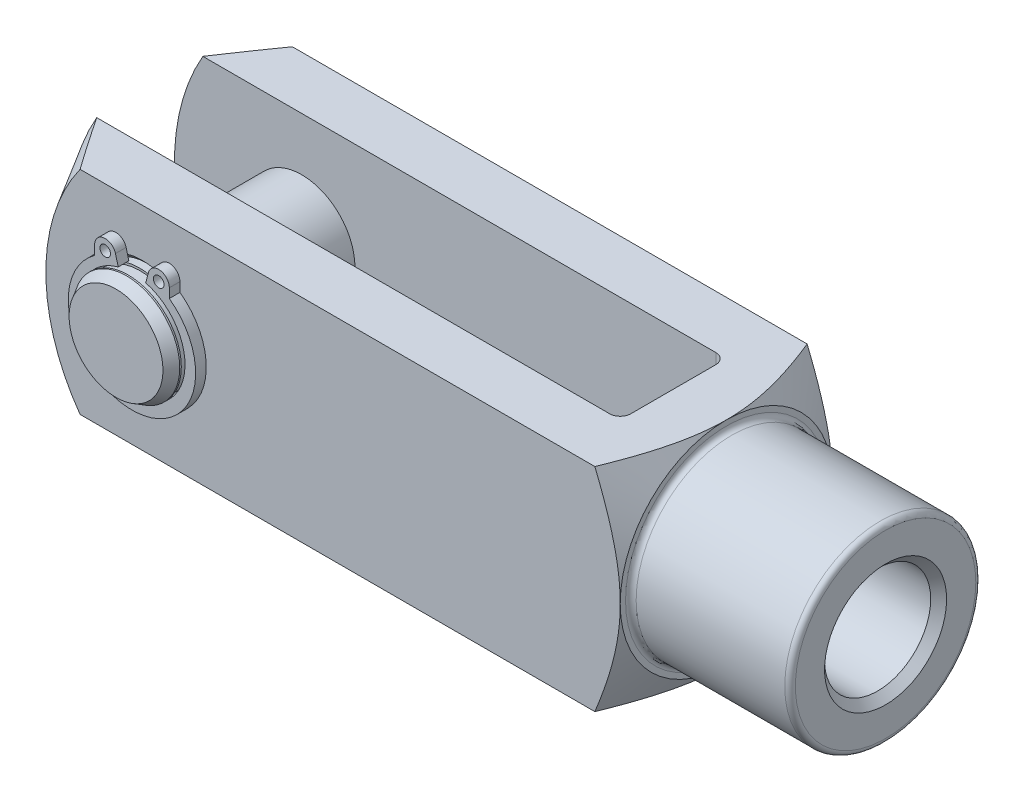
ISO-10303-21;
HEADER;
FILE_DESCRIPTION(('STEP AP214'),'2;1');
FILE_NAME('part.step','',(''),(''),'','','');
FILE_SCHEMA(('AUTOMOTIVE_DESIGN { 1 0 10303 214 1 1 1 1 }'));
ENDSEC;
DATA;
#1=APPLICATION_CONTEXT('core data for automotive mechanical design processes');
#2=APPLICATION_PROTOCOL_DEFINITION('international standard','automotive_design',2000,#1);
#3=PRODUCT_CONTEXT('',#1,'mechanical');
#4=PRODUCT('Part','Part','',(#3));
#5=PRODUCT_RELATED_PRODUCT_CATEGORY('part','',(#4));
#6=PRODUCT_DEFINITION_FORMATION('','',#4);
#7=PRODUCT_DEFINITION_CONTEXT('part definition',#1,'design');
#8=PRODUCT_DEFINITION('design','',#6,#7);
#9=PRODUCT_DEFINITION_SHAPE('','',#8);
#10=(LENGTH_UNIT() NAMED_UNIT(*) SI_UNIT(.MILLI.,.METRE.));
#11=(NAMED_UNIT(*) PLANE_ANGLE_UNIT() SI_UNIT($,.RADIAN.));
#12=(NAMED_UNIT(*) SI_UNIT($,.STERADIAN.) SOLID_ANGLE_UNIT());
#13=UNCERTAINTY_MEASURE_WITH_UNIT(LENGTH_MEASURE(1.E-05),#10,'distance_accuracy_value','');
#14=(GEOMETRIC_REPRESENTATION_CONTEXT(3) GLOBAL_UNCERTAINTY_ASSIGNED_CONTEXT((#13)) GLOBAL_UNIT_ASSIGNED_CONTEXT((#10,
#11,#12)) REPRESENTATION_CONTEXT('',''));
#15=CARTESIAN_POINT('',(0.,0.,0.));
#16=DIRECTION('',(0.,0.,1.));
#17=DIRECTION('',(1.,0.,0.));
#18=AXIS2_PLACEMENT_3D('',#15,#16,#17);
#19=CARTESIAN_POINT('',(-60.,0.,12.5));
#20=DIRECTION('',(0.,0.,-1.));
#21=DIRECTION('',(-1.,0.,0.));
#22=AXIS2_PLACEMENT_3D('',#19,#20,#21);
#23=CYLINDRICAL_SURFACE('',#22,5.);
#24=CARTESIAN_POINT('',(-60.,0.,10.25));
#25=DIRECTION('',(0.,0.,1.));
#26=DIRECTION('',(1.,0.,0.));
#27=AXIS2_PLACEMENT_3D('',#24,#25,#26);
#28=CIRCLE('',#27,5.);
#29=CARTESIAN_POINT('',(-55.,0.,10.25));
#30=VERTEX_POINT('',#29);
#31=EDGE_CURVE('P0_E55',#30,#30,#28,.T.);
#32=ORIENTED_EDGE('',*,*,#31,.F.);
#33=EDGE_LOOP('',(#32));
#34=FACE_BOUND('',#33,.T.);
#35=CARTESIAN_POINT('',(-60.,0.,-10.25));
#36=DIRECTION('',(0.,0.,1.));
#37=DIRECTION('',(1.,0.,0.));
#38=AXIS2_PLACEMENT_3D('',#35,#36,#37);
#39=CIRCLE('',#38,5.);
#40=CARTESIAN_POINT('',(-55.,0.,-10.25));
#41=VERTEX_POINT('',#40);
#42=EDGE_CURVE('P0_E40',#41,#41,#39,.T.);
#43=ORIENTED_EDGE('',*,*,#42,.T.);
#44=EDGE_LOOP('',(#43));
#45=FACE_BOUND('',#44,.T.);
#46=ADVANCED_FACE('P0_F14',(#34,#45),#23,.T.);
#47=CARTESIAN_POINT('',(-60.,0.,-11.35));
#48=DIRECTION('',(0.,0.,1.));
#49=DIRECTION('',(1.,0.,0.));
#50=AXIS2_PLACEMENT_3D('',#47,#48,#49);
#51=CIRCLE('',#50,5.);
#52=CARTESIAN_POINT('',(-55.,0.,-11.35));
#53=VERTEX_POINT('',#52);
#54=EDGE_CURVE('P0_E43',#53,#53,#51,.T.);
#55=ORIENTED_EDGE('',*,*,#54,.F.);
#56=EDGE_LOOP('',(#55));
#57=FACE_BOUND('',#56,.T.);
#58=CARTESIAN_POINT('',(-60.,0.,-11.5));
#59=DIRECTION('',(0.,0.,1.));
#60=DIRECTION('',(1.,0.,0.));
#61=AXIS2_PLACEMENT_3D('',#58,#59,#60);
#62=CIRCLE('',#61,5.);
#63=CARTESIAN_POINT('',(-55.,0.,-11.5));
#64=VERTEX_POINT('',#63);
#65=EDGE_CURVE('P0_E25',#64,#64,#62,.T.);
#66=ORIENTED_EDGE('',*,*,#65,.T.);
#67=EDGE_LOOP('',(#66));
#68=FACE_BOUND('',#67,.T.);
#69=ADVANCED_FACE('P0_F63',(#57,#68),#23,.T.);
#70=CARTESIAN_POINT('',(-60.,0.,-12.5));
#71=DIRECTION('',(0.,0.,1.));
#72=DIRECTION('',(1.,0.,0.));
#73=AXIS2_PLACEMENT_3D('',#70,#71,#72);
#74=PLANE('',#73);
#75=CARTESIAN_POINT('',(-60.,0.,-12.5));
#76=DIRECTION('',(0.,0.,1.));
#77=DIRECTION('',(1.,0.,0.));
#78=AXIS2_PLACEMENT_3D('',#75,#76,#77);
#79=CIRCLE('',#78,4.42264973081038);
#80=CARTESIAN_POINT('',(-55.5773502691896,0.,-12.5));
#81=VERTEX_POINT('',#80);
#82=EDGE_CURVE('P0_E21',#81,#81,#79,.F.);
#83=ORIENTED_EDGE('',*,*,#82,.T.);
#84=EDGE_LOOP('',(#83));
#85=FACE_BOUND('',#84,.T.);
#86=ADVANCED_FACE('P0_F89',(#85),#74,.F.);
#87=CARTESIAN_POINT('',(-60.,0.,-11.5));
#88=DIRECTION('',(0.,0.,1.));
#89=DIRECTION('',(1.,0.,0.));
#90=AXIS2_PLACEMENT_3D('',#87,#88,#89);
#91=CONICAL_SURFACE('',#90,5.,0.523598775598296);
#92=ORIENTED_EDGE('',*,*,#82,.F.);
#93=EDGE_LOOP('',(#92));
#94=FACE_BOUND('',#93,.T.);
#95=ORIENTED_EDGE('',*,*,#65,.F.);
#96=EDGE_LOOP('',(#95));
#97=FACE_BOUND('',#96,.T.);
#98=ADVANCED_FACE('P0_F83',(#94,#97),#91,.T.);
#99=CARTESIAN_POINT('',(-60.,5.,-11.35));
#100=DIRECTION('',(0.,0.,-1.));
#101=DIRECTION('',(-1.,0.,0.));
#102=AXIS2_PLACEMENT_3D('',#99,#100,#101);
#103=PLANE('',#102);
#104=CARTESIAN_POINT('',(-60.,0.,-11.35));
#105=DIRECTION('',(0.,0.,1.));
#106=DIRECTION('',(1.,0.,0.));
#107=AXIS2_PLACEMENT_3D('',#104,#105,#106);
#108=CIRCLE('',#107,4.8);
#109=CARTESIAN_POINT('',(-55.2,0.,-11.35));
#110=VERTEX_POINT('',#109);
#111=EDGE_CURVE('P0_E34',#110,#110,#108,.T.);
#112=ORIENTED_EDGE('',*,*,#111,.F.);
#113=EDGE_LOOP('',(#112));
#114=FACE_BOUND('',#113,.T.);
#115=ORIENTED_EDGE('',*,*,#54,.T.);
#116=EDGE_LOOP('',(#115));
#117=FACE_BOUND('',#116,.T.);
#118=ADVANCED_FACE('P0_F77',(#114,#117),#103,.F.);
#119=CARTESIAN_POINT('',(-60.,0.,11.5));
#120=DIRECTION('',(0.,0.,1.));
#121=DIRECTION('',(1.,0.,0.));
#122=AXIS2_PLACEMENT_3D('',#119,#120,#121);
#123=CYLINDRICAL_SURFACE('',#122,4.8);
#124=CARTESIAN_POINT('',(-60.,0.,-10.25));
#125=DIRECTION('',(0.,0.,1.));
#126=DIRECTION('',(1.,0.,0.));
#127=AXIS2_PLACEMENT_3D('',#124,#125,#126);
#128=CIRCLE('',#127,4.8);
#129=CARTESIAN_POINT('',(-55.2,0.,-10.25));
#130=VERTEX_POINT('',#129);
#131=EDGE_CURVE('P0_E37',#130,#130,#128,.T.);
#132=ORIENTED_EDGE('',*,*,#131,.F.);
#133=EDGE_LOOP('',(#132));
#134=FACE_BOUND('',#133,.T.);
#135=ORIENTED_EDGE('',*,*,#111,.T.);
#136=EDGE_LOOP('',(#135));
#137=FACE_BOUND('',#136,.T.);
#138=ADVANCED_FACE('P0_F71',(#134,#137),#123,.T.);
#139=CARTESIAN_POINT('',(-60.,5.,-10.25));
#140=DIRECTION('',(0.,0.,1.));
#141=DIRECTION('',(1.,0.,0.));
#142=AXIS2_PLACEMENT_3D('',#139,#140,#141);
#143=PLANE('',#142);
#144=ORIENTED_EDGE('',*,*,#42,.F.);
#145=EDGE_LOOP('',(#144));
#146=FACE_BOUND('',#145,.T.);
#147=ORIENTED_EDGE('',*,*,#131,.T.);
#148=EDGE_LOOP('',(#147));
#149=FACE_BOUND('',#148,.T.);
#150=ADVANCED_FACE('P0_F68',(#146,#149),#143,.F.);
#151=CARTESIAN_POINT('',(-60.,5.,10.25));
#152=DIRECTION('',(0.,0.,-1.));
#153=DIRECTION('',(-1.,0.,0.));
#154=AXIS2_PLACEMENT_3D('',#151,#152,#153);
#155=PLANE('',#154);
#156=CARTESIAN_POINT('',(-60.,0.,10.25));
#157=DIRECTION('',(0.,0.,1.));
#158=DIRECTION('',(1.,0.,0.));
#159=AXIS2_PLACEMENT_3D('',#156,#157,#158);
#160=CIRCLE('',#159,4.8);
#161=CARTESIAN_POINT('',(-55.2,0.,10.25));
#162=VERTEX_POINT('',#161);
#163=EDGE_CURVE('P0_E46',#162,#162,#160,.T.);
#164=ORIENTED_EDGE('',*,*,#163,.F.);
#165=EDGE_LOOP('',(#164));
#166=FACE_BOUND('',#165,.T.);
#167=ORIENTED_EDGE('',*,*,#31,.T.);
#168=EDGE_LOOP('',(#167));
#169=FACE_BOUND('',#168,.T.);
#170=ADVANCED_FACE('P0_F59',(#166,#169),#155,.F.);
#171=CARTESIAN_POINT('',(-60.,0.,11.5));
#172=DIRECTION('',(0.,0.,1.));
#173=DIRECTION('',(1.,0.,0.));
#174=AXIS2_PLACEMENT_3D('',#171,#172,#173);
#175=CYLINDRICAL_SURFACE('',#174,4.8);
#176=CARTESIAN_POINT('',(-60.,0.,11.35));
#177=DIRECTION('',(0.,0.,1.));
#178=DIRECTION('',(1.,0.,0.));
#179=AXIS2_PLACEMENT_3D('',#176,#177,#178);
#180=CIRCLE('',#179,4.8);
#181=CARTESIAN_POINT('',(-55.2,0.,11.35));
#182=VERTEX_POINT('',#181);
#183=EDGE_CURVE('P0_E49',#182,#182,#180,.T.);
#184=ORIENTED_EDGE('',*,*,#183,.F.);
#185=EDGE_LOOP('',(#184));
#186=FACE_BOUND('',#185,.T.);
#187=ORIENTED_EDGE('',*,*,#163,.T.);
#188=EDGE_LOOP('',(#187));
#189=FACE_BOUND('',#188,.T.);
#190=ADVANCED_FACE('P0_F108',(#186,#189),#175,.T.);
#191=CARTESIAN_POINT('',(-60.,5.,11.35));
#192=DIRECTION('',(0.,0.,1.));
#193=DIRECTION('',(1.,0.,0.));
#194=AXIS2_PLACEMENT_3D('',#191,#192,#193);
#195=PLANE('',#194);
#196=CARTESIAN_POINT('',(-60.,0.,11.35));
#197=DIRECTION('',(0.,0.,1.));
#198=DIRECTION('',(1.,0.,0.));
#199=AXIS2_PLACEMENT_3D('',#196,#197,#198);
#200=CIRCLE('',#199,5.);
#201=CARTESIAN_POINT('',(-55.,0.,11.35));
#202=VERTEX_POINT('',#201);
#203=EDGE_CURVE('P0_E52',#202,#202,#200,.T.);
#204=ORIENTED_EDGE('',*,*,#203,.F.);
#205=EDGE_LOOP('',(#204));
#206=FACE_BOUND('',#205,.T.);
#207=ORIENTED_EDGE('',*,*,#183,.T.);
#208=EDGE_LOOP('',(#207));
#209=FACE_BOUND('',#208,.T.);
#210=ADVANCED_FACE('P0_F104',(#206,#209),#195,.F.);
#211=CARTESIAN_POINT('',(-60.,0.,12.5));
#212=DIRECTION('',(0.,0.,1.));
#213=DIRECTION('',(1.,0.,0.));
#214=AXIS2_PLACEMENT_3D('',#211,#212,#213);
#215=PLANE('',#214);
#216=CARTESIAN_POINT('',(-60.,0.,12.5));
#217=DIRECTION('',(0.,0.,1.));
#218=DIRECTION('',(1.,0.,0.));
#219=AXIS2_PLACEMENT_3D('',#216,#217,#218);
#220=CIRCLE('',#219,4.42264973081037);
#221=CARTESIAN_POINT('',(-55.5773502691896,0.,12.5));
#222=VERTEX_POINT('',#221);
#223=EDGE_CURVE('P0_E10',#222,#222,#220,.T.);
#224=ORIENTED_EDGE('',*,*,#223,.T.);
#225=EDGE_LOOP('',(#224));
#226=FACE_BOUND('',#225,.T.);
#227=ADVANCED_FACE('P0_F102',(#226),#215,.T.);
#228=CARTESIAN_POINT('',(-60.,0.,12.5));
#229=DIRECTION('',(0.,0.,-1.));
#230=DIRECTION('',(-1.,0.,0.));
#231=AXIS2_PLACEMENT_3D('',#228,#229,#230);
#232=CONICAL_SURFACE('',#231,4.42264973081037,0.523598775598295);
#233=CARTESIAN_POINT('',(-60.,0.,11.5));
#234=DIRECTION('',(0.,0.,1.));
#235=DIRECTION('',(1.,0.,0.));
#236=AXIS2_PLACEMENT_3D('',#233,#234,#235);
#237=CIRCLE('',#236,5.);
#238=CARTESIAN_POINT('',(-55.,0.,11.5));
#239=VERTEX_POINT('',#238);
#240=EDGE_CURVE('P0_E29',#239,#239,#237,.F.);
#241=ORIENTED_EDGE('',*,*,#240,.F.);
#242=EDGE_LOOP('',(#241));
#243=FACE_BOUND('',#242,.T.);
#244=ORIENTED_EDGE('',*,*,#223,.F.);
#245=EDGE_LOOP('',(#244));
#246=FACE_BOUND('',#245,.T.);
#247=ADVANCED_FACE('P0_F16',(#243,#246),#232,.T.);
#248=ORIENTED_EDGE('',*,*,#203,.T.);
#249=EDGE_LOOP('',(#248));
#250=FACE_BOUND('',#249,.T.);
#251=ORIENTED_EDGE('',*,*,#240,.T.);
#252=EDGE_LOOP('',(#251));
#253=FACE_BOUND('',#252,.T.);
#254=ADVANCED_FACE('P0_F65',(#250,#253),#23,.T.);
#255=CLOSED_SHELL('',(#46,#69,#86,#98,#118,#138,#150,#170,#190,#210,#227,#247,#254));
#256=MANIFOLD_SOLID_BREP('P0_B1',#255);
#257=CARTESIAN_POINT('',(-60.,0.,10.9999999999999));
#258=DIRECTION('',(0.,0.,1.));
#259=DIRECTION('',(1.,0.,0.));
#260=AXIS2_PLACEMENT_3D('',#257,#258,#259);
#261=PLANE('',#260);
#262=CARTESIAN_POINT('',(-62.5188400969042,5.5367359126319,10.9999999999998));
#263=DIRECTION('',(0.,0.,1.));
#264=DIRECTION('',(1.,0.,0.));
#265=AXIS2_PLACEMENT_3D('',#262,#263,#264);
#266=CIRCLE('',#265,0.5);
#267=CARTESIAN_POINT('',(-62.0188400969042,5.5367359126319,10.9999999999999));
#268=VERTEX_POINT('',#267);
#269=EDGE_CURVE('P1_E117',#268,#268,#266,.T.);
#270=ORIENTED_EDGE('',*,*,#269,.F.);
#271=EDGE_LOOP('',(#270));
#272=FACE_BOUND('',#271,.T.);
#273=CARTESIAN_POINT('',(-60.,0.,10.9999999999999));
#274=DIRECTION('',(0.,0.,-1.));
#275=DIRECTION('',(1.,0.,0.));
#276=AXIS2_PLACEMENT_3D('',#273,#274,#275);
#277=CIRCLE('',#276,5.);
#278=CARTESIAN_POINT('',(-58.7059047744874,4.82962913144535,10.9999999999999));
#279=VERTEX_POINT('',#278);
#280=CARTESIAN_POINT('',(-61.2940952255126,4.82962913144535,10.9999999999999));
#281=VERTEX_POINT('',#280);
#282=EDGE_CURVE('P1_E128',#279,#281,#277,.T.);
#283=ORIENTED_EDGE('',*,*,#282,.T.);
#284=DIRECTION('',(-0.258819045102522,0.965925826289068,0.));
#285=VECTOR('',#284,1.);
#286=CARTESIAN_POINT('',(-61.2940952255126,4.82962913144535,10.9999999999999));
#287=LINE('',#286,#285);
#288=CARTESIAN_POINT('',(-61.5529142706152,5.79555495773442,10.9999999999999));
#289=VERTEX_POINT('',#288);
#290=EDGE_CURVE('P1_E76',#281,#289,#287,.T.);
#291=ORIENTED_EDGE('',*,*,#290,.T.);
#292=CARTESIAN_POINT('',(-62.5188400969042,5.5367359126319,10.9999999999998));
#293=DIRECTION('',(0.,0.,1.));
#294=DIRECTION('',(1.,0.,0.));
#295=AXIS2_PLACEMENT_3D('',#292,#293,#294);
#296=CIRCLE('',#295,0.999999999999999);
#297=CARTESIAN_POINT('',(-63.5188400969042,5.5367359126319,10.9999999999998));
#298=VERTEX_POINT('',#297);
#299=EDGE_CURVE('P1_E143',#289,#298,#296,.T.);
#300=ORIENTED_EDGE('',*,*,#299,.T.);
#301=DIRECTION('',(0.,-1.,0.));
#302=VECTOR('',#301,1.);
#303=CARTESIAN_POINT('',(-63.5188400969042,5.5367359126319,10.9999999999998));
#304=LINE('',#303,#302);
#305=CARTESIAN_POINT('',(-63.5188400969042,4.65981114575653,10.9999999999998));
#306=VERTEX_POINT('',#305);
#307=EDGE_CURVE('P1_E156',#298,#306,#304,.T.);
#308=ORIENTED_EDGE('',*,*,#307,.T.);
#309=CARTESIAN_POINT('',(-60.,-0.199999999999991,10.9999999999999));
#310=DIRECTION('',(0.,0.,1.));
#311=DIRECTION('',(1.,0.,0.));
#312=AXIS2_PLACEMENT_3D('',#309,#310,#311);
#313=CIRCLE('',#312,6.);
#314=CARTESIAN_POINT('',(-56.4811599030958,4.65981114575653,10.9999999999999));
#315=VERTEX_POINT('',#314);
#316=EDGE_CURVE('P1_E95',#306,#315,#313,.T.);
#317=ORIENTED_EDGE('',*,*,#316,.T.);
#318=DIRECTION('',(0.,1.,0.));
#319=VECTOR('',#318,1.);
#320=CARTESIAN_POINT('',(-56.4811599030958,5.5367359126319,10.9999999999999));
#321=LINE('',#320,#319);
#322=CARTESIAN_POINT('',(-56.4811599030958,5.5367359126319,10.9999999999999));
#323=VERTEX_POINT('',#322);
#324=EDGE_CURVE('P1_E89',#315,#323,#321,.T.);
#325=ORIENTED_EDGE('',*,*,#324,.T.);
#326=CARTESIAN_POINT('',(-57.4811599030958,5.5367359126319,10.9999999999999));
#327=DIRECTION('',(0.,0.,1.));
#328=DIRECTION('',(-1.,0.,0.));
#329=AXIS2_PLACEMENT_3D('',#326,#327,#328);
#330=CIRCLE('',#329,0.999999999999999);
#331=CARTESIAN_POINT('',(-58.4470857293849,5.79555495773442,10.9999999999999));
#332=VERTEX_POINT('',#331);
#333=EDGE_CURVE('P1_E93',#323,#332,#330,.T.);
#334=ORIENTED_EDGE('',*,*,#333,.T.);
#335=DIRECTION('',(-0.258819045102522,-0.965925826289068,0.));
#336=VECTOR('',#335,1.);
#337=CARTESIAN_POINT('',(-58.7059047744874,4.82962913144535,10.9999999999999));
#338=LINE('',#337,#336);
#339=EDGE_CURVE('P1_E33',#332,#279,#338,.T.);
#340=ORIENTED_EDGE('',*,*,#339,.T.);
#341=EDGE_LOOP('',(#283,#291,#300,#308,#317,#325,#334,#340));
#342=FACE_BOUND('',#341,.T.);
#343=CARTESIAN_POINT('',(-57.4811599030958,5.5367359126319,10.9999999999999));
#344=DIRECTION('',(0.,0.,1.));
#345=DIRECTION('',(-1.,0.,0.));
#346=AXIS2_PLACEMENT_3D('',#343,#344,#345);
#347=CIRCLE('',#346,0.5);
#348=CARTESIAN_POINT('',(-57.9811599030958,5.5367359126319,10.9999999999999));
#349=VERTEX_POINT('',#348);
#350=EDGE_CURVE('P1_E165',#349,#349,#347,.T.);
#351=ORIENTED_EDGE('',*,*,#350,.F.);
#352=EDGE_LOOP('',(#351));
#353=FACE_BOUND('',#352,.T.);
#354=ADVANCED_FACE('P1_F16',(#272,#342,#353),#261,.T.);
#355=CARTESIAN_POINT('',(-60.,0.,9.99999999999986));
#356=DIRECTION('',(0.,0.,1.));
#357=DIRECTION('',(1.,0.,0.));
#358=AXIS2_PLACEMENT_3D('',#355,#356,#357);
#359=PLANE('',#358);
#360=CARTESIAN_POINT('',(-62.5188400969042,5.5367359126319,9.99999999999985));
#361=DIRECTION('',(0.,0.,1.));
#362=DIRECTION('',(1.,0.,0.));
#363=AXIS2_PLACEMENT_3D('',#360,#361,#362);
#364=CIRCLE('',#363,0.5);
#365=CARTESIAN_POINT('',(-62.0188400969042,5.5367359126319,9.99999999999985));
#366=VERTEX_POINT('',#365);
#367=EDGE_CURVE('P1_E162',#366,#366,#364,.T.);
#368=ORIENTED_EDGE('',*,*,#367,.T.);
#369=EDGE_LOOP('',(#368));
#370=FACE_BOUND('',#369,.T.);
#371=CARTESIAN_POINT('',(-60.,0.,9.99999999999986));
#372=DIRECTION('',(0.,0.,-1.));
#373=DIRECTION('',(1.,0.,0.));
#374=AXIS2_PLACEMENT_3D('',#371,#372,#373);
#375=CIRCLE('',#374,5.);
#376=CARTESIAN_POINT('',(-58.7059047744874,4.82962913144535,9.99999999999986));
#377=VERTEX_POINT('',#376);
#378=CARTESIAN_POINT('',(-61.2940952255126,4.82962913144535,9.99999999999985));
#379=VERTEX_POINT('',#378);
#380=EDGE_CURVE('P1_E113',#377,#379,#375,.T.);
#381=ORIENTED_EDGE('',*,*,#380,.F.);
#382=DIRECTION('',(-0.258819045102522,-0.965925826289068,0.));
#383=VECTOR('',#382,1.);
#384=CARTESIAN_POINT('',(-58.7059047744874,4.82962913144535,9.99999999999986));
#385=LINE('',#384,#383);
#386=CARTESIAN_POINT('',(-58.4470857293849,5.79555495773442,9.99999999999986));
#387=VERTEX_POINT('',#386);
#388=EDGE_CURVE('P1_E68',#387,#377,#385,.T.);
#389=ORIENTED_EDGE('',*,*,#388,.F.);
#390=CARTESIAN_POINT('',(-57.4811599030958,5.5367359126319,9.99999999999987));
#391=DIRECTION('',(0.,0.,1.));
#392=DIRECTION('',(-1.,0.,0.));
#393=AXIS2_PLACEMENT_3D('',#390,#391,#392);
#394=CIRCLE('',#393,0.999999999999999);
#395=CARTESIAN_POINT('',(-56.4811599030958,5.5367359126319,9.99999999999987));
#396=VERTEX_POINT('',#395);
#397=EDGE_CURVE('P1_E62',#396,#387,#394,.T.);
#398=ORIENTED_EDGE('',*,*,#397,.F.);
#399=DIRECTION('',(0.,1.,0.));
#400=VECTOR('',#399,1.);
#401=CARTESIAN_POINT('',(-56.4811599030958,5.5367359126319,9.99999999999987));
#402=LINE('',#401,#400);
#403=CARTESIAN_POINT('',(-56.4811599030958,4.65981114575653,9.99999999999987));
#404=VERTEX_POINT('',#403);
#405=EDGE_CURVE('P1_E103',#404,#396,#402,.T.);
#406=ORIENTED_EDGE('',*,*,#405,.F.);
#407=CARTESIAN_POINT('',(-60.,-0.199999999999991,9.99999999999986));
#408=DIRECTION('',(0.,0.,1.));
#409=DIRECTION('',(1.,0.,0.));
#410=AXIS2_PLACEMENT_3D('',#407,#408,#409);
#411=CIRCLE('',#410,6.);
#412=CARTESIAN_POINT('',(-63.5188400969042,4.65981114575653,9.99999999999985));
#413=VERTEX_POINT('',#412);
#414=EDGE_CURVE('P1_E123',#413,#404,#411,.T.);
#415=ORIENTED_EDGE('',*,*,#414,.F.);
#416=DIRECTION('',(0.,-1.,0.));
#417=VECTOR('',#416,1.);
#418=CARTESIAN_POINT('',(-63.5188400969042,5.5367359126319,9.99999999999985));
#419=LINE('',#418,#417);
#420=CARTESIAN_POINT('',(-63.5188400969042,5.5367359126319,9.99999999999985));
#421=VERTEX_POINT('',#420);
#422=EDGE_CURVE('P1_E121',#421,#413,#419,.T.);
#423=ORIENTED_EDGE('',*,*,#422,.F.);
#424=CARTESIAN_POINT('',(-62.5188400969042,5.5367359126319,9.99999999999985));
#425=DIRECTION('',(0.,0.,1.));
#426=DIRECTION('',(1.,0.,0.));
#427=AXIS2_PLACEMENT_3D('',#424,#425,#426);
#428=CIRCLE('',#427,0.999999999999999);
#429=CARTESIAN_POINT('',(-61.5529142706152,5.79555495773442,9.99999999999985));
#430=VERTEX_POINT('',#429);
#431=EDGE_CURVE('P1_E119',#430,#421,#428,.T.);
#432=ORIENTED_EDGE('',*,*,#431,.F.);
#433=DIRECTION('',(-0.258819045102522,0.965925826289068,0.));
#434=VECTOR('',#433,1.);
#435=CARTESIAN_POINT('',(-61.2940952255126,4.82962913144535,9.99999999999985));
#436=LINE('',#435,#434);
#437=EDGE_CURVE('P1_E116',#379,#430,#436,.T.);
#438=ORIENTED_EDGE('',*,*,#437,.F.);
#439=EDGE_LOOP('',(#381,#389,#398,#406,#415,#423,#432,#438));
#440=FACE_BOUND('',#439,.T.);
#441=CARTESIAN_POINT('',(-57.4811599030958,5.5367359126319,9.99999999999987));
#442=DIRECTION('',(0.,0.,1.));
#443=DIRECTION('',(-1.,0.,0.));
#444=AXIS2_PLACEMENT_3D('',#441,#442,#443);
#445=CIRCLE('',#444,0.5);
#446=CARTESIAN_POINT('',(-57.9811599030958,5.5367359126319,9.99999999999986));
#447=VERTEX_POINT('',#446);
#448=EDGE_CURVE('P1_E168',#447,#447,#445,.T.);
#449=ORIENTED_EDGE('',*,*,#448,.T.);
#450=EDGE_LOOP('',(#449));
#451=FACE_BOUND('',#450,.T.);
#452=ADVANCED_FACE('P1_F147',(#370,#440,#451),#359,.F.);
#453=CARTESIAN_POINT('',(-60.,0.,10.9999999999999));
#454=DIRECTION('',(0.,0.,-1.));
#455=DIRECTION('',(-1.,0.,0.));
#456=AXIS2_PLACEMENT_3D('',#453,#454,#455);
#457=CYLINDRICAL_SURFACE('',#456,5.);
#458=ORIENTED_EDGE('',*,*,#380,.T.);
#459=DIRECTION('',(0.,0.,-1.));
#460=VECTOR('',#459,1.);
#461=CARTESIAN_POINT('',(-61.2940952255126,4.82962913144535,10.9999999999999));
#462=LINE('',#461,#460);
#463=EDGE_CURVE('P1_E11',#281,#379,#462,.T.);
#464=ORIENTED_EDGE('',*,*,#463,.F.);
#465=ORIENTED_EDGE('',*,*,#282,.F.);
#466=DIRECTION('',(0.,0.,-1.));
#467=VECTOR('',#466,1.);
#468=CARTESIAN_POINT('',(-58.7059047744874,4.82962913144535,10.9999999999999));
#469=LINE('',#468,#467);
#470=EDGE_CURVE('P1_E109',#279,#377,#469,.T.);
#471=ORIENTED_EDGE('',*,*,#470,.T.);
#472=EDGE_LOOP('',(#458,#464,#465,#471));
#473=FACE_BOUND('',#472,.T.);
#474=ADVANCED_FACE('P1_F18',(#473),#457,.F.);
#475=CARTESIAN_POINT('',(-61.2940952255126,4.82962913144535,10.9999999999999));
#476=DIRECTION('',(-0.965925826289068,-0.258819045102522,0.));
#477=DIRECTION('',(0.258819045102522,-0.965925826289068,0.));
#478=AXIS2_PLACEMENT_3D('',#475,#476,#477);
#479=PLANE('',#478);
#480=ORIENTED_EDGE('',*,*,#437,.T.);
#481=DIRECTION('',(0.,0.,-1.));
#482=VECTOR('',#481,1.);
#483=CARTESIAN_POINT('',(-61.5529142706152,5.79555495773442,10.9999999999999));
#484=LINE('',#483,#482);
#485=EDGE_CURVE('P1_E25',#289,#430,#484,.T.);
#486=ORIENTED_EDGE('',*,*,#485,.F.);
#487=ORIENTED_EDGE('',*,*,#290,.F.);
#488=ORIENTED_EDGE('',*,*,#463,.T.);
#489=EDGE_LOOP('',(#480,#486,#487,#488));
#490=FACE_BOUND('',#489,.T.);
#491=ADVANCED_FACE('P1_F202',(#490),#479,.F.);
#492=CARTESIAN_POINT('',(-62.5188400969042,5.5367359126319,10.9999999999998));
#493=DIRECTION('',(0.,0.,-1.));
#494=DIRECTION('',(-1.,0.,0.));
#495=AXIS2_PLACEMENT_3D('',#492,#493,#494);
#496=CYLINDRICAL_SURFACE('',#495,0.999999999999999);
#497=ORIENTED_EDGE('',*,*,#431,.T.);
#498=DIRECTION('',(0.,0.,-1.));
#499=VECTOR('',#498,1.);
#500=CARTESIAN_POINT('',(-63.5188400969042,5.5367359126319,10.9999999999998));
#501=LINE('',#500,#499);
#502=EDGE_CURVE('P1_E135',#298,#421,#501,.T.);
#503=ORIENTED_EDGE('',*,*,#502,.F.);
#504=ORIENTED_EDGE('',*,*,#299,.F.);
#505=ORIENTED_EDGE('',*,*,#485,.T.);
#506=EDGE_LOOP('',(#497,#503,#504,#505));
#507=FACE_BOUND('',#506,.T.);
#508=ADVANCED_FACE('P1_F141',(#507),#496,.T.);
#509=CARTESIAN_POINT('',(-63.5188400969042,5.5367359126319,10.9999999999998));
#510=DIRECTION('',(1.,0.,0.));
#511=DIRECTION('',(0.,1.,0.));
#512=AXIS2_PLACEMENT_3D('',#509,#510,#511);
#513=PLANE('',#512);
#514=ORIENTED_EDGE('',*,*,#422,.T.);
#515=DIRECTION('',(0.,0.,-1.));
#516=VECTOR('',#515,1.);
#517=CARTESIAN_POINT('',(-63.5188400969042,4.65981114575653,10.9999999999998));
#518=LINE('',#517,#516);
#519=EDGE_CURVE('P1_E132',#306,#413,#518,.T.);
#520=ORIENTED_EDGE('',*,*,#519,.F.);
#521=ORIENTED_EDGE('',*,*,#307,.F.);
#522=ORIENTED_EDGE('',*,*,#502,.T.);
#523=EDGE_LOOP('',(#514,#520,#521,#522));
#524=FACE_BOUND('',#523,.T.);
#525=ADVANCED_FACE('P1_F152',(#524),#513,.F.);
#526=CARTESIAN_POINT('',(-60.,-0.199999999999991,10.9999999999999));
#527=DIRECTION('',(0.,0.,-1.));
#528=DIRECTION('',(-1.,0.,0.));
#529=AXIS2_PLACEMENT_3D('',#526,#527,#528);
#530=CYLINDRICAL_SURFACE('',#529,6.);
#531=ORIENTED_EDGE('',*,*,#414,.T.);
#532=DIRECTION('',(0.,0.,-1.));
#533=VECTOR('',#532,1.);
#534=CARTESIAN_POINT('',(-56.4811599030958,4.65981114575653,10.9999999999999));
#535=LINE('',#534,#533);
#536=EDGE_CURVE('P1_E104',#315,#404,#535,.T.);
#537=ORIENTED_EDGE('',*,*,#536,.F.);
#538=ORIENTED_EDGE('',*,*,#316,.F.);
#539=ORIENTED_EDGE('',*,*,#519,.T.);
#540=EDGE_LOOP('',(#531,#537,#538,#539));
#541=FACE_BOUND('',#540,.T.);
#542=ADVANCED_FACE('P1_F155',(#541),#530,.T.);
#543=CARTESIAN_POINT('',(-56.4811599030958,5.5367359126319,10.9999999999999));
#544=DIRECTION('',(-1.,0.,0.));
#545=DIRECTION('',(0.,-1.,0.));
#546=AXIS2_PLACEMENT_3D('',#543,#544,#545);
#547=PLANE('',#546);
#548=ORIENTED_EDGE('',*,*,#405,.T.);
#549=DIRECTION('',(0.,0.,-1.));
#550=VECTOR('',#549,1.);
#551=CARTESIAN_POINT('',(-56.4811599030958,5.5367359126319,10.9999999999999));
#552=LINE('',#551,#550);
#553=EDGE_CURVE('P1_E100',#323,#396,#552,.T.);
#554=ORIENTED_EDGE('',*,*,#553,.F.);
#555=ORIENTED_EDGE('',*,*,#324,.F.);
#556=ORIENTED_EDGE('',*,*,#536,.T.);
#557=EDGE_LOOP('',(#548,#554,#555,#556));
#558=FACE_BOUND('',#557,.T.);
#559=ADVANCED_FACE('P1_F101',(#558),#547,.F.);
#560=CARTESIAN_POINT('',(-57.4811599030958,5.5367359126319,10.9999999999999));
#561=DIRECTION('',(0.,0.,-1.));
#562=DIRECTION('',(-1.,0.,0.));
#563=AXIS2_PLACEMENT_3D('',#560,#561,#562);
#564=CYLINDRICAL_SURFACE('',#563,0.999999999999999);
#565=ORIENTED_EDGE('',*,*,#397,.T.);
#566=DIRECTION('',(0.,0.,-1.));
#567=VECTOR('',#566,1.);
#568=CARTESIAN_POINT('',(-58.4470857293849,5.79555495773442,10.9999999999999));
#569=LINE('',#568,#567);
#570=EDGE_CURVE('P1_E105',#332,#387,#569,.T.);
#571=ORIENTED_EDGE('',*,*,#570,.F.);
#572=ORIENTED_EDGE('',*,*,#333,.F.);
#573=ORIENTED_EDGE('',*,*,#553,.T.);
#574=EDGE_LOOP('',(#565,#571,#572,#573));
#575=FACE_BOUND('',#574,.T.);
#576=ADVANCED_FACE('P1_F107',(#575),#564,.T.);
#577=CARTESIAN_POINT('',(-58.7059047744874,4.82962913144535,10.9999999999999));
#578=DIRECTION('',(0.965925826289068,-0.258819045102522,0.));
#579=DIRECTION('',(0.258819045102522,0.965925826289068,0.));
#580=AXIS2_PLACEMENT_3D('',#577,#578,#579);
#581=PLANE('',#580);
#582=ORIENTED_EDGE('',*,*,#388,.T.);
#583=ORIENTED_EDGE('',*,*,#470,.F.);
#584=ORIENTED_EDGE('',*,*,#339,.F.);
#585=ORIENTED_EDGE('',*,*,#570,.T.);
#586=EDGE_LOOP('',(#582,#583,#584,#585));
#587=FACE_BOUND('',#586,.T.);
#588=ADVANCED_FACE('P1_F190',(#587),#581,.F.);
#589=CARTESIAN_POINT('',(-62.5188400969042,5.5367359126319,10.9999999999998));
#590=DIRECTION('',(0.,0.,-1.));
#591=DIRECTION('',(-1.,0.,0.));
#592=AXIS2_PLACEMENT_3D('',#589,#590,#591);
#593=CYLINDRICAL_SURFACE('',#592,0.5);
#594=ORIENTED_EDGE('',*,*,#269,.T.);
#595=EDGE_LOOP('',(#594));
#596=FACE_BOUND('',#595,.T.);
#597=ORIENTED_EDGE('',*,*,#367,.F.);
#598=EDGE_LOOP('',(#597));
#599=FACE_BOUND('',#598,.T.);
#600=ADVANCED_FACE('P1_F187',(#596,#599),#593,.F.);
#601=CARTESIAN_POINT('',(-57.4811599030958,5.5367359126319,10.9999999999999));
#602=DIRECTION('',(0.,0.,-1.));
#603=DIRECTION('',(-1.,0.,0.));
#604=AXIS2_PLACEMENT_3D('',#601,#602,#603);
#605=CYLINDRICAL_SURFACE('',#604,0.5);
#606=ORIENTED_EDGE('',*,*,#350,.T.);
#607=EDGE_LOOP('',(#606));
#608=FACE_BOUND('',#607,.T.);
#609=ORIENTED_EDGE('',*,*,#448,.F.);
#610=EDGE_LOOP('',(#609));
#611=FACE_BOUND('',#610,.T.);
#612=ADVANCED_FACE('P1_F174',(#608,#611),#605,.F.);
#613=CLOSED_SHELL('',(#354,#452,#474,#491,#508,#525,#542,#559,#576,#588,#600,#612));
#614=MANIFOLD_SOLID_BREP('P1_B1',#613);
#615=CARTESIAN_POINT('',(-60.,0.,-10.9999999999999));
#616=DIRECTION('',(0.,0.,-1.));
#617=DIRECTION('',(-1.,0.,0.));
#618=AXIS2_PLACEMENT_3D('',#615,#616,#617);
#619=PLANE('',#618);
#620=CARTESIAN_POINT('',(-57.4811599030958,5.53673591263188,-10.9999999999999));
#621=DIRECTION('',(0.,0.,-1.));
#622=DIRECTION('',(-1.,0.,0.));
#623=AXIS2_PLACEMENT_3D('',#620,#621,#622);
#624=CIRCLE('',#623,0.5);
#625=CARTESIAN_POINT('',(-57.9811599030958,5.53673591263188,-10.9999999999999));
#626=VERTEX_POINT('',#625);
#627=EDGE_CURVE('P2_E117',#626,#626,#624,.T.);
#628=ORIENTED_EDGE('',*,*,#627,.F.);
#629=EDGE_LOOP('',(#628));
#630=FACE_BOUND('',#629,.T.);
#631=CARTESIAN_POINT('',(-60.,0.,-10.9999999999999));
#632=DIRECTION('',(0.,0.,1.));
#633=DIRECTION('',(-1.,0.,0.));
#634=AXIS2_PLACEMENT_3D('',#631,#632,#633);
#635=CIRCLE('',#634,5.);
#636=CARTESIAN_POINT('',(-61.2940952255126,4.82962913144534,-10.9999999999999));
#637=VERTEX_POINT('',#636);
#638=CARTESIAN_POINT('',(-58.7059047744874,4.82962913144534,-10.9999999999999));
#639=VERTEX_POINT('',#638);
#640=EDGE_CURVE('P2_E128',#637,#639,#635,.T.);
#641=ORIENTED_EDGE('',*,*,#640,.T.);
#642=DIRECTION('',(0.258819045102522,0.965925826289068,0.));
#643=VECTOR('',#642,1.);
#644=CARTESIAN_POINT('',(-58.7059047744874,4.82962913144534,-10.9999999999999));
#645=LINE('',#644,#643);
#646=CARTESIAN_POINT('',(-58.4470857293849,5.7955549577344,-10.9999999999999));
#647=VERTEX_POINT('',#646);
#648=EDGE_CURVE('P2_E76',#639,#647,#645,.T.);
#649=ORIENTED_EDGE('',*,*,#648,.T.);
#650=CARTESIAN_POINT('',(-57.4811599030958,5.53673591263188,-10.9999999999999));
#651=DIRECTION('',(0.,0.,-1.));
#652=DIRECTION('',(-1.,0.,0.));
#653=AXIS2_PLACEMENT_3D('',#650,#651,#652);
#654=CIRCLE('',#653,0.999999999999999);
#655=CARTESIAN_POINT('',(-56.4811599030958,5.53673591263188,-10.9999999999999));
#656=VERTEX_POINT('',#655);
#657=EDGE_CURVE('P2_E143',#647,#656,#654,.T.);
#658=ORIENTED_EDGE('',*,*,#657,.T.);
#659=DIRECTION('',(0.,-1.,0.));
#660=VECTOR('',#659,1.);
#661=CARTESIAN_POINT('',(-56.4811599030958,5.53673591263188,-10.9999999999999));
#662=LINE('',#661,#660);
#663=CARTESIAN_POINT('',(-56.4811599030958,4.65981114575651,-10.9999999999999));
#664=VERTEX_POINT('',#663);
#665=EDGE_CURVE('P2_E156',#656,#664,#662,.T.);
#666=ORIENTED_EDGE('',*,*,#665,.T.);
#667=CARTESIAN_POINT('',(-60.,-0.200000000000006,-10.9999999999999));
#668=DIRECTION('',(0.,0.,-1.));
#669=DIRECTION('',(-1.,0.,0.));
#670=AXIS2_PLACEMENT_3D('',#667,#668,#669);
#671=CIRCLE('',#670,6.);
#672=CARTESIAN_POINT('',(-63.5188400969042,4.65981114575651,-10.9999999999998));
#673=VERTEX_POINT('',#672);
#674=EDGE_CURVE('P2_E95',#664,#673,#671,.T.);
#675=ORIENTED_EDGE('',*,*,#674,.T.);
#676=DIRECTION('',(0.,1.,0.));
#677=VECTOR('',#676,1.);
#678=CARTESIAN_POINT('',(-63.5188400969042,5.53673591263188,-10.9999999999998));
#679=LINE('',#678,#677);
#680=CARTESIAN_POINT('',(-63.5188400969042,5.53673591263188,-10.9999999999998));
#681=VERTEX_POINT('',#680);
#682=EDGE_CURVE('P2_E89',#673,#681,#679,.T.);
#683=ORIENTED_EDGE('',*,*,#682,.T.);
#684=CARTESIAN_POINT('',(-62.5188400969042,5.53673591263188,-10.9999999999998));
#685=DIRECTION('',(0.,0.,-1.));
#686=DIRECTION('',(1.,0.,0.));
#687=AXIS2_PLACEMENT_3D('',#684,#685,#686);
#688=CIRCLE('',#687,0.999999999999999);
#689=CARTESIAN_POINT('',(-61.5529142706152,5.7955549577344,-10.9999999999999));
#690=VERTEX_POINT('',#689);
#691=EDGE_CURVE('P2_E93',#681,#690,#688,.T.);
#692=ORIENTED_EDGE('',*,*,#691,.T.);
#693=DIRECTION('',(0.258819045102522,-0.965925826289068,0.));
#694=VECTOR('',#693,1.);
#695=CARTESIAN_POINT('',(-61.2940952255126,4.82962913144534,-10.9999999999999));
#696=LINE('',#695,#694);
#697=EDGE_CURVE('P2_E33',#690,#637,#696,.T.);
#698=ORIENTED_EDGE('',*,*,#697,.T.);
#699=EDGE_LOOP('',(#641,#649,#658,#666,#675,#683,#692,#698));
#700=FACE_BOUND('',#699,.T.);
#701=CARTESIAN_POINT('',(-62.5188400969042,5.53673591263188,-10.9999999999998));
#702=DIRECTION('',(0.,0.,-1.));
#703=DIRECTION('',(1.,0.,0.));
#704=AXIS2_PLACEMENT_3D('',#701,#702,#703);
#705=CIRCLE('',#704,0.5);
#706=CARTESIAN_POINT('',(-62.0188400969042,5.53673591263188,-10.9999999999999));
#707=VERTEX_POINT('',#706);
#708=EDGE_CURVE('P2_E165',#707,#707,#705,.T.);
#709=ORIENTED_EDGE('',*,*,#708,.F.);
#710=EDGE_LOOP('',(#709));
#711=FACE_BOUND('',#710,.T.);
#712=ADVANCED_FACE('P2_F16',(#630,#700,#711),#619,.T.);
#713=CARTESIAN_POINT('',(-60.,0.,-9.99999999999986));
#714=DIRECTION('',(0.,0.,-1.));
#715=DIRECTION('',(-1.,0.,0.));
#716=AXIS2_PLACEMENT_3D('',#713,#714,#715);
#717=PLANE('',#716);
#718=CARTESIAN_POINT('',(-57.4811599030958,5.53673591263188,-9.99999999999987));
#719=DIRECTION('',(0.,0.,-1.));
#720=DIRECTION('',(-1.,0.,0.));
#721=AXIS2_PLACEMENT_3D('',#718,#719,#720);
#722=CIRCLE('',#721,0.5);
#723=CARTESIAN_POINT('',(-57.9811599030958,5.53673591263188,-9.99999999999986));
#724=VERTEX_POINT('',#723);
#725=EDGE_CURVE('P2_E162',#724,#724,#722,.T.);
#726=ORIENTED_EDGE('',*,*,#725,.T.);
#727=EDGE_LOOP('',(#726));
#728=FACE_BOUND('',#727,.T.);
#729=CARTESIAN_POINT('',(-60.,0.,-9.99999999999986));
#730=DIRECTION('',(0.,0.,1.));
#731=DIRECTION('',(-1.,0.,0.));
#732=AXIS2_PLACEMENT_3D('',#729,#730,#731);
#733=CIRCLE('',#732,5.);
#734=CARTESIAN_POINT('',(-61.2940952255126,4.82962913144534,-9.99999999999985));
#735=VERTEX_POINT('',#734);
#736=CARTESIAN_POINT('',(-58.7059047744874,4.82962913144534,-9.99999999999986));
#737=VERTEX_POINT('',#736);
#738=EDGE_CURVE('P2_E113',#735,#737,#733,.T.);
#739=ORIENTED_EDGE('',*,*,#738,.F.);
#740=DIRECTION('',(0.258819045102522,-0.965925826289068,0.));
#741=VECTOR('',#740,1.);
#742=CARTESIAN_POINT('',(-61.2940952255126,4.82962913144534,-9.99999999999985));
#743=LINE('',#742,#741);
#744=CARTESIAN_POINT('',(-61.5529142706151,5.7955549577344,-9.99999999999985));
#745=VERTEX_POINT('',#744);
#746=EDGE_CURVE('P2_E68',#745,#735,#743,.T.);
#747=ORIENTED_EDGE('',*,*,#746,.F.);
#748=CARTESIAN_POINT('',(-62.5188400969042,5.53673591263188,-9.99999999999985));
#749=DIRECTION('',(0.,0.,-1.));
#750=DIRECTION('',(1.,0.,0.));
#751=AXIS2_PLACEMENT_3D('',#748,#749,#750);
#752=CIRCLE('',#751,0.999999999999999);
#753=CARTESIAN_POINT('',(-63.5188400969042,5.53673591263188,-9.99999999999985));
#754=VERTEX_POINT('',#753);
#755=EDGE_CURVE('P2_E62',#754,#745,#752,.T.);
#756=ORIENTED_EDGE('',*,*,#755,.F.);
#757=DIRECTION('',(0.,1.,0.));
#758=VECTOR('',#757,1.);
#759=CARTESIAN_POINT('',(-63.5188400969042,5.53673591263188,-9.99999999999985));
#760=LINE('',#759,#758);
#761=CARTESIAN_POINT('',(-63.5188400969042,4.65981114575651,-9.99999999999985));
#762=VERTEX_POINT('',#761);
#763=EDGE_CURVE('P2_E103',#762,#754,#760,.T.);
#764=ORIENTED_EDGE('',*,*,#763,.F.);
#765=CARTESIAN_POINT('',(-60.,-0.200000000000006,-9.99999999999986));
#766=DIRECTION('',(0.,0.,-1.));
#767=DIRECTION('',(-1.,0.,0.));
#768=AXIS2_PLACEMENT_3D('',#765,#766,#767);
#769=CIRCLE('',#768,6.);
#770=CARTESIAN_POINT('',(-56.4811599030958,4.65981114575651,-9.99999999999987));
#771=VERTEX_POINT('',#770);
#772=EDGE_CURVE('P2_E123',#771,#762,#769,.T.);
#773=ORIENTED_EDGE('',*,*,#772,.F.);
#774=DIRECTION('',(0.,-1.,0.));
#775=VECTOR('',#774,1.);
#776=CARTESIAN_POINT('',(-56.4811599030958,5.53673591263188,-9.99999999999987));
#777=LINE('',#776,#775);
#778=CARTESIAN_POINT('',(-56.4811599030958,5.53673591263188,-9.99999999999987));
#779=VERTEX_POINT('',#778);
#780=EDGE_CURVE('P2_E121',#779,#771,#777,.T.);
#781=ORIENTED_EDGE('',*,*,#780,.F.);
#782=CARTESIAN_POINT('',(-57.4811599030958,5.53673591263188,-9.99999999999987));
#783=DIRECTION('',(0.,0.,-1.));
#784=DIRECTION('',(-1.,0.,0.));
#785=AXIS2_PLACEMENT_3D('',#782,#783,#784);
#786=CIRCLE('',#785,0.999999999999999);
#787=CARTESIAN_POINT('',(-58.4470857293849,5.7955549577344,-9.99999999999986));
#788=VERTEX_POINT('',#787);
#789=EDGE_CURVE('P2_E119',#788,#779,#786,.T.);
#790=ORIENTED_EDGE('',*,*,#789,.F.);
#791=DIRECTION('',(0.258819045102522,0.965925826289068,0.));
#792=VECTOR('',#791,1.);
#793=CARTESIAN_POINT('',(-58.7059047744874,4.82962913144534,-9.99999999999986));
#794=LINE('',#793,#792);
#795=EDGE_CURVE('P2_E116',#737,#788,#794,.T.);
#796=ORIENTED_EDGE('',*,*,#795,.F.);
#797=EDGE_LOOP('',(#739,#747,#756,#764,#773,#781,#790,#796));
#798=FACE_BOUND('',#797,.T.);
#799=CARTESIAN_POINT('',(-62.5188400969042,5.53673591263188,-9.99999999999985));
#800=DIRECTION('',(0.,0.,-1.));
#801=DIRECTION('',(1.,0.,0.));
#802=AXIS2_PLACEMENT_3D('',#799,#800,#801);
#803=CIRCLE('',#802,0.5);
#804=CARTESIAN_POINT('',(-62.0188400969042,5.53673591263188,-9.99999999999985));
#805=VERTEX_POINT('',#804);
#806=EDGE_CURVE('P2_E168',#805,#805,#803,.T.);
#807=ORIENTED_EDGE('',*,*,#806,.T.);
#808=EDGE_LOOP('',(#807));
#809=FACE_BOUND('',#808,.T.);
#810=ADVANCED_FACE('P2_F147',(#728,#798,#809),#717,.F.);
#811=CARTESIAN_POINT('',(-60.,0.,-10.9999999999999));
#812=DIRECTION('',(0.,0.,1.));
#813=DIRECTION('',(1.,0.,0.));
#814=AXIS2_PLACEMENT_3D('',#811,#812,#813);
#815=CYLINDRICAL_SURFACE('',#814,5.);
#816=ORIENTED_EDGE('',*,*,#738,.T.);
#817=DIRECTION('',(0.,0.,1.));
#818=VECTOR('',#817,1.);
#819=CARTESIAN_POINT('',(-58.7059047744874,4.82962913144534,-10.9999999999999));
#820=LINE('',#819,#818);
#821=EDGE_CURVE('P2_E11',#639,#737,#820,.T.);
#822=ORIENTED_EDGE('',*,*,#821,.F.);
#823=ORIENTED_EDGE('',*,*,#640,.F.);
#824=DIRECTION('',(0.,0.,1.));
#825=VECTOR('',#824,1.);
#826=CARTESIAN_POINT('',(-61.2940952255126,4.82962913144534,-10.9999999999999));
#827=LINE('',#826,#825);
#828=EDGE_CURVE('P2_E109',#637,#735,#827,.T.);
#829=ORIENTED_EDGE('',*,*,#828,.T.);
#830=EDGE_LOOP('',(#816,#822,#823,#829));
#831=FACE_BOUND('',#830,.T.);
#832=ADVANCED_FACE('P2_F18',(#831),#815,.F.);
#833=CARTESIAN_POINT('',(-58.7059047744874,4.82962913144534,-10.9999999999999));
#834=DIRECTION('',(0.965925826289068,-0.258819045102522,0.));
#835=DIRECTION('',(-0.258819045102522,-0.965925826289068,0.));
#836=AXIS2_PLACEMENT_3D('',#833,#834,#835);
#837=PLANE('',#836);
#838=ORIENTED_EDGE('',*,*,#795,.T.);
#839=DIRECTION('',(0.,0.,1.));
#840=VECTOR('',#839,1.);
#841=CARTESIAN_POINT('',(-58.4470857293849,5.7955549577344,-10.9999999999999));
#842=LINE('',#841,#840);
#843=EDGE_CURVE('P2_E25',#647,#788,#842,.T.);
#844=ORIENTED_EDGE('',*,*,#843,.F.);
#845=ORIENTED_EDGE('',*,*,#648,.F.);
#846=ORIENTED_EDGE('',*,*,#821,.T.);
#847=EDGE_LOOP('',(#838,#844,#845,#846));
#848=FACE_BOUND('',#847,.T.);
#849=ADVANCED_FACE('P2_F202',(#848),#837,.F.);
#850=CARTESIAN_POINT('',(-57.4811599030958,5.53673591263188,-10.9999999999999));
#851=DIRECTION('',(0.,0.,1.));
#852=DIRECTION('',(1.,0.,0.));
#853=AXIS2_PLACEMENT_3D('',#850,#851,#852);
#854=CYLINDRICAL_SURFACE('',#853,0.999999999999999);
#855=ORIENTED_EDGE('',*,*,#789,.T.);
#856=DIRECTION('',(0.,0.,1.));
#857=VECTOR('',#856,1.);
#858=CARTESIAN_POINT('',(-56.4811599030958,5.53673591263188,-10.9999999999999));
#859=LINE('',#858,#857);
#860=EDGE_CURVE('P2_E135',#656,#779,#859,.T.);
#861=ORIENTED_EDGE('',*,*,#860,.F.);
#862=ORIENTED_EDGE('',*,*,#657,.F.);
#863=ORIENTED_EDGE('',*,*,#843,.T.);
#864=EDGE_LOOP('',(#855,#861,#862,#863));
#865=FACE_BOUND('',#864,.T.);
#866=ADVANCED_FACE('P2_F141',(#865),#854,.T.);
#867=CARTESIAN_POINT('',(-56.4811599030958,5.53673591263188,-10.9999999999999));
#868=DIRECTION('',(-1.,0.,0.));
#869=DIRECTION('',(0.,1.,0.));
#870=AXIS2_PLACEMENT_3D('',#867,#868,#869);
#871=PLANE('',#870);
#872=ORIENTED_EDGE('',*,*,#780,.T.);
#873=DIRECTION('',(0.,0.,1.));
#874=VECTOR('',#873,1.);
#875=CARTESIAN_POINT('',(-56.4811599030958,4.65981114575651,-10.9999999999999));
#876=LINE('',#875,#874);
#877=EDGE_CURVE('P2_E132',#664,#771,#876,.T.);
#878=ORIENTED_EDGE('',*,*,#877,.F.);
#879=ORIENTED_EDGE('',*,*,#665,.F.);
#880=ORIENTED_EDGE('',*,*,#860,.T.);
#881=EDGE_LOOP('',(#872,#878,#879,#880));
#882=FACE_BOUND('',#881,.T.);
#883=ADVANCED_FACE('P2_F152',(#882),#871,.F.);
#884=CARTESIAN_POINT('',(-60.,-0.200000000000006,-10.9999999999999));
#885=DIRECTION('',(0.,0.,1.));
#886=DIRECTION('',(1.,0.,0.));
#887=AXIS2_PLACEMENT_3D('',#884,#885,#886);
#888=CYLINDRICAL_SURFACE('',#887,6.);
#889=ORIENTED_EDGE('',*,*,#772,.T.);
#890=DIRECTION('',(0.,0.,1.));
#891=VECTOR('',#890,1.);
#892=CARTESIAN_POINT('',(-63.5188400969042,4.65981114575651,-10.9999999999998));
#893=LINE('',#892,#891);
#894=EDGE_CURVE('P2_E104',#673,#762,#893,.T.);
#895=ORIENTED_EDGE('',*,*,#894,.F.);
#896=ORIENTED_EDGE('',*,*,#674,.F.);
#897=ORIENTED_EDGE('',*,*,#877,.T.);
#898=EDGE_LOOP('',(#889,#895,#896,#897));
#899=FACE_BOUND('',#898,.T.);
#900=ADVANCED_FACE('P2_F155',(#899),#888,.T.);
#901=CARTESIAN_POINT('',(-63.5188400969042,5.53673591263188,-10.9999999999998));
#902=DIRECTION('',(1.,0.,0.));
#903=DIRECTION('',(0.,-1.,0.));
#904=AXIS2_PLACEMENT_3D('',#901,#902,#903);
#905=PLANE('',#904);
#906=ORIENTED_EDGE('',*,*,#763,.T.);
#907=DIRECTION('',(0.,0.,1.));
#908=VECTOR('',#907,1.);
#909=CARTESIAN_POINT('',(-63.5188400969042,5.53673591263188,-10.9999999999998));
#910=LINE('',#909,#908);
#911=EDGE_CURVE('P2_E100',#681,#754,#910,.T.);
#912=ORIENTED_EDGE('',*,*,#911,.F.);
#913=ORIENTED_EDGE('',*,*,#682,.F.);
#914=ORIENTED_EDGE('',*,*,#894,.T.);
#915=EDGE_LOOP('',(#906,#912,#913,#914));
#916=FACE_BOUND('',#915,.T.);
#917=ADVANCED_FACE('P2_F101',(#916),#905,.F.);
#918=CARTESIAN_POINT('',(-62.5188400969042,5.53673591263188,-10.9999999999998));
#919=DIRECTION('',(0.,0.,1.));
#920=DIRECTION('',(1.,0.,0.));
#921=AXIS2_PLACEMENT_3D('',#918,#919,#920);
#922=CYLINDRICAL_SURFACE('',#921,0.999999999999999);
#923=ORIENTED_EDGE('',*,*,#755,.T.);
#924=DIRECTION('',(0.,0.,1.));
#925=VECTOR('',#924,1.);
#926=CARTESIAN_POINT('',(-61.5529142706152,5.7955549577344,-10.9999999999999));
#927=LINE('',#926,#925);
#928=EDGE_CURVE('P2_E105',#690,#745,#927,.T.);
#929=ORIENTED_EDGE('',*,*,#928,.F.);
#930=ORIENTED_EDGE('',*,*,#691,.F.);
#931=ORIENTED_EDGE('',*,*,#911,.T.);
#932=EDGE_LOOP('',(#923,#929,#930,#931));
#933=FACE_BOUND('',#932,.T.);
#934=ADVANCED_FACE('P2_F107',(#933),#922,.T.);
#935=CARTESIAN_POINT('',(-61.2940952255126,4.82962913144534,-10.9999999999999));
#936=DIRECTION('',(-0.965925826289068,-0.258819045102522,0.));
#937=DIRECTION('',(-0.258819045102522,0.965925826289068,0.));
#938=AXIS2_PLACEMENT_3D('',#935,#936,#937);
#939=PLANE('',#938);
#940=ORIENTED_EDGE('',*,*,#746,.T.);
#941=ORIENTED_EDGE('',*,*,#828,.F.);
#942=ORIENTED_EDGE('',*,*,#697,.F.);
#943=ORIENTED_EDGE('',*,*,#928,.T.);
#944=EDGE_LOOP('',(#940,#941,#942,#943));
#945=FACE_BOUND('',#944,.T.);
#946=ADVANCED_FACE('P2_F190',(#945),#939,.F.);
#947=CARTESIAN_POINT('',(-57.4811599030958,5.53673591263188,-10.9999999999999));
#948=DIRECTION('',(0.,0.,1.));
#949=DIRECTION('',(1.,0.,0.));
#950=AXIS2_PLACEMENT_3D('',#947,#948,#949);
#951=CYLINDRICAL_SURFACE('',#950,0.5);
#952=ORIENTED_EDGE('',*,*,#627,.T.);
#953=EDGE_LOOP('',(#952));
#954=FACE_BOUND('',#953,.T.);
#955=ORIENTED_EDGE('',*,*,#725,.F.);
#956=EDGE_LOOP('',(#955));
#957=FACE_BOUND('',#956,.T.);
#958=ADVANCED_FACE('P2_F187',(#954,#957),#951,.F.);
#959=CARTESIAN_POINT('',(-62.5188400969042,5.53673591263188,-10.9999999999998));
#960=DIRECTION('',(0.,0.,1.));
#961=DIRECTION('',(1.,0.,0.));
#962=AXIS2_PLACEMENT_3D('',#959,#960,#961);
#963=CYLINDRICAL_SURFACE('',#962,0.5);
#964=ORIENTED_EDGE('',*,*,#708,.T.);
#965=EDGE_LOOP('',(#964));
#966=FACE_BOUND('',#965,.T.);
#967=ORIENTED_EDGE('',*,*,#806,.F.);
#968=EDGE_LOOP('',(#967));
#969=FACE_BOUND('',#968,.T.);
#970=ADVANCED_FACE('P2_F174',(#966,#969),#963,.F.);
#971=CLOSED_SHELL('',(#712,#810,#832,#849,#866,#883,#900,#917,#934,#946,#958,#970));
#972=MANIFOLD_SOLID_BREP('P2_B1',#971);
#973=CARTESIAN_POINT('',(-21.,-10.,-3.99999999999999));
#974=DIRECTION('',(0.,-1.,0.));
#975=DIRECTION('',(0.,0.,-1.));
#976=AXIS2_PLACEMENT_3D('',#973,#974,#975);
#977=CYLINDRICAL_SURFACE('',#976,1.);
#978=DIRECTION('',(0.,1.,0.));
#979=VECTOR('',#978,1.);
#980=CARTESIAN_POINT('',(-20.,-10.,-3.99999999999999));
#981=LINE('',#980,#979);
#982=CARTESIAN_POINT('',(-20.,-3.00000000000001,-3.99999999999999));
#983=VERTEX_POINT('',#982);
#984=CARTESIAN_POINT('',(-20.,-10.,-3.99999999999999));
#985=VERTEX_POINT('',#984);
#986=EDGE_CURVE('P3_E304',#983,#985,#981,.F.);
#987=ORIENTED_EDGE('',*,*,#986,.F.);
#988=CARTESIAN_POINT('',(-20.,-3.00000000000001,-3.99999999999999));
#989=CARTESIAN_POINT('',(-20.0000371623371,-2.93694469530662,-4.04730456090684));
#990=CARTESIAN_POINT('',(-20.0033524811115,-2.87282528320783,-4.09305159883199));
#991=CARTESIAN_POINT('',(-20.0155357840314,-2.74298227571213,-4.18116773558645));
#992=CARTESIAN_POINT('',(-20.0243931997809,-2.67726196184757,-4.22354309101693));
#993=CARTESIAN_POINT('',(-20.0465893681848,-2.54494770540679,-4.30455906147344));
#994=CARTESIAN_POINT('',(-20.0598973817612,-2.47836268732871,-4.34322301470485));
#995=CARTESIAN_POINT('',(-20.0902730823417,-2.34411430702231,-4.41712604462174));
#996=CARTESIAN_POINT('',(-20.1073432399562,-2.27645026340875,-4.45236284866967));
#997=CARTESIAN_POINT('',(-20.1564689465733,-2.09692992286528,-4.54073885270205));
#998=CARTESIAN_POINT('',(-20.1911463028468,-1.98436263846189,-4.59099447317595));
#999=CARTESIAN_POINT('',(-20.2666906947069,-1.75765553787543,-4.68247844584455));
#1000=CARTESIAN_POINT('',(-20.3075603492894,-1.64351507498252,-4.72370296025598));
#1001=CARTESIAN_POINT('',(-20.3940114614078,-1.4136948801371,-4.79750849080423));
#1002=CARTESIAN_POINT('',(-20.4396106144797,-1.29801088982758,-4.8300552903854));
#1003=CARTESIAN_POINT('',(-20.5340479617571,-1.06592793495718,-4.88651783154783));
#1004=CARTESIAN_POINT('',(-20.5828851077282,-0.949529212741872,-4.91043635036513));
#1005=CARTESIAN_POINT('',(-20.6911535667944,-0.696523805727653,-4.95317913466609));
#1006=CARTESIAN_POINT('',(-20.7509805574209,-0.559826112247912,-4.9704595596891));
#1007=CARTESIAN_POINT('',(-20.8719499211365,-0.286372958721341,-4.99367348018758));
#1008=CARTESIAN_POINT('',(-20.9330893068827,-0.149618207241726,-4.9996304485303));
#1009=CARTESIAN_POINT('',(-20.9961510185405,-0.00860658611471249,-4.99999444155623));
#1010=CARTESIAN_POINT('',(-20.9980755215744,-0.00430326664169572,-4.99999999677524));
#1011=CARTESIAN_POINT('',(-21.,0.,-5.));
#1012=B_SPLINE_CURVE_WITH_KNOTS('',3,(#988,#989,#990,#991,#992,#993,#994,#995,#996,#997,#998,
#999,#1000,#1001,#1002,#1003,#1004,#1005,#1006,#1007,#1008,#1009,#1010,#1011),.UNSPECIFIED.,.F.,
.F.,(4,2,2,2,2,2,2,2,2,2,2,4),(0.,0.236272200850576,0.472095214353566,0.706321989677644,
0.940703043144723,1.3242927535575,1.70804515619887,2.09328905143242,2.47840883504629,
2.92860728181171,3.37787147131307,3.39201361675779),.UNSPECIFIED.);
#1013=CARTESIAN_POINT('',(-21.,0.,-5.));
#1014=VERTEX_POINT('',#1013);
#1015=EDGE_CURVE('P3_E327',#983,#1014,#1012,.T.);
#1016=ORIENTED_EDGE('',*,*,#1015,.T.);
#1017=DIRECTION('',(0.,1.,0.));
#1018=VECTOR('',#1017,1.);
#1019=CARTESIAN_POINT('',(-21.,10.,-4.99999999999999));
#1020=LINE('',#1019,#1018);
#1021=CARTESIAN_POINT('',(-21.,-10.,-4.99999999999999));
#1022=VERTEX_POINT('',#1021);
#1023=EDGE_CURVE('P3_E153',#1022,#1014,#1020,.T.);
#1024=ORIENTED_EDGE('',*,*,#1023,.F.);
#1025=CARTESIAN_POINT('',(-21.,-10.,-3.99999999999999));
#1026=DIRECTION('',(0.,-1.,0.));
#1027=DIRECTION('',(0.,0.,-1.));
#1028=AXIS2_PLACEMENT_3D('',#1025,#1026,#1027);
#1029=CIRCLE('',#1028,1.);
#1030=EDGE_CURVE('P3_E164',#985,#1022,#1029,.F.);
#1031=ORIENTED_EDGE('',*,*,#1030,.F.);
#1032=EDGE_LOOP('',(#987,#1016,#1024,#1031));
#1033=FACE_BOUND('',#1032,.T.);
#1034=ADVANCED_FACE('P3_F15',(#1033),#977,.F.);
#1035=CARTESIAN_POINT('',(-20.,-10.,-4.99999999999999));
#1036=DIRECTION('',(1.,0.,0.));
#1037=DIRECTION('',(0.,0.,-1.));
#1038=AXIS2_PLACEMENT_3D('',#1035,#1036,#1037);
#1039=PLANE('',#1038);
#1040=CARTESIAN_POINT('',(-20.,10.,-3.99999999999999));
#1041=VERTEX_POINT('',#1040);
#1042=CARTESIAN_POINT('',(-20.,3.00000000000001,-3.99999999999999));
#1043=VERTEX_POINT('',#1042);
#1044=EDGE_CURVE('P3_E315',#1041,#1043,#981,.F.);
#1045=ORIENTED_EDGE('',*,*,#1044,.T.);
#1046=CARTESIAN_POINT('',(-20.,0.,0.));
#1047=DIRECTION('',(1.,0.,0.));
#1048=DIRECTION('',(0.,0.,-1.));
#1049=AXIS2_PLACEMENT_3D('',#1046,#1047,#1048);
#1050=CIRCLE('',#1049,5.);
#1051=CARTESIAN_POINT('',(-20.,3.,4.));
#1052=VERTEX_POINT('',#1051);
#1053=EDGE_CURVE('P3_E380',#1043,#1052,#1050,.T.);
#1054=ORIENTED_EDGE('',*,*,#1053,.T.);
#1055=DIRECTION('',(0.,1.,0.));
#1056=VECTOR('',#1055,1.);
#1057=CARTESIAN_POINT('',(-20.,10.,4.));
#1058=LINE('',#1057,#1056);
#1059=CARTESIAN_POINT('',(-20.,10.,4.));
#1060=VERTEX_POINT('',#1059);
#1061=EDGE_CURVE('P3_E136',#1052,#1060,#1058,.T.);
#1062=ORIENTED_EDGE('',*,*,#1061,.T.);
#1063=DIRECTION('',(0.,0.,-1.));
#1064=VECTOR('',#1063,1.);
#1065=CARTESIAN_POINT('',(-20.,10.,-4.99999999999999));
#1066=LINE('',#1065,#1064);
#1067=EDGE_CURVE('P3_E290',#1060,#1041,#1066,.T.);
#1068=ORIENTED_EDGE('',*,*,#1067,.T.);
#1069=EDGE_LOOP('',(#1045,#1054,#1062,#1068));
#1070=FACE_BOUND('',#1069,.T.);
#1071=ADVANCED_FACE('P3_F375',(#1070),#1039,.F.);
#1072=CARTESIAN_POINT('',(-21.,-10.,4.));
#1073=DIRECTION('',(0.,-1.,0.));
#1074=DIRECTION('',(0.,0.,-1.));
#1075=AXIS2_PLACEMENT_3D('',#1072,#1073,#1074);
#1076=CYLINDRICAL_SURFACE('',#1075,1.);
#1077=ORIENTED_EDGE('',*,*,#1061,.F.);
#1078=CARTESIAN_POINT('',(-20.,3.,4.));
#1079=CARTESIAN_POINT('',(-20.0000371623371,2.93694469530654,4.04730456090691));
#1080=CARTESIAN_POINT('',(-20.0033524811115,2.87282528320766,4.09305159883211));
#1081=CARTESIAN_POINT('',(-20.0155357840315,2.74298227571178,4.18116773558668));
#1082=CARTESIAN_POINT('',(-20.0243931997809,2.67726196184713,4.22354309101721));
#1083=CARTESIAN_POINT('',(-20.0465893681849,2.54494770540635,4.30455906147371));
#1084=CARTESIAN_POINT('',(-20.0598973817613,2.47836268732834,4.34322301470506));
#1085=CARTESIAN_POINT('',(-20.0902730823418,2.34411430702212,4.41712604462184));
#1086=CARTESIAN_POINT('',(-20.1073432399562,2.27645026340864,4.45236284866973));
#1087=CARTESIAN_POINT('',(-20.1564689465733,2.09692992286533,4.54073885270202));
#1088=CARTESIAN_POINT('',(-20.1911463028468,1.984362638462,4.5909944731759));
#1089=CARTESIAN_POINT('',(-20.2666906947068,1.75765553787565,4.68247844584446));
#1090=CARTESIAN_POINT('',(-20.3075603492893,1.64351507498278,4.72370296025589));
#1091=CARTESIAN_POINT('',(-20.3940114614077,1.41369488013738,4.79750849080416));
#1092=CARTESIAN_POINT('',(-20.4396106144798,1.29801088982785,4.83005529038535));
#1093=CARTESIAN_POINT('',(-20.5340479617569,1.06592793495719,4.88651783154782));
#1094=CARTESIAN_POINT('',(-20.5828851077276,0.949529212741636,4.91043635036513));
#1095=CARTESIAN_POINT('',(-20.6911535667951,0.696523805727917,4.95317913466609));
#1096=CARTESIAN_POINT('',(-20.7509805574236,0.559826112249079,4.97045955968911));
#1097=CARTESIAN_POINT('',(-20.8719499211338,0.286372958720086,4.99367348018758));
#1098=CARTESIAN_POINT('',(-20.9330893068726,0.149618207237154,4.99963044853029));
#1099=CARTESIAN_POINT('',(-20.9961510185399,0.00860658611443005,4.99999444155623));
#1100=CARTESIAN_POINT('',(-20.9980755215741,0.00430326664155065,4.99999999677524));
#1101=CARTESIAN_POINT('',(-21.,0.,5.));
#1102=B_SPLINE_CURVE_WITH_KNOTS('',3,(#1078,#1079,#1080,#1081,#1082,#1083,#1084,#1085,#1086,
#1087,#1088,#1089,#1090,#1091,#1092,#1093,#1094,#1095,#1096,#1097,#1098,#1099,#1100,#1101),
.UNSPECIFIED.,.F.,.F.,(4,2,2,2,2,2,2,2,2,2,2,4),(0.,0.236272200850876,0.472095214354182,
0.70632198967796,0.940703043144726,1.3242927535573,1.70804515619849,2.09328905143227,
2.47840883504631,2.92860728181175,3.37787147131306,3.39201361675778),.UNSPECIFIED.);
#1103=CARTESIAN_POINT('',(-21.,0.,5.));
#1104=VERTEX_POINT('',#1103);
#1105=EDGE_CURVE('P3_E122',#1052,#1104,#1102,.T.);
#1106=ORIENTED_EDGE('',*,*,#1105,.T.);
#1107=DIRECTION('',(0.,1.,0.));
#1108=VECTOR('',#1107,1.);
#1109=CARTESIAN_POINT('',(-21.,-10.,5.));
#1110=LINE('',#1109,#1108);
#1111=CARTESIAN_POINT('',(-21.,10.,5.));
#1112=VERTEX_POINT('',#1111);
#1113=EDGE_CURVE('P3_E135',#1112,#1104,#1110,.F.);
#1114=ORIENTED_EDGE('',*,*,#1113,.F.);
#1115=CARTESIAN_POINT('',(-21.,10.,4.));
#1116=DIRECTION('',(0.,1.,0.));
#1117=DIRECTION('',(0.,0.,1.));
#1118=AXIS2_PLACEMENT_3D('',#1115,#1116,#1117);
#1119=CIRCLE('',#1118,1.);
#1120=EDGE_CURVE('P3_E159',#1060,#1112,#1119,.F.);
#1121=ORIENTED_EDGE('',*,*,#1120,.F.);
#1122=EDGE_LOOP('',(#1077,#1106,#1114,#1121));
#1123=FACE_BOUND('',#1122,.T.);
#1124=ADVANCED_FACE('P3_F132',(#1123),#1076,.F.);
#1125=CARTESIAN_POINT('',(-72.,-10.,-4.99999999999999));
#1126=DIRECTION('',(0.,0.,-1.));
#1127=DIRECTION('',(-1.,0.,0.));
#1128=AXIS2_PLACEMENT_3D('',#1125,#1126,#1127);
#1129=PLANE('',#1128);
#1130=CARTESIAN_POINT('',(-60.,0.,-4.99999999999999));
#1131=DIRECTION('',(0.,0.,-1.));
#1132=DIRECTION('',(-1.,0.,0.));
#1133=AXIS2_PLACEMENT_3D('',#1130,#1131,#1132);
#1134=CIRCLE('',#1133,5.);
#1135=CARTESIAN_POINT('',(-65.,0.,-4.99999999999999));
#1136=VERTEX_POINT('',#1135);
#1137=EDGE_CURVE('P3_E311',#1136,#1136,#1134,.F.);
#1138=ORIENTED_EDGE('',*,*,#1137,.F.);
#1139=EDGE_LOOP('',(#1138));
#1140=FACE_BOUND('',#1139,.T.);
#1141=CARTESIAN_POINT('',(-52.,0.,-4.99999999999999));
#1142=DIRECTION('',(0.,0.,1.));
#1143=DIRECTION('',(1.,0.,0.));
#1144=AXIS2_PLACEMENT_3D('',#1141,#1142,#1143);
#1145=CIRCLE('',#1144,20.);
#1146=CARTESIAN_POINT('',(-69.3205080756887,10.,-4.99999999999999));
#1147=VERTEX_POINT('',#1146);
#1148=CARTESIAN_POINT('',(-69.3205080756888,-10.,-4.99999999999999));
#1149=VERTEX_POINT('',#1148);
#1150=EDGE_CURVE('P3_E231',#1147,#1149,#1145,.T.);
#1151=ORIENTED_EDGE('',*,*,#1150,.T.);
#1152=DIRECTION('',(-1.,0.,0.));
#1153=VECTOR('',#1152,1.);
#1154=CARTESIAN_POINT('',(-72.,-10.,-4.99999999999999));
#1155=LINE('',#1154,#1153);
#1156=EDGE_CURVE('P3_E286',#1022,#1149,#1155,.T.);
#1157=ORIENTED_EDGE('',*,*,#1156,.F.);
#1158=ORIENTED_EDGE('',*,*,#1023,.T.);
#1159=CARTESIAN_POINT('',(-21.,10.,-4.99999999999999));
#1160=VERTEX_POINT('',#1159);
#1161=EDGE_CURVE('P3_E152',#1014,#1160,#1020,.T.);
#1162=ORIENTED_EDGE('',*,*,#1161,.T.);
#1163=DIRECTION('',(-1.,0.,0.));
#1164=VECTOR('',#1163,1.);
#1165=CARTESIAN_POINT('',(-72.,10.,-4.99999999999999));
#1166=LINE('',#1165,#1164);
#1167=EDGE_CURVE('P3_E296',#1160,#1147,#1166,.T.);
#1168=ORIENTED_EDGE('',*,*,#1167,.T.);
#1169=EDGE_LOOP('',(#1151,#1157,#1158,#1162,#1168));
#1170=FACE_BOUND('',#1169,.T.);
#1171=ADVANCED_FACE('P3_F330',(#1140,#1170),#1129,.F.);
#1172=CARTESIAN_POINT('',(-72.,-10.,5.00000000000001));
#1173=DIRECTION('',(0.,0.,1.));
#1174=DIRECTION('',(1.,0.,0.));
#1175=AXIS2_PLACEMENT_3D('',#1172,#1173,#1174);
#1176=PLANE('',#1175);
#1177=CARTESIAN_POINT('',(-60.,0.,5.));
#1178=DIRECTION('',(0.,0.,1.));
#1179=DIRECTION('',(1.,0.,0.));
#1180=AXIS2_PLACEMENT_3D('',#1177,#1178,#1179);
#1181=CIRCLE('',#1180,5.);
#1182=CARTESIAN_POINT('',(-55.,0.,5.));
#1183=VERTEX_POINT('',#1182);
#1184=EDGE_CURVE('P3_E295',#1183,#1183,#1181,.F.);
#1185=ORIENTED_EDGE('',*,*,#1184,.F.);
#1186=EDGE_LOOP('',(#1185));
#1187=FACE_BOUND('',#1186,.T.);
#1188=DIRECTION('',(1.,0.,0.));
#1189=VECTOR('',#1188,1.);
#1190=CARTESIAN_POINT('',(-72.,-10.,5.00000000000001));
#1191=LINE('',#1190,#1189);
#1192=CARTESIAN_POINT('',(-69.3205080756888,-10.,5.00000000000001));
#1193=VERTEX_POINT('',#1192);
#1194=CARTESIAN_POINT('',(-21.,-10.,5.));
#1195=VERTEX_POINT('',#1194);
#1196=EDGE_CURVE('P3_E289',#1193,#1195,#1191,.T.);
#1197=ORIENTED_EDGE('',*,*,#1196,.F.);
#1198=CARTESIAN_POINT('',(-52.,0.,5.00000000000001));
#1199=DIRECTION('',(0.,0.,1.));
#1200=DIRECTION('',(1.,0.,0.));
#1201=AXIS2_PLACEMENT_3D('',#1198,#1199,#1200);
#1202=CIRCLE('',#1201,20.);
#1203=CARTESIAN_POINT('',(-69.3205080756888,10.,5.00000000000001));
#1204=VERTEX_POINT('',#1203);
#1205=EDGE_CURVE('P3_E370',#1204,#1193,#1202,.T.);
#1206=ORIENTED_EDGE('',*,*,#1205,.F.);
#1207=DIRECTION('',(1.,0.,0.));
#1208=VECTOR('',#1207,1.);
#1209=CARTESIAN_POINT('',(-72.,10.,5.00000000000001));
#1210=LINE('',#1209,#1208);
#1211=EDGE_CURVE('P3_E150',#1204,#1112,#1210,.T.);
#1212=ORIENTED_EDGE('',*,*,#1211,.T.);
#1213=ORIENTED_EDGE('',*,*,#1113,.T.);
#1214=EDGE_CURVE('P3_E139',#1104,#1195,#1110,.F.);
#1215=ORIENTED_EDGE('',*,*,#1214,.T.);
#1216=EDGE_LOOP('',(#1197,#1206,#1212,#1213,#1215));
#1217=FACE_BOUND('',#1216,.T.);
#1218=ADVANCED_FACE('P3_F147',(#1187,#1217),#1176,.F.);
#1219=CARTESIAN_POINT('',(-72.,-10.,10.));
#1220=DIRECTION('',(0.,0.,1.));
#1221=DIRECTION('',(1.,0.,0.));
#1222=AXIS2_PLACEMENT_3D('',#1219,#1220,#1221);
#1223=PLANE('',#1222);
#1224=CARTESIAN_POINT('',(-60.,0.,10.));
#1225=DIRECTION('',(0.,0.,1.));
#1226=DIRECTION('',(1.,0.,0.));
#1227=AXIS2_PLACEMENT_3D('',#1224,#1225,#1226);
#1228=CIRCLE('',#1227,5.50000000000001);
#1229=CARTESIAN_POINT('',(-54.5,0.,10.));
#1230=VERTEX_POINT('',#1229);
#1231=EDGE_CURVE('P3_E187',#1230,#1230,#1228,.F.);
#1232=ORIENTED_EDGE('',*,*,#1231,.T.);
#1233=EDGE_LOOP('',(#1232));
#1234=FACE_BOUND('',#1233,.T.);
#1235=DIRECTION('',(1.,0.,0.));
#1236=VECTOR('',#1235,1.);
#1237=CARTESIAN_POINT('',(-72.,10.,10.));
#1238=LINE('',#1237,#1236);
#1239=CARTESIAN_POINT('',(-65.8875224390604,10.,10.));
#1240=VERTEX_POINT('',#1239);
#1241=CARTESIAN_POINT('',(-17.391463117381,10.,10.));
#1242=VERTEX_POINT('',#1241);
#1243=EDGE_CURVE('P3_E309',#1240,#1242,#1238,.T.);
#1244=ORIENTED_EDGE('',*,*,#1243,.F.);
#1245=CARTESIAN_POINT('',(-52.,0.,10.));
#1246=DIRECTION('',(0.,0.,1.));
#1247=DIRECTION('',(1.,0.,0.));
#1248=AXIS2_PLACEMENT_3D('',#1245,#1246,#1247);
#1249=CIRCLE('',#1248,17.1132486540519);
#1250=CARTESIAN_POINT('',(-65.8875224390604,-10.,10.));
#1251=VERTEX_POINT('',#1250);
#1252=EDGE_CURVE('P3_E38',#1240,#1251,#1249,.T.);
#1253=ORIENTED_EDGE('',*,*,#1252,.T.);
#1254=DIRECTION('',(1.,0.,0.));
#1255=VECTOR('',#1254,1.);
#1256=CARTESIAN_POINT('',(-72.,-10.,10.));
#1257=LINE('',#1256,#1255);
#1258=CARTESIAN_POINT('',(-17.391463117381,-10.,10.));
#1259=VERTEX_POINT('',#1258);
#1260=EDGE_CURVE('P3_E307',#1251,#1259,#1257,.T.);
#1261=ORIENTED_EDGE('',*,*,#1260,.T.);
#1262=CARTESIAN_POINT('',(-22.3558734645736,-20.4240435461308,10.));
#1263=CARTESIAN_POINT('',(-22.1003465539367,-19.9311836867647,10.));
#1264=CARTESIAN_POINT('',(-21.8461705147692,-19.4376169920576,10.));
#1265=CARTESIAN_POINT('',(-21.3412365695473,-18.4487061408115,10.));
#1266=CARTESIAN_POINT('',(-21.0904788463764,-17.9533618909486,10.));
#1267=CARTESIAN_POINT('',(-20.5926922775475,-16.9597202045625,10.));
#1268=CARTESIAN_POINT('',(-20.3456706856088,-16.4614191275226,10.));
#1269=CARTESIAN_POINT('',(-19.8568264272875,-15.4622801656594,10.));
#1270=CARTESIAN_POINT('',(-19.6150036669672,-14.9614423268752,10.));
#1271=CARTESIAN_POINT('',(-19.1232043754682,-13.9257515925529,10.));
#1272=CARTESIAN_POINT('',(-18.8736415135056,-13.3907016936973,10.));
#1273=CARTESIAN_POINT('',(-18.3840144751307,-12.3162208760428,10.));
#1274=CARTESIAN_POINT('',(-18.1439507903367,-11.7767897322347,10.));
#1275=CARTESIAN_POINT('',(-17.6764473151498,-10.6927476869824,10.));
#1276=CARTESIAN_POINT('',(-17.4490019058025,-10.1481392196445,10.));
#1277=CARTESIAN_POINT('',(-17.0108100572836,-9.05224110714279,10.));
#1278=CARTESIAN_POINT('',(-16.8000616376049,-8.50095226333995,10.));
#1279=CARTESIAN_POINT('',(-16.4792530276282,-7.60769970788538,10.));
#1280=CARTESIAN_POINT('',(-16.3620787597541,-7.26829451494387,10.));
#1281=CARTESIAN_POINT('',(-16.1378183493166,-6.58617800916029,10.));
#1282=CARTESIAN_POINT('',(-16.0307313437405,-6.24346698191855,10.));
#1283=CARTESIAN_POINT('',(-15.828626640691,-5.55448777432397,10.));
#1284=CARTESIAN_POINT('',(-15.733608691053,-5.2082196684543,10.));
#1285=CARTESIAN_POINT('',(-15.5579131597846,-4.51203468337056,10.));
#1286=CARTESIAN_POINT('',(-15.4772354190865,-4.16211784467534,10.));
#1287=CARTESIAN_POINT('',(-15.3343492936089,-3.46705706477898,10.));
#1288=CARTESIAN_POINT('',(-15.2717518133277,-3.12199390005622,10.));
#1289=CARTESIAN_POINT('',(-15.1647579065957,-2.42903327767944,10.));
#1290=CARTESIAN_POINT('',(-15.1203608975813,-2.08113591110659,10.));
#1291=CARTESIAN_POINT('',(-15.0516237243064,-1.38356903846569,10.));
#1292=CARTESIAN_POINT('',(-15.0272704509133,-1.03390084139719,10.));
#1293=CARTESIAN_POINT('',(-14.9996951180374,-0.333728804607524,10.));
#1294=CARTESIAN_POINT('',(-14.9964723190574,0.0167750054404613,10.));
#1295=CARTESIAN_POINT('',(-15.010762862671,0.691790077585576,10.));
#1296=CARTESIAN_POINT('',(-15.0267823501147,1.01633432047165,10.));
#1297=CARTESIAN_POINT('',(-15.0764553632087,1.66405607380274,10.));
#1298=CARTESIAN_POINT('',(-15.1101088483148,1.98723358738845,10.));
#1299=CARTESIAN_POINT('',(-15.1938161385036,2.63160306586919,10.));
#1300=CARTESIAN_POINT('',(-15.2438784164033,2.95279391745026,10.));
#1301=CARTESIAN_POINT('',(-15.3587527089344,3.59250988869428,10.));
#1302=CARTESIAN_POINT('',(-15.4235651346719,3.91103493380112,10.));
#1303=CARTESIAN_POINT('',(-15.5682001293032,4.55432870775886,10.));
#1304=CARTESIAN_POINT('',(-15.6484028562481,4.87901130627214,10.));
#1305=CARTESIAN_POINT('',(-15.8205817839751,5.52521807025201,10.));
#1306=CARTESIAN_POINT('',(-15.9125580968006,5.84674220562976,10.));
#1307=CARTESIAN_POINT('',(-16.1065044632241,6.48673250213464,10.));
#1308=CARTESIAN_POINT('',(-16.2084740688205,6.80519879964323,10.));
#1309=CARTESIAN_POINT('',(-16.3677555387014,7.28075232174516,10.));
#1310=CARTESIAN_POINT('',(-16.4219029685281,7.43891003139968,10.));
#1311=CARTESIAN_POINT('',(-16.5321392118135,7.75454715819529,10.));
#1312=CARTESIAN_POINT('',(-16.5882280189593,7.91202657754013,10.));
#1313=CARTESIAN_POINT('',(-16.7684482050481,8.40910944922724,10.));
#1314=CARTESIAN_POINT('',(-16.8958517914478,8.74752927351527,10.));
#1315=CARTESIAN_POINT('',(-17.1575763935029,9.42169147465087,10.));
#1316=CARTESIAN_POINT('',(-17.2918978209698,9.75743369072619,10.));
#1317=CARTESIAN_POINT('',(-17.5663381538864,10.4266152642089,10.));
#1318=CARTESIAN_POINT('',(-17.7064582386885,10.7600541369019,10.));
#1319=CARTESIAN_POINT('',(-17.9915396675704,11.4248600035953,10.));
#1320=CARTESIAN_POINT('',(-18.1365011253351,11.7562269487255,10.));
#1321=CARTESIAN_POINT('',(-18.4306248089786,12.4174211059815,10.));
#1322=CARTESIAN_POINT('',(-18.579790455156,12.7472467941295,10.));
#1323=CARTESIAN_POINT('',(-18.8815899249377,13.4053092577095,10.));
#1324=CARTESIAN_POINT('',(-19.0342237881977,13.7335460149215,10.));
#1325=CARTESIAN_POINT('',(-19.496500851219,14.7160981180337,10.));
#1326=CARTESIAN_POINT('',(-19.8105565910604,15.3683378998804,10.));
#1327=CARTESIAN_POINT('',(-20.4483163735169,16.6705289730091,10.));
#1328=CARTESIAN_POINT('',(-20.7720469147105,17.3204672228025,10.));
#1329=CARTESIAN_POINT('',(-21.4261391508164,18.6170111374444,10.));
#1330=CARTESIAN_POINT('',(-21.7565009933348,19.2636167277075,10.));
#1331=CARTESIAN_POINT('',(-22.4221745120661,20.5538665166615,10.));
#1332=CARTESIAN_POINT('',(-22.7574836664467,21.197512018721,10.));
#1333=CARTESIAN_POINT('',(-23.4321254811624,22.4826820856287,10.));
#1334=CARTESIAN_POINT('',(-23.7714581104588,23.1242066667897,10.));
#1335=CARTESIAN_POINT('',(-24.6929935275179,24.8559334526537,10.));
#1336=CARTESIAN_POINT('',(-25.2782369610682,25.9445168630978,10.));
#1337=CARTESIAN_POINT('',(-26.4553238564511,28.1183008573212,10.));
#1338=CARTESIAN_POINT('',(-27.0471682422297,29.2035009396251,10.));
#1339=CARTESIAN_POINT('',(-28.232230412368,31.3650726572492,10.));
#1340=CARTESIAN_POINT('',(-28.8254209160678,32.4414592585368,10.));
#1341=CARTESIAN_POINT('',(-29.7178280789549,34.0544764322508,10.));
#1342=CARTESIAN_POINT('',(-30.0157104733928,34.5918461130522,10.));
#1343=CARTESIAN_POINT('',(-30.6122603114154,35.666148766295,10.));
#1344=CARTESIAN_POINT('',(-30.9109277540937,36.2030817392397,10.));
#1345=CARTESIAN_POINT('',(-31.2099360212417,36.7398248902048,10.));
#1346=B_SPLINE_CURVE_WITH_KNOTS('',3,(#1262,#1263,#1264,#1265,#1266,#1267,#1268,#1269,#1270,
#1271,#1272,#1273,#1274,#1275,#1276,#1277,#1278,#1279,#1280,#1281,#1282,#1283,#1284,#1285,#1286,
#1287,#1288,#1289,#1290,#1291,#1292,#1293,#1294,#1295,#1296,#1297,#1298,#1299,#1300,#1301,#1302,
#1303,#1304,#1305,#1306,#1307,#1308,#1309,#1310,#1311,#1312,#1313,#1314,#1315,#1316,#1317,#1318,
#1319,#1320,#1321,#1322,#1323,#1324,#1325,#1326,#1327,#1328,#1329,#1330,#1331,#1332,#1333,#1334,
#1335,#1336,#1337,#1338,#1339,#1340,#1341,#1342,#1343,#1344,#1345),.UNSPECIFIED.,.F.,.F.,(4,2,2,
2,2,2,2,2,2,2,2,2,2,2,2,2,2,2,2,2,2,2,2,2,2,2,2,2,2,2,2,2,2,2,2,2,2,2,2,2,2,4),(0.,
1.66549246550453,3.33107368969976,4.99955529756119,6.66800673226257,8.43910594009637,
10.2102966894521,11.980692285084,13.7508775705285,14.8279395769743,15.9049093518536,
16.9818566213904,18.0587919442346,19.1104471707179,20.162068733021,21.2130019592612,
22.2638984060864,23.2382198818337,24.2125391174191,25.1873622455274,26.1622125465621,
27.1652790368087,28.1683550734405,29.1713861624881,29.6728858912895,30.1743839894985,
31.2591028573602,32.3438863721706,33.4288916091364,34.5139223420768,35.59986283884,
36.685815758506,38.857450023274,41.0357057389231,43.2140099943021,45.3912398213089,
47.5684528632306,51.2762079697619,54.9844887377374,58.6715305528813,60.5147611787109,
62.3579896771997),.UNSPECIFIED.);
#1347=CARTESIAN_POINT('',(-15.,0.,10.));
#1348=VERTEX_POINT('',#1347);
#1349=EDGE_CURVE('P3_E259',#1348,#1259,#1346,.F.);
#1350=ORIENTED_EDGE('',*,*,#1349,.F.);
#1351=EDGE_CURVE('P3_E257',#1242,#1348,#1346,.F.);
#1352=ORIENTED_EDGE('',*,*,#1351,.F.);
#1353=EDGE_LOOP('',(#1244,#1253,#1261,#1350,#1352));
#1354=FACE_BOUND('',#1353,.T.);
#1355=ADVANCED_FACE('P3_F242',(#1234,#1354),#1223,.T.);
#1356=CARTESIAN_POINT('',(-72.,-10.,10.));
#1357=DIRECTION('',(0.,-1.,0.));
#1358=DIRECTION('',(0.,0.,-1.));
#1359=AXIS2_PLACEMENT_3D('',#1356,#1357,#1358);
#1360=PLANE('',#1359);
#1361=ORIENTED_EDGE('',*,*,#1156,.T.);
#1362=CARTESIAN_POINT('',(-77.2321898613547,-10.,7.36951687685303));
#1363=CARTESIAN_POINT('',(-76.745633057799,-10.,6.58611648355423));
#1364=CARTESIAN_POINT('',(-76.2577437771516,-10.,5.80353993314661));
#1365=CARTESIAN_POINT('',(-75.2786767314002,-10.,4.24042523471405));
#1366=CARTESIAN_POINT('',(-74.7874989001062,-10.,3.45988712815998));
#1367=CARTESIAN_POINT('',(-73.8006621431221,-10.,1.90034138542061));
#1368=CARTESIAN_POINT('',(-73.3049985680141,-10.,1.12133668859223));
#1369=CARTESIAN_POINT('',(-72.3089364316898,-10.,-0.433632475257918));
#1370=CARTESIAN_POINT('',(-71.8085379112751,-10.,-1.20959696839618));
#1371=CARTESIAN_POINT('',(-70.780963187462,-10.,-2.78997730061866));
#1372=CARTESIAN_POINT('',(-70.2535395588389,-10.,-3.59423250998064));
#1373=CARTESIAN_POINT('',(-69.1907284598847,-10.,-5.19745714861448));
#1374=CARTESIAN_POINT('',(-68.6553410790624,-10.,-5.99642663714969));
#1375=CARTESIAN_POINT('',(-67.5747096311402,-10.,-7.58683469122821));
#1376=CARTESIAN_POINT('',(-67.0294731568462,-10.,-8.37827839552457));
#1377=CARTESIAN_POINT('',(-66.2014533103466,-10.,-9.55828753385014));
#1378=CARTESIAN_POINT('',(-65.9237578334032,-10.,-9.9504238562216));
#1379=CARTESIAN_POINT('',(-65.3644017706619,-10.,-10.7318561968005));
#1380=CARTESIAN_POINT('',(-65.0827412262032,-10.,-11.1211522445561));
#1381=CARTESIAN_POINT('',(-64.5174190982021,-10.,-11.8927308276));
#1382=CARTESIAN_POINT('',(-64.2338006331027,-10.,-12.2750449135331));
#1383=CARTESIAN_POINT('',(-63.6611630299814,-10.,-13.0356258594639));
#1384=CARTESIAN_POINT('',(-63.3721437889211,-10.,-13.4138926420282));
#1385=CARTESIAN_POINT('',(-62.787258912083,-10.,-14.1659406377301));
#1386=CARTESIAN_POINT('',(-62.4913844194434,-10.,-14.5397149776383));
#1387=CARTESIAN_POINT('',(-61.8918382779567,-10.,-15.2809455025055));
#1388=CARTESIAN_POINT('',(-61.5881670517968,-10.,-15.6484020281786));
#1389=CARTESIAN_POINT('',(-60.9744614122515,-10.,-16.3714518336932));
#1390=CARTESIAN_POINT('',(-60.6645256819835,-10.,-16.7271286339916));
#1391=CARTESIAN_POINT('',(-60.0329680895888,-10.,-17.4282054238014));
#1392=CARTESIAN_POINT('',(-59.7113432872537,-10.,-17.7736027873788));
#1393=CARTESIAN_POINT('',(-59.2183551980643,-10.,-18.2807263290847));
#1394=CARTESIAN_POINT('',(-59.0524514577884,-10.,-18.4477649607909));
#1395=CARTESIAN_POINT('',(-58.7165586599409,-10.,-18.7776754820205));
#1396=CARTESIAN_POINT('',(-58.5465698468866,-10.,-18.9405476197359));
#1397=CARTESIAN_POINT('',(-58.2020749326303,-10.,-19.2612725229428));
#1398=CARTESIAN_POINT('',(-58.0275712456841,-10.,-19.4191278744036));
#1399=CARTESIAN_POINT('',(-57.6733935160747,-10.,-19.7289072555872));
#1400=CARTESIAN_POINT('',(-57.4937200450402,-10.,-19.8808319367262));
#1401=CARTESIAN_POINT('',(-57.1220498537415,-10.,-20.1827912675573));
#1402=CARTESIAN_POINT('',(-56.9298420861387,-10.,-20.3325675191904));
#1403=CARTESIAN_POINT('',(-56.538357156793,-10.,-20.6227066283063));
#1404=CARTESIAN_POINT('',(-56.3390786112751,-10.,-20.7630676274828));
#1405=CARTESIAN_POINT('',(-55.9328460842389,-10.,-21.0319774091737));
#1406=CARTESIAN_POINT('',(-55.7258982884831,-10.,-21.160535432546));
#1407=CARTESIAN_POINT('',(-55.3037021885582,-10.,-21.4030294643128));
#1408=CARTESIAN_POINT('',(-55.0884560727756,-10.,-21.5169692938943));
#1409=CARTESIAN_POINT('',(-54.5296464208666,-10.,-21.7838098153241));
#1410=CARTESIAN_POINT('',(-54.179825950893,-10.,-21.9243079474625));
#1411=CARTESIAN_POINT('',(-53.6418795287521,-10.,-22.0912640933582));
#1412=CARTESIAN_POINT('',(-53.4604354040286,-10.,-22.1396072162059));
#1413=CARTESIAN_POINT('',(-53.0939159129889,-10.,-22.2200235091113));
#1414=CARTESIAN_POINT('',(-52.908840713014,-10.,-22.2520974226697));
#1415=CARTESIAN_POINT('',(-52.5346022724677,-10.,-22.2988166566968));
#1416=CARTESIAN_POINT('',(-52.3454166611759,-10.,-22.313284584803));
#1417=CARTESIAN_POINT('',(-51.9665401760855,-10.,-22.3235178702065));
#1418=CARTESIAN_POINT('',(-51.7768493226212,-10.,-22.3192839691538));
#1419=CARTESIAN_POINT('',(-51.3987646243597,-10.,-22.292316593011));
#1420=CARTESIAN_POINT('',(-51.2103710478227,-10.,-22.2695794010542));
#1421=CARTESIAN_POINT('',(-50.8365348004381,-10.,-22.2066526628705));
#1422=CARTESIAN_POINT('',(-50.6510925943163,-10.,-22.1664603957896));
#1423=CARTESIAN_POINT('',(-50.2504201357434,-10.,-22.0613497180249));
#1424=CARTESIAN_POINT('',(-50.0360329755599,-10.,-21.9932307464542));
#1425=CARTESIAN_POINT('',(-49.6142317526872,-10.,-21.8379822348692));
#1426=CARTESIAN_POINT('',(-49.4068216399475,-10.,-21.750842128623));
#1427=CARTESIAN_POINT('',(-48.9988371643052,-10.,-21.5605082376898));
#1428=CARTESIAN_POINT('',(-48.7982845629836,-10.,-21.4572682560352));
#1429=CARTESIAN_POINT('',(-48.4045157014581,-10.,-21.2378022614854));
#1430=CARTESIAN_POINT('',(-48.2112986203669,-10.,-21.121577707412));
#1431=CARTESIAN_POINT('',(-47.7694245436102,-10.,-20.83866105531));
#1432=CARTESIAN_POINT('',(-47.5233696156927,-10.,-20.6679192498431));
#1433=CARTESIAN_POINT('',(-47.0418236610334,-10.,-20.3120669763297));
#1434=CARTESIAN_POINT('',(-46.8063377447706,-10.,-20.1269496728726));
#1435=CARTESIAN_POINT('',(-46.3441491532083,-10.,-19.7452386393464));
#1436=CARTESIAN_POINT('',(-46.1174642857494,-10.,-19.5486234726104));
#1437=CARTESIAN_POINT('',(-45.6720928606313,-10.,-19.1466530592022));
#1438=CARTESIAN_POINT('',(-45.4534049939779,-10.,-18.9412992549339));
#1439=CARTESIAN_POINT('',(-45.0214181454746,-10.,-18.5221818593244));
#1440=CARTESIAN_POINT('',(-44.8081650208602,-10.,-18.3083711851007));
#1441=CARTESIAN_POINT('',(-44.3876033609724,-10.,-17.8749857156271));
#1442=CARTESIAN_POINT('',(-44.1802950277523,-10.,-17.6554107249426));
#1443=CARTESIAN_POINT('',(-43.7710307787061,-10.,-17.2117611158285));
#1444=CARTESIAN_POINT('',(-43.5690695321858,-10.,-16.9876914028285));
#1445=CARTESIAN_POINT('',(-43.1696072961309,-10.,-16.5356277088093));
#1446=CARTESIAN_POINT('',(-42.972106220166,-10.,-16.3076338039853));
#1447=CARTESIAN_POINT('',(-42.4999897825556,-10.,-15.7532280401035));
#1448=CARTESIAN_POINT('',(-42.2273152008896,-10.,-15.4251642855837));
#1449=CARTESIAN_POINT('',(-41.6883836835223,-10.,-14.7637172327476));
#1450=CARTESIAN_POINT('',(-41.4221280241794,-10.,-14.43033289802));
#1451=CARTESIAN_POINT('',(-40.899094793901,-10.,-13.7644395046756));
#1452=CARTESIAN_POINT('',(-40.6422345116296,-10.,-13.4319952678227));
#1453=CARTESIAN_POINT('',(-40.1331161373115,-10.,-12.7637580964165));
#1454=CARTESIAN_POINT('',(-39.8808566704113,-10.,-12.4279662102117));
#1455=CARTESIAN_POINT('',(-39.6304831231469,-10.,-12.0907921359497));
#1456=B_SPLINE_CURVE_WITH_KNOTS('',3,(#1362,#1363,#1364,#1365,#1366,#1367,#1368,#1369,#1370,
#1371,#1372,#1373,#1374,#1375,#1376,#1377,#1378,#1379,#1380,#1381,#1382,#1383,#1384,#1385,#1386,
#1387,#1388,#1389,#1390,#1391,#1392,#1393,#1394,#1395,#1396,#1397,#1398,#1399,#1400,#1401,#1402,
#1403,#1404,#1405,#1406,#1407,#1408,#1409,#1410,#1411,#1412,#1413,#1414,#1415,#1416,#1417,#1418,
#1419,#1420,#1421,#1422,#1423,#1424,#1425,#1426,#1427,#1428,#1429,#1430,#1431,#1432,#1433,#1434,
#1435,#1436,#1437,#1438,#1439,#1440,#1441,#1442,#1443,#1444,#1445,#1446,#1447,#1448,#1449,#1450,
#1451,#1452,#1453,#1454,#1455),.UNSPECIFIED.,.F.,.F.,(4,2,2,2,2,2,2,2,2,2,2,2,2,2,2,2,2,2,2,2,2,
2,2,2,2,2,2,2,2,2,2,2,2,2,2,2,2,2,2,2,2,2,2,2,2,2,4),(0.,2.7666047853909,5.53326542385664,
8.30322881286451,11.0731683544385,13.9584410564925,16.8436813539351,19.7267850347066,
21.1682825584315,22.6097650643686,24.0378123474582,25.465886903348,26.8959225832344,
28.3258808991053,29.7410059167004,31.1564893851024,31.862713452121,32.5688953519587,
33.2747071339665,33.9804411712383,34.7112197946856,35.4421422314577,36.1724874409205,
36.9026413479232,38.0289522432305,38.5916651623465,39.1543523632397,39.7226632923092,
40.2909516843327,40.8593542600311,41.427845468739,42.1016117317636,42.7757532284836,
43.4518659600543,44.1279028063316,45.0256730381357,45.9238727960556,46.8238041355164,
47.7235875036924,48.6293923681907,49.5352279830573,50.4401236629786,51.3450017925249,
52.6246585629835,53.9045677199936,55.1648707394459,56.4247907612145),.UNSPECIFIED.);
#1457=CARTESIAN_POINT('',(-65.8875224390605,-10.,-10.));
#1458=VERTEX_POINT('',#1457);
#1459=EDGE_CURVE('P3_E230',#1149,#1458,#1456,.T.);
#1460=ORIENTED_EDGE('',*,*,#1459,.T.);
#1461=DIRECTION('',(1.,0.,0.));
#1462=VECTOR('',#1461,1.);
#1463=CARTESIAN_POINT('',(-72.,-10.,-10.));
#1464=LINE('',#1463,#1462);
#1465=CARTESIAN_POINT('',(-17.391463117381,-10.,-10.));
#1466=VERTEX_POINT('',#1465);
#1467=EDGE_CURVE('P3_E305',#1458,#1466,#1464,.T.);
#1468=ORIENTED_EDGE('',*,*,#1467,.T.);
#1469=CARTESIAN_POINT('',(-22.3558734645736,-10.,-20.4240435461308));
#1470=CARTESIAN_POINT('',(-22.1003465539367,-10.,-19.9311836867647));
#1471=CARTESIAN_POINT('',(-21.8461705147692,-10.,-19.4376169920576));
#1472=CARTESIAN_POINT('',(-21.3412365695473,-10.,-18.4487061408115));
#1473=CARTESIAN_POINT('',(-21.0904788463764,-10.,-17.9533618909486));
#1474=CARTESIAN_POINT('',(-20.5926922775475,-10.,-16.9597202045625));
#1475=CARTESIAN_POINT('',(-20.3456706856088,-10.,-16.4614191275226));
#1476=CARTESIAN_POINT('',(-19.8568264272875,-10.,-15.4622801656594));
#1477=CARTESIAN_POINT('',(-19.6150036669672,-10.,-14.9614423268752));
#1478=CARTESIAN_POINT('',(-19.1232043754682,-10.,-13.9257515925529));
#1479=CARTESIAN_POINT('',(-18.8736415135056,-10.,-13.3907016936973));
#1480=CARTESIAN_POINT('',(-18.3840144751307,-10.,-12.3162208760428));
#1481=CARTESIAN_POINT('',(-18.1439507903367,-10.,-11.7767897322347));
#1482=CARTESIAN_POINT('',(-17.6764473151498,-10.,-10.6927476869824));
#1483=CARTESIAN_POINT('',(-17.4490019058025,-10.,-10.1481392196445));
#1484=CARTESIAN_POINT('',(-17.0108100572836,-10.,-9.05224110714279));
#1485=CARTESIAN_POINT('',(-16.8000616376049,-10.,-8.50095226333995));
#1486=CARTESIAN_POINT('',(-16.4792530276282,-10.,-7.60769970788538));
#1487=CARTESIAN_POINT('',(-16.3620787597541,-10.,-7.26829451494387));
#1488=CARTESIAN_POINT('',(-16.1378183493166,-10.,-6.58617800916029));
#1489=CARTESIAN_POINT('',(-16.0307313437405,-10.,-6.24346698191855));
#1490=CARTESIAN_POINT('',(-15.828626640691,-10.,-5.55448777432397));
#1491=CARTESIAN_POINT('',(-15.733608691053,-10.,-5.2082196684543));
#1492=CARTESIAN_POINT('',(-15.5579131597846,-10.,-4.51203468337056));
#1493=CARTESIAN_POINT('',(-15.4772354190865,-10.,-4.16211784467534));
#1494=CARTESIAN_POINT('',(-15.3343492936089,-10.,-3.46705706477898));
#1495=CARTESIAN_POINT('',(-15.2717518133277,-10.,-3.12199390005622));
#1496=CARTESIAN_POINT('',(-15.1647579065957,-10.,-2.42903327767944));
#1497=CARTESIAN_POINT('',(-15.1203608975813,-10.,-2.08113591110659));
#1498=CARTESIAN_POINT('',(-15.0516237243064,-10.,-1.38356903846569));
#1499=CARTESIAN_POINT('',(-15.0272704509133,-10.,-1.03390084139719));
#1500=CARTESIAN_POINT('',(-14.9996951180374,-10.,-0.333728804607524));
#1501=CARTESIAN_POINT('',(-14.9964723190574,-10.,0.0167750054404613));
#1502=CARTESIAN_POINT('',(-15.010762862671,-10.,0.691790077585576));
#1503=CARTESIAN_POINT('',(-15.0267823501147,-10.,1.01633432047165));
#1504=CARTESIAN_POINT('',(-15.0764553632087,-10.,1.66405607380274));
#1505=CARTESIAN_POINT('',(-15.1101088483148,-10.,1.98723358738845));
#1506=CARTESIAN_POINT('',(-15.1938161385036,-10.,2.63160306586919));
#1507=CARTESIAN_POINT('',(-15.2438784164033,-10.,2.95279391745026));
#1508=CARTESIAN_POINT('',(-15.3587527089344,-10.,3.59250988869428));
#1509=CARTESIAN_POINT('',(-15.4235651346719,-10.,3.91103493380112));
#1510=CARTESIAN_POINT('',(-15.5682001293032,-10.,4.55432870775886));
#1511=CARTESIAN_POINT('',(-15.6484028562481,-10.,4.87901130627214));
#1512=CARTESIAN_POINT('',(-15.8205817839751,-10.,5.52521807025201));
#1513=CARTESIAN_POINT('',(-15.9125580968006,-10.,5.84674220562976));
#1514=CARTESIAN_POINT('',(-16.1065044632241,-10.,6.48673250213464));
#1515=CARTESIAN_POINT('',(-16.2084740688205,-10.,6.80519879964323));
#1516=CARTESIAN_POINT('',(-16.3677555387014,-10.,7.28075232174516));
#1517=CARTESIAN_POINT('',(-16.4219029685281,-10.,7.43891003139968));
#1518=CARTESIAN_POINT('',(-16.5321392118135,-10.,7.75454715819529));
#1519=CARTESIAN_POINT('',(-16.5882280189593,-10.,7.91202657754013));
#1520=CARTESIAN_POINT('',(-16.7684482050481,-10.,8.40910944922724));
#1521=CARTESIAN_POINT('',(-16.8958517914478,-10.,8.74752927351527));
#1522=CARTESIAN_POINT('',(-17.1575763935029,-10.,9.42169147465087));
#1523=CARTESIAN_POINT('',(-17.2918978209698,-10.,9.75743369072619));
#1524=CARTESIAN_POINT('',(-17.5663381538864,-10.,10.4266152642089));
#1525=CARTESIAN_POINT('',(-17.7064582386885,-10.,10.7600541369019));
#1526=CARTESIAN_POINT('',(-17.9915396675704,-10.,11.4248600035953));
#1527=CARTESIAN_POINT('',(-18.1365011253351,-10.,11.7562269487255));
#1528=CARTESIAN_POINT('',(-18.4306248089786,-10.,12.4174211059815));
#1529=CARTESIAN_POINT('',(-18.579790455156,-10.,12.7472467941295));
#1530=CARTESIAN_POINT('',(-18.8815899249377,-10.,13.4053092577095));
#1531=CARTESIAN_POINT('',(-19.0342237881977,-10.,13.7335460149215));
#1532=CARTESIAN_POINT('',(-19.496500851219,-10.,14.7160981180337));
#1533=CARTESIAN_POINT('',(-19.8105565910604,-10.,15.3683378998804));
#1534=CARTESIAN_POINT('',(-20.4483163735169,-10.,16.6705289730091));
#1535=CARTESIAN_POINT('',(-20.7720469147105,-10.,17.3204672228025));
#1536=CARTESIAN_POINT('',(-21.4261391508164,-10.,18.6170111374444));
#1537=CARTESIAN_POINT('',(-21.7565009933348,-10.,19.2636167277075));
#1538=CARTESIAN_POINT('',(-22.4221745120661,-10.,20.5538665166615));
#1539=CARTESIAN_POINT('',(-22.7574836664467,-10.,21.197512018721));
#1540=CARTESIAN_POINT('',(-23.4321254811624,-10.,22.4826820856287));
#1541=CARTESIAN_POINT('',(-23.7714581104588,-10.,23.1242066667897));
#1542=CARTESIAN_POINT('',(-24.6929935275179,-10.,24.8559334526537));
#1543=CARTESIAN_POINT('',(-25.2782369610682,-10.,25.9445168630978));
#1544=CARTESIAN_POINT('',(-26.4553238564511,-10.,28.1183008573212));
#1545=CARTESIAN_POINT('',(-27.0471682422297,-10.,29.2035009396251));
#1546=CARTESIAN_POINT('',(-28.232230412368,-10.,31.3650726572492));
#1547=CARTESIAN_POINT('',(-28.8254209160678,-10.,32.4414592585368));
#1548=CARTESIAN_POINT('',(-29.7178280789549,-10.,34.0544764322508));
#1549=CARTESIAN_POINT('',(-30.0157104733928,-10.,34.5918461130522));
#1550=CARTESIAN_POINT('',(-30.6122603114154,-10.,35.666148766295));
#1551=CARTESIAN_POINT('',(-30.9109277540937,-10.,36.2030817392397));
#1552=CARTESIAN_POINT('',(-31.2099360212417,-10.,36.7398248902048));
#1553=B_SPLINE_CURVE_WITH_KNOTS('',3,(#1469,#1470,#1471,#1472,#1473,#1474,#1475,#1476,#1477,
#1478,#1479,#1480,#1481,#1482,#1483,#1484,#1485,#1486,#1487,#1488,#1489,#1490,#1491,#1492,#1493,
#1494,#1495,#1496,#1497,#1498,#1499,#1500,#1501,#1502,#1503,#1504,#1505,#1506,#1507,#1508,#1509,
#1510,#1511,#1512,#1513,#1514,#1515,#1516,#1517,#1518,#1519,#1520,#1521,#1522,#1523,#1524,#1525,
#1526,#1527,#1528,#1529,#1530,#1531,#1532,#1533,#1534,#1535,#1536,#1537,#1538,#1539,#1540,#1541,
#1542,#1543,#1544,#1545,#1546,#1547,#1548,#1549,#1550,#1551,#1552),.UNSPECIFIED.,.F.,.F.,(4,2,2,
2,2,2,2,2,2,2,2,2,2,2,2,2,2,2,2,2,2,2,2,2,2,2,2,2,2,2,2,2,2,2,2,2,2,2,2,2,2,4),(0.,
1.66549246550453,3.33107368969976,4.99955529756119,6.66800673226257,8.43910594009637,
10.2102966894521,11.980692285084,13.7508775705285,14.8279395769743,15.9049093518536,
16.9818566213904,18.0587919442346,19.1104471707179,20.162068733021,21.2130019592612,
22.2638984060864,23.2382198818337,24.2125391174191,25.1873622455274,26.1622125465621,
27.1652790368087,28.1683550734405,29.1713861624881,29.6728858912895,30.1743839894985,
31.2591028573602,32.3438863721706,33.4288916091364,34.5139223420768,35.59986283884,
36.685815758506,38.857450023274,41.0357057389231,43.2140099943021,45.3912398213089,
47.5684528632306,51.2762079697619,54.9844887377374,58.6715305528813,60.5147611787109,
62.3579896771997),.UNSPECIFIED.);
#1554=CARTESIAN_POINT('',(-15.,-10.,0.));
#1555=VERTEX_POINT('',#1554);
#1556=EDGE_CURVE('P3_E258',#1555,#1466,#1553,.F.);
#1557=ORIENTED_EDGE('',*,*,#1556,.F.);
#1558=EDGE_CURVE('P3_E250',#1259,#1555,#1553,.F.);
#1559=ORIENTED_EDGE('',*,*,#1558,.F.);
#1560=ORIENTED_EDGE('',*,*,#1260,.F.);
#1561=CARTESIAN_POINT('',(-39.6304831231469,-10.,12.0907921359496));
#1562=CARTESIAN_POINT('',(-39.8338762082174,-10.,12.3647242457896));
#1563=CARTESIAN_POINT('',(-40.0385262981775,-10.,12.6377302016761));
#1564=CARTESIAN_POINT('',(-40.4507369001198,-10.,13.181565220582));
#1565=CARTESIAN_POINT('',(-40.6582976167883,-10.,13.4523941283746));
#1566=CARTESIAN_POINT('',(-41.0770682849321,-10.,13.9919897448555));
#1567=CARTESIAN_POINT('',(-41.2882840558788,-10.,14.2607519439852));
#1568=CARTESIAN_POINT('',(-41.7144777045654,-10.,14.7952707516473));
#1569=CARTESIAN_POINT('',(-41.9294554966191,-10.,15.0610274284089));
#1570=CARTESIAN_POINT('',(-42.3658843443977,-10.,15.5915807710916));
#1571=CARTESIAN_POINT('',(-42.5873782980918,-10.,15.8563422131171));
#1572=CARTESIAN_POINT('',(-43.0354910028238,-10.,16.3814896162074));
#1573=CARTESIAN_POINT('',(-43.2621096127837,-10.,16.6418756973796));
#1574=CARTESIAN_POINT('',(-43.7211922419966,-10.,17.1571482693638));
#1575=CARTESIAN_POINT('',(-43.9536523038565,-10.,17.4120382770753));
#1576=CARTESIAN_POINT('',(-44.4255997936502,-10.,17.9152070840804));
#1577=CARTESIAN_POINT('',(-44.665086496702,-10.,18.163486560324));
#1578=CARTESIAN_POINT('',(-45.1139682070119,-10.,18.6132180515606));
#1579=CARTESIAN_POINT('',(-45.3221499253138,-10.,18.8158782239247));
#1580=CARTESIAN_POINT('',(-45.7454021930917,-10.,19.2139465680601));
#1581=CARTESIAN_POINT('',(-45.9604733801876,-10.,19.4093540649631));
#1582=CARTESIAN_POINT('',(-46.3987029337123,-10.,19.7911821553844));
#1583=CARTESIAN_POINT('',(-46.6218657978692,-10.,19.9775976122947));
#1584=CARTESIAN_POINT('',(-47.0773953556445,-10.,20.3388644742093));
#1585=CARTESIAN_POINT('',(-47.3097609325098,-10.,20.5137172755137));
#1586=CARTESIAN_POINT('',(-47.7515604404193,-10.,20.8249743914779));
#1587=CARTESIAN_POINT('',(-47.9596155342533,-10.,20.9633255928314));
#1588=CARTESIAN_POINT('',(-48.3843394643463,-10.,21.2263210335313));
#1589=CARTESIAN_POINT('',(-48.6010095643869,-10.,21.3509632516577));
#1590=CARTESIAN_POINT('',(-49.0427392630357,-10.,21.5826745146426));
#1591=CARTESIAN_POINT('',(-49.2677692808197,-10.,21.6897994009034));
#1592=CARTESIAN_POINT('',(-49.7267727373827,-10.,21.8827967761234));
#1593=CARTESIAN_POINT('',(-49.9607405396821,-10.,21.9686824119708));
#1594=CARTESIAN_POINT('',(-50.3615778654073,-10.,22.0917690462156));
#1595=CARTESIAN_POINT('',(-50.5263625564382,-10.,22.1357833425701));
#1596=CARTESIAN_POINT('',(-50.8589152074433,-10.,22.2104461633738));
#1597=CARTESIAN_POINT('',(-51.0266821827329,-10.,22.2410990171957));
#1598=CARTESIAN_POINT('',(-51.3641457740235,-10.,22.2879722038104));
#1599=CARTESIAN_POINT('',(-51.5338413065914,-10.,22.3042002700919));
#1600=CARTESIAN_POINT('',(-51.8740129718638,-10.,22.3216361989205));
#1601=CARTESIAN_POINT('',(-52.0444891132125,-10.,22.3228438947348));
#1602=CARTESIAN_POINT('',(-52.3849548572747,-10.,22.3101874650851));
#1603=CARTESIAN_POINT('',(-52.5549441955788,-10.,22.2963163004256));
#1604=CARTESIAN_POINT('',(-52.8930850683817,-10.,22.254024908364));
#1605=CARTESIAN_POINT('',(-53.0612365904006,-10.,22.2256045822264));
#1606=CARTESIAN_POINT('',(-53.3947372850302,-10.,22.1552039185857));
#1607=CARTESIAN_POINT('',(-53.5600850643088,-10.,22.1132170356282));
#1608=CARTESIAN_POINT('',(-53.8871598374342,-10.,22.0169946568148));
#1609=CARTESIAN_POINT('',(-54.0488863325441,-10.,21.9627574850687));
#1610=CARTESIAN_POINT('',(-54.4585882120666,-10.,21.8097172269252));
#1611=CARTESIAN_POINT('',(-54.7036369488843,-10.,21.7030534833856));
#1612=CARTESIAN_POINT('',(-55.1833287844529,-10.,21.4684665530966));
#1613=CARTESIAN_POINT('',(-55.4179646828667,-10.,21.340528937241));
#1614=CARTESIAN_POINT('',(-55.8781923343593,-10.,21.0673698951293));
#1615=CARTESIAN_POINT('',(-56.1037425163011,-10.,20.9220789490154));
#1616=CARTESIAN_POINT('',(-56.4351087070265,-10.,20.694253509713));
#1617=CARTESIAN_POINT('',(-56.5443890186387,-10.,20.6166754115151));
#1618=CARTESIAN_POINT('',(-56.760789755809,-10.,20.4585635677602));
#1619=CARTESIAN_POINT('',(-56.867910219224,-10.,20.3780298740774));
#1620=CARTESIAN_POINT('',(-57.1887234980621,-10.,20.1305689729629));
#1621=CARTESIAN_POINT('',(-57.39928659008,-10.,19.9595758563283));
#1622=CARTESIAN_POINT('',(-57.81317555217,-10.,19.6090088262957));
#1623=CARTESIAN_POINT('',(-58.0164996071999,-10.,19.4294327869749));
#1624=CARTESIAN_POINT('',(-58.4169939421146,-10.,19.0631978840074));
#1625=CARTESIAN_POINT('',(-58.6141583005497,-10.,18.8765325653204));
#1626=CARTESIAN_POINT('',(-59.0029346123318,-10.,18.4975570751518));
#1627=CARTESIAN_POINT('',(-59.1945470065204,-10.,18.3052473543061));
#1628=CARTESIAN_POINT('',(-59.57361034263,-10.,17.9152543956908));
#1629=CARTESIAN_POINT('',(-59.7610441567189,-10.,17.7175545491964));
#1630=CARTESIAN_POINT('',(-60.1316526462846,-10.,17.3181961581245));
#1631=CARTESIAN_POINT('',(-60.3148271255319,-10.,17.116537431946));
#1632=CARTESIAN_POINT('',(-60.8585638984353,-10.,16.5067806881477));
#1633=CARTESIAN_POINT('',(-61.2135375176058,-10.,16.0936958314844));
#1634=CARTESIAN_POINT('',(-61.9161186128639,-10.,15.252637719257));
#1635=CARTESIAN_POINT('',(-62.263579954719,-10.,14.8245433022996));
#1636=CARTESIAN_POINT('',(-62.9489926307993,-10.,13.9607593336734));
#1637=CARTESIAN_POINT('',(-63.2869430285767,-10.,13.5250690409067));
#1638=CARTESIAN_POINT('',(-63.9543933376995,-10.,12.6487798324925));
#1639=CARTESIAN_POINT('',(-64.283910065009,-10.,12.208193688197));
#1640=CARTESIAN_POINT('',(-64.9366302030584,-10.,11.3223637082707));
#1641=CARTESIAN_POINT('',(-65.2598334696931,-10.,10.8771197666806));
#1642=CARTESIAN_POINT('',(-66.1076555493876,-10.,9.69467023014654));
#1643=CARTESIAN_POINT('',(-66.6278136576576,-10.,8.95426810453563));
#1644=CARTESIAN_POINT('',(-67.6574557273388,-10.,7.46606978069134));
#1645=CARTESIAN_POINT('',(-68.1669393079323,-10.,6.71827332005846));
#1646=CARTESIAN_POINT('',(-69.1780504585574,-10.,5.21641287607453));
#1647=CARTESIAN_POINT('',(-69.6796705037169,-10.,4.46234383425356));
#1648=CARTESIAN_POINT('',(-70.6763124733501,-10.,2.94985825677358));
#1649=CARTESIAN_POINT('',(-71.1713343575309,-10.,2.19144169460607));
#1650=CARTESIAN_POINT('',(-72.1357984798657,-10.,0.702425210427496));
#1651=CARTESIAN_POINT('',(-72.605455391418,-10.,-0.0280358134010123));
#1652=CARTESIAN_POINT('',(-73.5407231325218,-10.,-1.49154753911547));
#1653=CARTESIAN_POINT('',(-74.0063339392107,-10.,-2.22459825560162));
#1654=CARTESIAN_POINT('',(-74.9336174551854,-10.,-3.69194744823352));
#1655=CARTESIAN_POINT('',(-75.3952942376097,-10.,-4.42624335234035));
#1656=CARTESIAN_POINT('',(-76.3157719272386,-10.,-5.89662099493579));
#1657=CARTESIAN_POINT('',(-76.7745728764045,-10.,-6.6327027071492));
#1658=CARTESIAN_POINT('',(-77.2321898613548,-10.,-7.369516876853));
#1659=B_SPLINE_CURVE_WITH_KNOTS('',3,(#1561,#1562,#1563,#1564,#1565,#1566,#1567,#1568,#1569,
#1570,#1571,#1572,#1573,#1574,#1575,#1576,#1577,#1578,#1579,#1580,#1581,#1582,#1583,#1584,#1585,
#1586,#1587,#1588,#1589,#1590,#1591,#1592,#1593,#1594,#1595,#1596,#1597,#1598,#1599,#1600,#1601,
#1602,#1603,#1604,#1605,#1606,#1607,#1608,#1609,#1610,#1611,#1612,#1613,#1614,#1615,#1616,#1617,
#1618,#1619,#1620,#1621,#1622,#1623,#1624,#1625,#1626,#1627,#1628,#1629,#1630,#1631,#1632,#1633,
#1634,#1635,#1636,#1637,#1638,#1639,#1640,#1641,#1642,#1643,#1644,#1645,#1646,#1647,#1648,#1649,
#1650,#1651,#1652,#1653,#1654,#1655,#1656,#1657,#1658),.UNSPECIFIED.,.F.,.F.,(4,2,2,2,2,2,2,2,2,
2,2,2,2,2,2,2,2,2,2,2,2,2,2,2,2,2,2,2,2,2,2,2,2,2,2,2,2,2,2,2,2,2,2,2,2,2,2,2,4),(0.,
1.02356148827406,2.04719532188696,3.07264470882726,4.0980707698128,5.13359453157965,
6.16908982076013,7.20390156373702,8.23860692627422,9.11007358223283,9.98162112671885,
10.8536607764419,11.7255949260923,12.474739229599,13.2239938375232,13.9708113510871,
14.7171654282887,15.228368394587,15.7394055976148,16.2501686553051,16.7609373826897,
17.2719446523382,17.7829553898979,18.2942130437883,18.8055406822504,19.6059279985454,
20.4068604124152,21.2111164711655,21.6131287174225,22.0151339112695,22.8285637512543,
23.6421961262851,24.4565879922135,25.2709150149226,26.0881240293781,26.9053706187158,
28.5390066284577,30.1929212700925,31.8469981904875,33.4974692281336,35.1479778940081,
37.8623986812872,40.5769161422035,43.2938895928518,46.010879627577,48.6161197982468,
51.2213746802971,53.823486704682,56.4255606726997),.UNSPECIFIED.);
#1660=EDGE_CURVE('P3_E222',#1251,#1193,#1659,.T.);
#1661=ORIENTED_EDGE('',*,*,#1660,.T.);
#1662=ORIENTED_EDGE('',*,*,#1196,.T.);
#1663=CARTESIAN_POINT('',(-21.,-10.,4.));
#1664=DIRECTION('',(0.,-1.,0.));
#1665=DIRECTION('',(0.,0.,-1.));
#1666=AXIS2_PLACEMENT_3D('',#1663,#1664,#1665);
#1667=CIRCLE('',#1666,1.);
#1668=CARTESIAN_POINT('',(-20.,-10.,4.));
#1669=VERTEX_POINT('',#1668);
#1670=EDGE_CURVE('P3_E141',#1195,#1669,#1667,.F.);
#1671=ORIENTED_EDGE('',*,*,#1670,.T.);
#1672=DIRECTION('',(0.,0.,-1.));
#1673=VECTOR('',#1672,1.);
#1674=CARTESIAN_POINT('',(-20.,-10.,-4.99999999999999));
#1675=LINE('',#1674,#1673);
#1676=EDGE_CURVE('P3_E292',#1669,#985,#1675,.T.);
#1677=ORIENTED_EDGE('',*,*,#1676,.T.);
#1678=ORIENTED_EDGE('',*,*,#1030,.T.);
#1679=EDGE_LOOP('',(#1361,#1460,#1468,#1557,#1559,#1560,#1661,#1662,#1671,#1677,#1678));
#1680=FACE_BOUND('',#1679,.T.);
#1681=ADVANCED_FACE('P3_F237',(#1680),#1360,.T.);
#1682=CARTESIAN_POINT('',(-72.,-10.,-10.));
#1683=DIRECTION('',(0.,0.,-1.));
#1684=DIRECTION('',(-1.,0.,0.));
#1685=AXIS2_PLACEMENT_3D('',#1682,#1683,#1684);
#1686=PLANE('',#1685);
#1687=CARTESIAN_POINT('',(-60.,0.,-10.));
#1688=DIRECTION('',(0.,0.,-1.));
#1689=DIRECTION('',(-1.,0.,0.));
#1690=AXIS2_PLACEMENT_3D('',#1687,#1688,#1689);
#1691=CIRCLE('',#1690,5.50000000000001);
#1692=CARTESIAN_POINT('',(-65.5,0.,-10.));
#1693=VERTEX_POINT('',#1692);
#1694=EDGE_CURVE('P3_E178',#1693,#1693,#1691,.F.);
#1695=ORIENTED_EDGE('',*,*,#1694,.T.);
#1696=EDGE_LOOP('',(#1695));
#1697=FACE_BOUND('',#1696,.T.);
#1698=ORIENTED_EDGE('',*,*,#1467,.F.);
#1699=CARTESIAN_POINT('',(-52.,0.,-10.));
#1700=DIRECTION('',(0.,0.,1.));
#1701=DIRECTION('',(1.,0.,0.));
#1702=AXIS2_PLACEMENT_3D('',#1699,#1700,#1701);
#1703=CIRCLE('',#1702,17.1132486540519);
#1704=CARTESIAN_POINT('',(-65.8875224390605,10.,-10.));
#1705=VERTEX_POINT('',#1704);
#1706=EDGE_CURVE('P3_E342',#1705,#1458,#1703,.T.);
#1707=ORIENTED_EDGE('',*,*,#1706,.F.);
#1708=DIRECTION('',(1.,0.,0.));
#1709=VECTOR('',#1708,1.);
#1710=CARTESIAN_POINT('',(-72.,10.,-10.));
#1711=LINE('',#1710,#1709);
#1712=CARTESIAN_POINT('',(-17.391463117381,10.,-10.));
#1713=VERTEX_POINT('',#1712);
#1714=EDGE_CURVE('P3_E302',#1705,#1713,#1711,.T.);
#1715=ORIENTED_EDGE('',*,*,#1714,.T.);
#1716=CARTESIAN_POINT('',(-22.3558734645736,-20.4240435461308,-10.));
#1717=CARTESIAN_POINT('',(-22.1003465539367,-19.9311836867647,-10.));
#1718=CARTESIAN_POINT('',(-21.8461705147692,-19.4376169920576,-10.));
#1719=CARTESIAN_POINT('',(-21.3412365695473,-18.4487061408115,-10.));
#1720=CARTESIAN_POINT('',(-21.0904788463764,-17.9533618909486,-10.));
#1721=CARTESIAN_POINT('',(-20.5926922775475,-16.9597202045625,-10.));
#1722=CARTESIAN_POINT('',(-20.3456706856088,-16.4614191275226,-10.));
#1723=CARTESIAN_POINT('',(-19.8568264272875,-15.4622801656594,-10.));
#1724=CARTESIAN_POINT('',(-19.6150036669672,-14.9614423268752,-10.));
#1725=CARTESIAN_POINT('',(-19.1232043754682,-13.9257515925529,-10.));
#1726=CARTESIAN_POINT('',(-18.8736415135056,-13.3907016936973,-10.));
#1727=CARTESIAN_POINT('',(-18.3840144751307,-12.3162208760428,-10.));
#1728=CARTESIAN_POINT('',(-18.1439507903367,-11.7767897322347,-10.));
#1729=CARTESIAN_POINT('',(-17.6764473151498,-10.6927476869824,-10.));
#1730=CARTESIAN_POINT('',(-17.4490019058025,-10.1481392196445,-10.));
#1731=CARTESIAN_POINT('',(-17.0108100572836,-9.05224110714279,-10.));
#1732=CARTESIAN_POINT('',(-16.8000616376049,-8.50095226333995,-10.));
#1733=CARTESIAN_POINT('',(-16.4792530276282,-7.60769970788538,-10.));
#1734=CARTESIAN_POINT('',(-16.3620787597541,-7.26829451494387,-10.));
#1735=CARTESIAN_POINT('',(-16.1378183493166,-6.58617800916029,-10.));
#1736=CARTESIAN_POINT('',(-16.0307313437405,-6.24346698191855,-10.));
#1737=CARTESIAN_POINT('',(-15.828626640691,-5.55448777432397,-10.));
#1738=CARTESIAN_POINT('',(-15.733608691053,-5.2082196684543,-10.));
#1739=CARTESIAN_POINT('',(-15.5579131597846,-4.51203468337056,-10.));
#1740=CARTESIAN_POINT('',(-15.4772354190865,-4.16211784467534,-10.));
#1741=CARTESIAN_POINT('',(-15.3343492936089,-3.46705706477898,-10.));
#1742=CARTESIAN_POINT('',(-15.2717518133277,-3.12199390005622,-10.));
#1743=CARTESIAN_POINT('',(-15.1647579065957,-2.42903327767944,-10.));
#1744=CARTESIAN_POINT('',(-15.1203608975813,-2.08113591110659,-10.));
#1745=CARTESIAN_POINT('',(-15.0516237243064,-1.38356903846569,-10.));
#1746=CARTESIAN_POINT('',(-15.0272704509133,-1.03390084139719,-10.));
#1747=CARTESIAN_POINT('',(-14.9996951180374,-0.333728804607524,-10.));
#1748=CARTESIAN_POINT('',(-14.9964723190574,0.0167750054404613,-10.));
#1749=CARTESIAN_POINT('',(-15.010762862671,0.691790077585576,-10.));
#1750=CARTESIAN_POINT('',(-15.0267823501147,1.01633432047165,-10.));
#1751=CARTESIAN_POINT('',(-15.0764553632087,1.66405607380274,-10.));
#1752=CARTESIAN_POINT('',(-15.1101088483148,1.98723358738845,-10.));
#1753=CARTESIAN_POINT('',(-15.1938161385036,2.63160306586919,-10.));
#1754=CARTESIAN_POINT('',(-15.2438784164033,2.95279391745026,-10.));
#1755=CARTESIAN_POINT('',(-15.3587527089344,3.59250988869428,-10.));
#1756=CARTESIAN_POINT('',(-15.4235651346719,3.91103493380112,-10.));
#1757=CARTESIAN_POINT('',(-15.5682001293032,4.55432870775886,-10.));
#1758=CARTESIAN_POINT('',(-15.6484028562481,4.87901130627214,-10.));
#1759=CARTESIAN_POINT('',(-15.8205817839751,5.52521807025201,-10.));
#1760=CARTESIAN_POINT('',(-15.9125580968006,5.84674220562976,-10.));
#1761=CARTESIAN_POINT('',(-16.1065044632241,6.48673250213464,-10.));
#1762=CARTESIAN_POINT('',(-16.2084740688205,6.80519879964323,-10.));
#1763=CARTESIAN_POINT('',(-16.3677555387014,7.28075232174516,-10.));
#1764=CARTESIAN_POINT('',(-16.4219029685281,7.43891003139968,-10.));
#1765=CARTESIAN_POINT('',(-16.5321392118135,7.75454715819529,-10.));
#1766=CARTESIAN_POINT('',(-16.5882280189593,7.91202657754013,-10.));
#1767=CARTESIAN_POINT('',(-16.7684482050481,8.40910944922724,-10.));
#1768=CARTESIAN_POINT('',(-16.8958517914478,8.74752927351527,-10.));
#1769=CARTESIAN_POINT('',(-17.1575763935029,9.42169147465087,-10.));
#1770=CARTESIAN_POINT('',(-17.2918978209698,9.75743369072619,-10.));
#1771=CARTESIAN_POINT('',(-17.5663381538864,10.4266152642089,-10.));
#1772=CARTESIAN_POINT('',(-17.7064582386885,10.7600541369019,-10.));
#1773=CARTESIAN_POINT('',(-17.9915396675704,11.4248600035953,-10.));
#1774=CARTESIAN_POINT('',(-18.1365011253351,11.7562269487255,-10.));
#1775=CARTESIAN_POINT('',(-18.4306248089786,12.4174211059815,-10.));
#1776=CARTESIAN_POINT('',(-18.579790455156,12.7472467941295,-10.));
#1777=CARTESIAN_POINT('',(-18.8815899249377,13.4053092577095,-10.));
#1778=CARTESIAN_POINT('',(-19.0342237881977,13.7335460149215,-10.));
#1779=CARTESIAN_POINT('',(-19.496500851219,14.7160981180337,-10.));
#1780=CARTESIAN_POINT('',(-19.8105565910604,15.3683378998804,-10.));
#1781=CARTESIAN_POINT('',(-20.4483163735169,16.6705289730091,-10.));
#1782=CARTESIAN_POINT('',(-20.7720469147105,17.3204672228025,-10.));
#1783=CARTESIAN_POINT('',(-21.4261391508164,18.6170111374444,-10.));
#1784=CARTESIAN_POINT('',(-21.7565009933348,19.2636167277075,-10.));
#1785=CARTESIAN_POINT('',(-22.4221745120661,20.5538665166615,-10.));
#1786=CARTESIAN_POINT('',(-22.7574836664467,21.197512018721,-10.));
#1787=CARTESIAN_POINT('',(-23.4321254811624,22.4826820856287,-10.));
#1788=CARTESIAN_POINT('',(-23.7714581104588,23.1242066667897,-10.));
#1789=CARTESIAN_POINT('',(-24.6929935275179,24.8559334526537,-10.));
#1790=CARTESIAN_POINT('',(-25.2782369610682,25.9445168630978,-10.));
#1791=CARTESIAN_POINT('',(-26.4553238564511,28.1183008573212,-10.));
#1792=CARTESIAN_POINT('',(-27.0471682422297,29.2035009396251,-10.));
#1793=CARTESIAN_POINT('',(-28.232230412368,31.3650726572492,-10.));
#1794=CARTESIAN_POINT('',(-28.8254209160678,32.4414592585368,-10.));
#1795=CARTESIAN_POINT('',(-29.7178280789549,34.0544764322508,-10.));
#1796=CARTESIAN_POINT('',(-30.0157104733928,34.5918461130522,-10.));
#1797=CARTESIAN_POINT('',(-30.6122603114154,35.666148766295,-10.));
#1798=CARTESIAN_POINT('',(-30.9109277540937,36.2030817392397,-10.));
#1799=CARTESIAN_POINT('',(-31.2099360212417,36.7398248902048,-10.));
#1800=B_SPLINE_CURVE_WITH_KNOTS('',3,(#1716,#1717,#1718,#1719,#1720,#1721,#1722,#1723,#1724,
#1725,#1726,#1727,#1728,#1729,#1730,#1731,#1732,#1733,#1734,#1735,#1736,#1737,#1738,#1739,#1740,
#1741,#1742,#1743,#1744,#1745,#1746,#1747,#1748,#1749,#1750,#1751,#1752,#1753,#1754,#1755,#1756,
#1757,#1758,#1759,#1760,#1761,#1762,#1763,#1764,#1765,#1766,#1767,#1768,#1769,#1770,#1771,#1772,
#1773,#1774,#1775,#1776,#1777,#1778,#1779,#1780,#1781,#1782,#1783,#1784,#1785,#1786,#1787,#1788,
#1789,#1790,#1791,#1792,#1793,#1794,#1795,#1796,#1797,#1798,#1799),.UNSPECIFIED.,.F.,.F.,(4,2,2,
2,2,2,2,2,2,2,2,2,2,2,2,2,2,2,2,2,2,2,2,2,2,2,2,2,2,2,2,2,2,2,2,2,2,2,2,2,2,4),(0.,
1.66549246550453,3.33107368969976,4.99955529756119,6.66800673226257,8.43910594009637,
10.2102966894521,11.980692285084,13.7508775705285,14.8279395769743,15.9049093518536,
16.9818566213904,18.0587919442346,19.1104471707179,20.162068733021,21.2130019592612,
22.2638984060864,23.2382198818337,24.2125391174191,25.1873622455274,26.1622125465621,
27.1652790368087,28.1683550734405,29.1713861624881,29.6728858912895,30.1743839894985,
31.2591028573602,32.3438863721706,33.4288916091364,34.5139223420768,35.59986283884,
36.685815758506,38.857450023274,41.0357057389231,43.2140099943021,45.3912398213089,
47.5684528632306,51.2762079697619,54.9844887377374,58.6715305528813,60.5147611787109,
62.3579896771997),.UNSPECIFIED.);
#1801=CARTESIAN_POINT('',(-15.,0.,-10.));
#1802=VERTEX_POINT('',#1801);
#1803=EDGE_CURVE('P3_E279',#1802,#1713,#1800,.T.);
#1804=ORIENTED_EDGE('',*,*,#1803,.F.);
#1805=EDGE_CURVE('P3_E285',#1466,#1802,#1800,.T.);
#1806=ORIENTED_EDGE('',*,*,#1805,.F.);
#1807=EDGE_LOOP('',(#1698,#1707,#1715,#1804,#1806));
#1808=FACE_BOUND('',#1807,.T.);
#1809=ADVANCED_FACE('P3_F241',(#1697,#1808),#1686,.T.);
#1810=CARTESIAN_POINT('',(-72.,10.,10.));
#1811=DIRECTION('',(0.,1.,0.));
#1812=DIRECTION('',(0.,0.,1.));
#1813=AXIS2_PLACEMENT_3D('',#1810,#1811,#1812);
#1814=PLANE('',#1813);
#1815=ORIENTED_EDGE('',*,*,#1714,.F.);
#1816=CARTESIAN_POINT('',(-39.6304831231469,10.,-12.0907921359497));
#1817=CARTESIAN_POINT('',(-39.8338762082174,10.,-12.3647242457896));
#1818=CARTESIAN_POINT('',(-40.0385262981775,10.,-12.6377302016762));
#1819=CARTESIAN_POINT('',(-40.4507369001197,10.,-13.181565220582));
#1820=CARTESIAN_POINT('',(-40.6582976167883,10.,-13.4523941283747));
#1821=CARTESIAN_POINT('',(-41.077068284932,10.,-13.9919897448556));
#1822=CARTESIAN_POINT('',(-41.2882840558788,10.,-14.2607519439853));
#1823=CARTESIAN_POINT('',(-41.7144777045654,10.,-14.7952707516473));
#1824=CARTESIAN_POINT('',(-41.9294554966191,10.,-15.0610274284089));
#1825=CARTESIAN_POINT('',(-42.3658843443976,10.,-15.5915807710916));
#1826=CARTESIAN_POINT('',(-42.5873782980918,10.,-15.8563422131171));
#1827=CARTESIAN_POINT('',(-43.0354910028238,10.,-16.3814896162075));
#1828=CARTESIAN_POINT('',(-43.2621096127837,10.,-16.6418756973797));
#1829=CARTESIAN_POINT('',(-43.7211922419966,10.,-17.1571482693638));
#1830=CARTESIAN_POINT('',(-43.9536523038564,10.,-17.4120382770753));
#1831=CARTESIAN_POINT('',(-44.4255997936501,10.,-17.9152070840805));
#1832=CARTESIAN_POINT('',(-44.6650864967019,10.,-18.1634865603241));
#1833=CARTESIAN_POINT('',(-45.1139682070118,10.,-18.6132180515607));
#1834=CARTESIAN_POINT('',(-45.3221499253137,10.,-18.8158782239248));
#1835=CARTESIAN_POINT('',(-45.7454021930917,10.,-19.2139465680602));
#1836=CARTESIAN_POINT('',(-45.9604733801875,10.,-19.4093540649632));
#1837=CARTESIAN_POINT('',(-46.3987029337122,10.,-19.7911821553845));
#1838=CARTESIAN_POINT('',(-46.6218657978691,10.,-19.9775976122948));
#1839=CARTESIAN_POINT('',(-47.0773953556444,10.,-20.3388644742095));
#1840=CARTESIAN_POINT('',(-47.3097609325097,10.,-20.5137172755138));
#1841=CARTESIAN_POINT('',(-47.7515604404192,10.,-20.8249743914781));
#1842=CARTESIAN_POINT('',(-47.9596155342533,10.,-20.9633255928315));
#1843=CARTESIAN_POINT('',(-48.3843394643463,10.,-21.2263210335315));
#1844=CARTESIAN_POINT('',(-48.6010095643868,10.,-21.3509632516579));
#1845=CARTESIAN_POINT('',(-49.0427392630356,10.,-21.5826745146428));
#1846=CARTESIAN_POINT('',(-49.2677692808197,10.,-21.6897994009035));
#1847=CARTESIAN_POINT('',(-49.7267727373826,10.,-21.8827967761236));
#1848=CARTESIAN_POINT('',(-49.960740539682,10.,-21.9686824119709));
#1849=CARTESIAN_POINT('',(-50.3615778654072,10.,-22.0917690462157));
#1850=CARTESIAN_POINT('',(-50.5263625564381,10.,-22.1357833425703));
#1851=CARTESIAN_POINT('',(-50.8589152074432,10.,-22.2104461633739));
#1852=CARTESIAN_POINT('',(-51.0266821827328,10.,-22.2410990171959));
#1853=CARTESIAN_POINT('',(-51.3641457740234,10.,-22.2879722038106));
#1854=CARTESIAN_POINT('',(-51.5338413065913,10.,-22.3042002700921));
#1855=CARTESIAN_POINT('',(-51.8740129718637,10.,-22.3216361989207));
#1856=CARTESIAN_POINT('',(-52.0444891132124,10.,-22.322843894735));
#1857=CARTESIAN_POINT('',(-52.3849548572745,10.,-22.3101874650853));
#1858=CARTESIAN_POINT('',(-52.5549441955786,10.,-22.2963163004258));
#1859=CARTESIAN_POINT('',(-52.8930850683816,10.,-22.2540249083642));
#1860=CARTESIAN_POINT('',(-53.0612365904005,10.,-22.2256045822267));
#1861=CARTESIAN_POINT('',(-53.3947372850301,10.,-22.155203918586));
#1862=CARTESIAN_POINT('',(-53.5600850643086,10.,-22.1132170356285));
#1863=CARTESIAN_POINT('',(-53.8871598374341,10.,-22.0169946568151));
#1864=CARTESIAN_POINT('',(-54.0488863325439,10.,-21.962757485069));
#1865=CARTESIAN_POINT('',(-54.4585882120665,10.,-21.8097172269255));
#1866=CARTESIAN_POINT('',(-54.7036369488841,10.,-21.7030534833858));
#1867=CARTESIAN_POINT('',(-55.1833287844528,10.,-21.4684665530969));
#1868=CARTESIAN_POINT('',(-55.4179646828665,10.,-21.3405289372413));
#1869=CARTESIAN_POINT('',(-55.8781923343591,10.,-21.0673698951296));
#1870=CARTESIAN_POINT('',(-56.1037425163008,10.,-20.9220789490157));
#1871=CARTESIAN_POINT('',(-56.4351087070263,10.,-20.6942535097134));
#1872=CARTESIAN_POINT('',(-56.5443890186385,10.,-20.6166754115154));
#1873=CARTESIAN_POINT('',(-56.7607897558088,10.,-20.4585635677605));
#1874=CARTESIAN_POINT('',(-56.8679102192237,10.,-20.3780298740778));
#1875=CARTESIAN_POINT('',(-57.1887234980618,10.,-20.1305689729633));
#1876=CARTESIAN_POINT('',(-57.3992865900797,10.,-19.9595758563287));
#1877=CARTESIAN_POINT('',(-57.8131755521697,10.,-19.6090088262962));
#1878=CARTESIAN_POINT('',(-58.0164996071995,10.,-19.4294327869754));
#1879=CARTESIAN_POINT('',(-58.4169939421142,10.,-19.063197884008));
#1880=CARTESIAN_POINT('',(-58.6141583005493,10.,-18.8765325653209));
#1881=CARTESIAN_POINT('',(-59.0029346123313,10.,-18.4975570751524));
#1882=CARTESIAN_POINT('',(-59.1945470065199,10.,-18.3052473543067));
#1883=CARTESIAN_POINT('',(-59.5736103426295,10.,-17.9152543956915));
#1884=CARTESIAN_POINT('',(-59.7610441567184,10.,-17.7175545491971));
#1885=CARTESIAN_POINT('',(-60.131652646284,10.,-17.3181961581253));
#1886=CARTESIAN_POINT('',(-60.3148271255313,10.,-17.1165374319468));
#1887=CARTESIAN_POINT('',(-60.8585638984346,10.,-16.5067806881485));
#1888=CARTESIAN_POINT('',(-61.2135375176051,10.,-16.0936958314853));
#1889=CARTESIAN_POINT('',(-61.9161186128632,10.,-15.252637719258));
#1890=CARTESIAN_POINT('',(-62.2635799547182,10.,-14.8245433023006));
#1891=CARTESIAN_POINT('',(-62.9489926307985,10.,-13.9607593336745));
#1892=CARTESIAN_POINT('',(-63.2869430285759,10.,-13.5250690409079));
#1893=CARTESIAN_POINT('',(-63.9543933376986,10.,-12.6487798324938));
#1894=CARTESIAN_POINT('',(-64.283910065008,10.,-12.2081936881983));
#1895=CARTESIAN_POINT('',(-64.9366302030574,10.,-11.3223637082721));
#1896=CARTESIAN_POINT('',(-65.2598334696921,10.,-10.8771197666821));
#1897=CARTESIAN_POINT('',(-66.1076555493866,10.,-9.69467023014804));
#1898=CARTESIAN_POINT('',(-66.6278136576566,10.,-8.95426810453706));
#1899=CARTESIAN_POINT('',(-67.6574557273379,10.,-7.46606978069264));
#1900=CARTESIAN_POINT('',(-68.1669393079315,10.,-6.71827332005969));
#1901=CARTESIAN_POINT('',(-69.1780504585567,10.,-5.21641287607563));
#1902=CARTESIAN_POINT('',(-69.6796705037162,10.,-4.46234383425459));
#1903=CARTESIAN_POINT('',(-70.6763124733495,10.,-2.94985825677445));
#1904=CARTESIAN_POINT('',(-71.1713343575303,10.,-2.19144169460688));
#1905=CARTESIAN_POINT('',(-72.1357984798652,10.,-0.702425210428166));
#1906=CARTESIAN_POINT('',(-72.6054553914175,10.,0.0280358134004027));
#1907=CARTESIAN_POINT('',(-73.5407231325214,10.,1.49154753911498));
#1908=CARTESIAN_POINT('',(-74.0063339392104,10.,2.22459825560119));
#1909=CARTESIAN_POINT('',(-74.9336174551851,10.,3.69194744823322));
#1910=CARTESIAN_POINT('',(-75.3952942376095,10.,4.42624335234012));
#1911=CARTESIAN_POINT('',(-76.3157719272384,10.,5.8966209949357));
#1912=CARTESIAN_POINT('',(-76.7745728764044,10.,6.63270270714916));
#1913=CARTESIAN_POINT('',(-77.2321898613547,10.,7.36951687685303));
#1914=B_SPLINE_CURVE_WITH_KNOTS('',3,(#1816,#1817,#1818,#1819,#1820,#1821,#1822,#1823,#1824,
#1825,#1826,#1827,#1828,#1829,#1830,#1831,#1832,#1833,#1834,#1835,#1836,#1837,#1838,#1839,#1840,
#1841,#1842,#1843,#1844,#1845,#1846,#1847,#1848,#1849,#1850,#1851,#1852,#1853,#1854,#1855,#1856,
#1857,#1858,#1859,#1860,#1861,#1862,#1863,#1864,#1865,#1866,#1867,#1868,#1869,#1870,#1871,#1872,
#1873,#1874,#1875,#1876,#1877,#1878,#1879,#1880,#1881,#1882,#1883,#1884,#1885,#1886,#1887,#1888,
#1889,#1890,#1891,#1892,#1893,#1894,#1895,#1896,#1897,#1898,#1899,#1900,#1901,#1902,#1903,#1904,
#1905,#1906,#1907,#1908,#1909,#1910,#1911,#1912,#1913),.UNSPECIFIED.,.F.,.F.,(4,2,2,2,2,2,2,2,2,
2,2,2,2,2,2,2,2,2,2,2,2,2,2,2,2,2,2,2,2,2,2,2,2,2,2,2,2,2,2,2,2,2,2,2,2,2,2,2,4),(0.,
1.02356148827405,2.04719532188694,3.07264470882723,4.09807076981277,5.13359453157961,
6.16908982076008,7.20390156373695,8.23860692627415,9.11007358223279,9.98162112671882,
10.8536607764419,11.7255949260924,12.474739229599,13.2239938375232,13.9708113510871,
14.7171654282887,15.228368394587,15.7394055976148,16.250168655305,16.7609373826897,
17.2719446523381,17.7829553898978,18.2942130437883,18.8055406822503,19.6059279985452,
20.4068604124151,21.2111164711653,21.6131287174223,22.0151339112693,22.828563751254,
23.6421961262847,24.4565879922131,25.270915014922,26.0881240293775,26.9053706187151,
28.5390066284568,30.1929212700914,31.8469981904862,33.4974692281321,35.1479778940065,
37.8623986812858,40.5769161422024,43.2938895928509,46.0108796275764,48.6161197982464,
51.2213746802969,53.823486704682,56.4255606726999),.UNSPECIFIED.);
#1915=EDGE_CURVE('P3_E202',#1705,#1147,#1914,.T.);
#1916=ORIENTED_EDGE('',*,*,#1915,.T.);
#1917=ORIENTED_EDGE('',*,*,#1167,.F.);
#1918=CARTESIAN_POINT('',(-21.,10.,-3.99999999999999));
#1919=DIRECTION('',(0.,1.,0.));
#1920=DIRECTION('',(0.,0.,1.));
#1921=AXIS2_PLACEMENT_3D('',#1918,#1919,#1920);
#1922=CIRCLE('',#1921,1.);
#1923=EDGE_CURVE('P3_E162',#1160,#1041,#1922,.F.);
#1924=ORIENTED_EDGE('',*,*,#1923,.T.);
#1925=ORIENTED_EDGE('',*,*,#1067,.F.);
#1926=ORIENTED_EDGE('',*,*,#1120,.T.);
#1927=ORIENTED_EDGE('',*,*,#1211,.F.);
#1928=CARTESIAN_POINT('',(-77.2321898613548,10.,-7.36951687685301));
#1929=CARTESIAN_POINT('',(-76.7456330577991,10.,-6.58611648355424));
#1930=CARTESIAN_POINT('',(-76.2577437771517,10.,-5.80353993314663));
#1931=CARTESIAN_POINT('',(-75.2786767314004,10.,-4.24042523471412));
#1932=CARTESIAN_POINT('',(-74.7874989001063,10.,-3.45988712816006));
#1933=CARTESIAN_POINT('',(-73.8006621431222,10.,-1.90034138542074));
#1934=CARTESIAN_POINT('',(-73.3049985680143,10.,-1.12133668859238));
#1935=CARTESIAN_POINT('',(-72.30893643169,10.,0.433632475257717));
#1936=CARTESIAN_POINT('',(-71.8085379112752,10.,1.20959696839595));
#1937=CARTESIAN_POINT('',(-70.7809631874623,10.,2.78997730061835));
#1938=CARTESIAN_POINT('',(-70.2535395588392,10.,3.59423250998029));
#1939=CARTESIAN_POINT('',(-69.190728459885,10.,5.19745714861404));
#1940=CARTESIAN_POINT('',(-68.6553410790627,10.,5.99642663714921));
#1941=CARTESIAN_POINT('',(-67.5747096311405,10.,7.58683469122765));
#1942=CARTESIAN_POINT('',(-67.0294731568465,10.,8.37827839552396));
#1943=CARTESIAN_POINT('',(-66.201453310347,10.,9.55828753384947));
#1944=CARTESIAN_POINT('',(-65.9237578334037,10.,9.95042385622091));
#1945=CARTESIAN_POINT('',(-65.3644017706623,10.,10.7318561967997));
#1946=CARTESIAN_POINT('',(-65.0827412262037,10.,11.1211522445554));
#1947=CARTESIAN_POINT('',(-64.5174190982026,10.,11.8927308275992));
#1948=CARTESIAN_POINT('',(-64.2338006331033,10.,12.2750449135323));
#1949=CARTESIAN_POINT('',(-63.661163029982,10.,13.0356258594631));
#1950=CARTESIAN_POINT('',(-63.3721437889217,10.,13.4138926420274));
#1951=CARTESIAN_POINT('',(-62.7872589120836,10.,14.1659406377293));
#1952=CARTESIAN_POINT('',(-62.491384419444,10.,14.5397149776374));
#1953=CARTESIAN_POINT('',(-61.8918382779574,10.,15.2809455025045));
#1954=CARTESIAN_POINT('',(-61.5881670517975,10.,15.6484020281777));
#1955=CARTESIAN_POINT('',(-60.9744614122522,10.,16.3714518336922));
#1956=CARTESIAN_POINT('',(-60.6645256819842,10.,16.7271286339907));
#1957=CARTESIAN_POINT('',(-60.0329680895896,10.,17.4282054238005));
#1958=CARTESIAN_POINT('',(-59.7113432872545,10.,17.7736027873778));
#1959=CARTESIAN_POINT('',(-59.2183551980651,10.,18.2807263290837));
#1960=CARTESIAN_POINT('',(-59.0524514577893,10.,18.4477649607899));
#1961=CARTESIAN_POINT('',(-58.7165586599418,10.,18.7776754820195));
#1962=CARTESIAN_POINT('',(-58.5465698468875,10.,18.9405476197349));
#1963=CARTESIAN_POINT('',(-58.2020749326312,10.,19.2612725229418));
#1964=CARTESIAN_POINT('',(-58.0275712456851,10.,19.4191278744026));
#1965=CARTESIAN_POINT('',(-57.6733935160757,10.,19.7289072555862));
#1966=CARTESIAN_POINT('',(-57.4937200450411,10.,19.8808319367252));
#1967=CARTESIAN_POINT('',(-57.1220498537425,10.,20.1827912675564));
#1968=CARTESIAN_POINT('',(-56.9298420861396,10.,20.3325675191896));
#1969=CARTESIAN_POINT('',(-56.5383571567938,10.,20.6227066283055));
#1970=CARTESIAN_POINT('',(-56.3390786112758,10.,20.7630676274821));
#1971=CARTESIAN_POINT('',(-55.9328460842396,10.,21.0319774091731));
#1972=CARTESIAN_POINT('',(-55.7258982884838,10.,21.1605354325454));
#1973=CARTESIAN_POINT('',(-55.3037021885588,10.,21.4030294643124));
#1974=CARTESIAN_POINT('',(-55.0884560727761,10.,21.5169692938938));
#1975=CARTESIAN_POINT('',(-54.529646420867,10.,21.7838098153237));
#1976=CARTESIAN_POINT('',(-54.1798259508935,10.,21.9243079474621));
#1977=CARTESIAN_POINT('',(-53.6418795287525,10.,22.0912640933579));
#1978=CARTESIAN_POINT('',(-53.460435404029,10.,22.1396072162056));
#1979=CARTESIAN_POINT('',(-53.0939159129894,10.,22.220023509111));
#1980=CARTESIAN_POINT('',(-52.9088407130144,10.,22.2520974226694));
#1981=CARTESIAN_POINT('',(-52.5346022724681,10.,22.2988166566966));
#1982=CARTESIAN_POINT('',(-52.3454166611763,10.,22.3132845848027));
#1983=CARTESIAN_POINT('',(-51.9665401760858,10.,22.3235178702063));
#1984=CARTESIAN_POINT('',(-51.7768493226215,10.,22.3192839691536));
#1985=CARTESIAN_POINT('',(-51.39876462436,10.,22.2923165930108));
#1986=CARTESIAN_POINT('',(-51.2103710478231,10.,22.269579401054));
#1987=CARTESIAN_POINT('',(-50.8365348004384,10.,22.2066526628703));
#1988=CARTESIAN_POINT('',(-50.6510925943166,10.,22.1664603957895));
#1989=CARTESIAN_POINT('',(-50.2504201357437,10.,22.0613497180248));
#1990=CARTESIAN_POINT('',(-50.0360329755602,10.,21.9932307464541));
#1991=CARTESIAN_POINT('',(-49.6142317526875,10.,21.8379822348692));
#1992=CARTESIAN_POINT('',(-49.4068216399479,10.,21.7508421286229));
#1993=CARTESIAN_POINT('',(-48.9988371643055,10.,21.5605082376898));
#1994=CARTESIAN_POINT('',(-48.798284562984,10.,21.4572682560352));
#1995=CARTESIAN_POINT('',(-48.4045157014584,10.,21.2378022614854));
#1996=CARTESIAN_POINT('',(-48.2112986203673,10.,21.1215777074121));
#1997=CARTESIAN_POINT('',(-47.7694245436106,10.,20.8386610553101));
#1998=CARTESIAN_POINT('',(-47.5233696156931,10.,20.6679192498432));
#1999=CARTESIAN_POINT('',(-47.0418236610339,10.,20.3120669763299));
#2000=CARTESIAN_POINT('',(-46.8063377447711,10.,20.1269496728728));
#2001=CARTESIAN_POINT('',(-46.3441491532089,10.,19.7452386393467));
#2002=CARTESIAN_POINT('',(-46.11746428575,10.,19.5486234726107));
#2003=CARTESIAN_POINT('',(-45.672092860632,10.,19.1466530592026));
#2004=CARTESIAN_POINT('',(-45.4534049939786,10.,18.9412992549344));
#2005=CARTESIAN_POINT('',(-45.0214181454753,10.,18.522181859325));
#2006=CARTESIAN_POINT('',(-44.808165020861,10.,18.3083711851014));
#2007=CARTESIAN_POINT('',(-44.3876033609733,10.,17.8749857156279));
#2008=CARTESIAN_POINT('',(-44.1802950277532,10.,17.6554107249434));
#2009=CARTESIAN_POINT('',(-43.771030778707,10.,17.2117611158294));
#2010=CARTESIAN_POINT('',(-43.5690695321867,10.,16.9876914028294));
#2011=CARTESIAN_POINT('',(-43.1696072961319,10.,16.5356277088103));
#2012=CARTESIAN_POINT('',(-42.972106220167,10.,16.3076338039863));
#2013=CARTESIAN_POINT('',(-42.4999897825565,10.,15.7532280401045));
#2014=CARTESIAN_POINT('',(-42.2273152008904,10.,15.4251642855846));
#2015=CARTESIAN_POINT('',(-41.6883836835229,10.,14.7637172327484));
#2016=CARTESIAN_POINT('',(-41.42212802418,10.,14.4303328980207));
#2017=CARTESIAN_POINT('',(-40.8990947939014,10.,13.764439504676));
#2018=CARTESIAN_POINT('',(-40.6422345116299,10.,13.431995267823));
#2019=CARTESIAN_POINT('',(-40.1331161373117,10.,12.7637580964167));
#2020=CARTESIAN_POINT('',(-39.8808566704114,10.,12.4279662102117));
#2021=CARTESIAN_POINT('',(-39.6304831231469,10.,12.0907921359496));
#2022=B_SPLINE_CURVE_WITH_KNOTS('',3,(#1928,#1929,#1930,#1931,#1932,#1933,#1934,#1935,#1936,
#1937,#1938,#1939,#1940,#1941,#1942,#1943,#1944,#1945,#1946,#1947,#1948,#1949,#1950,#1951,#1952,
#1953,#1954,#1955,#1956,#1957,#1958,#1959,#1960,#1961,#1962,#1963,#1964,#1965,#1966,#1967,#1968,
#1969,#1970,#1971,#1972,#1973,#1974,#1975,#1976,#1977,#1978,#1979,#1980,#1981,#1982,#1983,#1984,
#1985,#1986,#1987,#1988,#1989,#1990,#1991,#1992,#1993,#1994,#1995,#1996,#1997,#1998,#1999,#2000,
#2001,#2002,#2003,#2004,#2005,#2006,#2007,#2008,#2009,#2010,#2011,#2012,#2013,#2014,#2015,#2016,
#2017,#2018,#2019,#2020,#2021),.UNSPECIFIED.,.F.,.F.,(4,2,2,2,2,2,2,2,2,2,2,2,2,2,2,2,2,2,2,2,2,
2,2,2,2,2,2,2,2,2,2,2,2,2,2,2,2,2,2,2,2,2,2,2,2,2,4),(0.,2.76660478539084,5.53326542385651,
8.30322881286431,11.0731683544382,13.9584410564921,16.8436813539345,19.7267850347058,
21.1682825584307,22.6097650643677,24.0378123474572,25.465886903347,26.8959225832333,
28.3258808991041,29.7410059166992,31.1564893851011,31.8627134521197,32.5688953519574,
33.2747071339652,33.9804411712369,34.7112197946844,35.4421422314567,36.1724874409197,
36.9026413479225,38.0289522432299,38.5916651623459,39.1543523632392,39.7226632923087,
40.2909516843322,40.8593542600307,41.4278454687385,42.1016117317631,42.7757532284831,
43.4518659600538,44.127902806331,45.025673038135,45.9238727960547,46.8238041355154,
47.7235875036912,48.6293923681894,49.5352279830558,50.440123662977,51.3450017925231,
52.6246585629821,53.9045677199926,55.1648707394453,56.4247907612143),.UNSPECIFIED.);
#2023=EDGE_CURVE('P3_E195',#1204,#1240,#2022,.T.);
#2024=ORIENTED_EDGE('',*,*,#2023,.T.);
#2025=ORIENTED_EDGE('',*,*,#1243,.T.);
#2026=CARTESIAN_POINT('',(-22.3558734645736,10.,-20.4240435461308));
#2027=CARTESIAN_POINT('',(-22.1003465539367,10.,-19.9311836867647));
#2028=CARTESIAN_POINT('',(-21.8461705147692,10.,-19.4376169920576));
#2029=CARTESIAN_POINT('',(-21.3412365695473,10.,-18.4487061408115));
#2030=CARTESIAN_POINT('',(-21.0904788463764,10.,-17.9533618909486));
#2031=CARTESIAN_POINT('',(-20.5926922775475,10.,-16.9597202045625));
#2032=CARTESIAN_POINT('',(-20.3456706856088,10.,-16.4614191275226));
#2033=CARTESIAN_POINT('',(-19.8568264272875,10.,-15.4622801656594));
#2034=CARTESIAN_POINT('',(-19.6150036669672,10.,-14.9614423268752));
#2035=CARTESIAN_POINT('',(-19.1232043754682,10.,-13.9257515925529));
#2036=CARTESIAN_POINT('',(-18.8736415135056,10.,-13.3907016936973));
#2037=CARTESIAN_POINT('',(-18.3840144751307,10.,-12.3162208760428));
#2038=CARTESIAN_POINT('',(-18.1439507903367,10.,-11.7767897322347));
#2039=CARTESIAN_POINT('',(-17.6764473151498,10.,-10.6927476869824));
#2040=CARTESIAN_POINT('',(-17.4490019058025,10.,-10.1481392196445));
#2041=CARTESIAN_POINT('',(-17.0108100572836,10.,-9.05224110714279));
#2042=CARTESIAN_POINT('',(-16.8000616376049,10.,-8.50095226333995));
#2043=CARTESIAN_POINT('',(-16.4792530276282,10.,-7.60769970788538));
#2044=CARTESIAN_POINT('',(-16.3620787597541,10.,-7.26829451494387));
#2045=CARTESIAN_POINT('',(-16.1378183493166,10.,-6.58617800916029));
#2046=CARTESIAN_POINT('',(-16.0307313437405,10.,-6.24346698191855));
#2047=CARTESIAN_POINT('',(-15.828626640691,10.,-5.55448777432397));
#2048=CARTESIAN_POINT('',(-15.733608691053,10.,-5.2082196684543));
#2049=CARTESIAN_POINT('',(-15.5579131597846,10.,-4.51203468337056));
#2050=CARTESIAN_POINT('',(-15.4772354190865,10.,-4.16211784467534));
#2051=CARTESIAN_POINT('',(-15.3343492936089,10.,-3.46705706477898));
#2052=CARTESIAN_POINT('',(-15.2717518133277,10.,-3.12199390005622));
#2053=CARTESIAN_POINT('',(-15.1647579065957,10.,-2.42903327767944));
#2054=CARTESIAN_POINT('',(-15.1203608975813,10.,-2.08113591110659));
#2055=CARTESIAN_POINT('',(-15.0516237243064,10.,-1.38356903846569));
#2056=CARTESIAN_POINT('',(-15.0272704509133,10.,-1.03390084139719));
#2057=CARTESIAN_POINT('',(-14.9996951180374,10.,-0.333728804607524));
#2058=CARTESIAN_POINT('',(-14.9964723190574,10.,0.0167750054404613));
#2059=CARTESIAN_POINT('',(-15.010762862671,10.,0.691790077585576));
#2060=CARTESIAN_POINT('',(-15.0267823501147,10.,1.01633432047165));
#2061=CARTESIAN_POINT('',(-15.0764553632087,10.,1.66405607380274));
#2062=CARTESIAN_POINT('',(-15.1101088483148,10.,1.98723358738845));
#2063=CARTESIAN_POINT('',(-15.1938161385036,10.,2.63160306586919));
#2064=CARTESIAN_POINT('',(-15.2438784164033,10.,2.95279391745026));
#2065=CARTESIAN_POINT('',(-15.3587527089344,10.,3.59250988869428));
#2066=CARTESIAN_POINT('',(-15.4235651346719,10.,3.91103493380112));
#2067=CARTESIAN_POINT('',(-15.5682001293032,10.,4.55432870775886));
#2068=CARTESIAN_POINT('',(-15.6484028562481,10.,4.87901130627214));
#2069=CARTESIAN_POINT('',(-15.8205817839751,10.,5.52521807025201));
#2070=CARTESIAN_POINT('',(-15.9125580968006,10.,5.84674220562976));
#2071=CARTESIAN_POINT('',(-16.1065044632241,10.,6.48673250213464));
#2072=CARTESIAN_POINT('',(-16.2084740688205,10.,6.80519879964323));
#2073=CARTESIAN_POINT('',(-16.3677555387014,10.,7.28075232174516));
#2074=CARTESIAN_POINT('',(-16.4219029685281,10.,7.43891003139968));
#2075=CARTESIAN_POINT('',(-16.5321392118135,10.,7.75454715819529));
#2076=CARTESIAN_POINT('',(-16.5882280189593,10.,7.91202657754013));
#2077=CARTESIAN_POINT('',(-16.7684482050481,10.,8.40910944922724));
#2078=CARTESIAN_POINT('',(-16.8958517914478,10.,8.74752927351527));
#2079=CARTESIAN_POINT('',(-17.1575763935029,10.,9.42169147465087));
#2080=CARTESIAN_POINT('',(-17.2918978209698,10.,9.75743369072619));
#2081=CARTESIAN_POINT('',(-17.5663381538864,10.,10.4266152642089));
#2082=CARTESIAN_POINT('',(-17.7064582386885,10.,10.7600541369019));
#2083=CARTESIAN_POINT('',(-17.9915396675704,10.,11.4248600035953));
#2084=CARTESIAN_POINT('',(-18.1365011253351,10.,11.7562269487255));
#2085=CARTESIAN_POINT('',(-18.4306248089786,10.,12.4174211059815));
#2086=CARTESIAN_POINT('',(-18.579790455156,10.,12.7472467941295));
#2087=CARTESIAN_POINT('',(-18.8815899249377,10.,13.4053092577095));
#2088=CARTESIAN_POINT('',(-19.0342237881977,10.,13.7335460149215));
#2089=CARTESIAN_POINT('',(-19.496500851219,10.,14.7160981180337));
#2090=CARTESIAN_POINT('',(-19.8105565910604,10.,15.3683378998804));
#2091=CARTESIAN_POINT('',(-20.4483163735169,10.,16.6705289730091));
#2092=CARTESIAN_POINT('',(-20.7720469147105,10.,17.3204672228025));
#2093=CARTESIAN_POINT('',(-21.4261391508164,10.,18.6170111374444));
#2094=CARTESIAN_POINT('',(-21.7565009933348,10.,19.2636167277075));
#2095=CARTESIAN_POINT('',(-22.4221745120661,10.,20.5538665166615));
#2096=CARTESIAN_POINT('',(-22.7574836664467,10.,21.197512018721));
#2097=CARTESIAN_POINT('',(-23.4321254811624,10.,22.4826820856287));
#2098=CARTESIAN_POINT('',(-23.7714581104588,10.,23.1242066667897));
#2099=CARTESIAN_POINT('',(-24.6929935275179,10.,24.8559334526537));
#2100=CARTESIAN_POINT('',(-25.2782369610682,10.,25.9445168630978));
#2101=CARTESIAN_POINT('',(-26.4553238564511,10.,28.1183008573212));
#2102=CARTESIAN_POINT('',(-27.0471682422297,10.,29.2035009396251));
#2103=CARTESIAN_POINT('',(-28.232230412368,10.,31.3650726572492));
#2104=CARTESIAN_POINT('',(-28.8254209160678,10.,32.4414592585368));
#2105=CARTESIAN_POINT('',(-29.7178280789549,10.,34.0544764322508));
#2106=CARTESIAN_POINT('',(-30.0157104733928,10.,34.5918461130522));
#2107=CARTESIAN_POINT('',(-30.6122603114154,10.,35.666148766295));
#2108=CARTESIAN_POINT('',(-30.9109277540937,10.,36.2030817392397));
#2109=CARTESIAN_POINT('',(-31.2099360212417,10.,36.7398248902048));
#2110=B_SPLINE_CURVE_WITH_KNOTS('',3,(#2026,#2027,#2028,#2029,#2030,#2031,#2032,#2033,#2034,
#2035,#2036,#2037,#2038,#2039,#2040,#2041,#2042,#2043,#2044,#2045,#2046,#2047,#2048,#2049,#2050,
#2051,#2052,#2053,#2054,#2055,#2056,#2057,#2058,#2059,#2060,#2061,#2062,#2063,#2064,#2065,#2066,
#2067,#2068,#2069,#2070,#2071,#2072,#2073,#2074,#2075,#2076,#2077,#2078,#2079,#2080,#2081,#2082,
#2083,#2084,#2085,#2086,#2087,#2088,#2089,#2090,#2091,#2092,#2093,#2094,#2095,#2096,#2097,#2098,
#2099,#2100,#2101,#2102,#2103,#2104,#2105,#2106,#2107,#2108,#2109),.UNSPECIFIED.,.F.,.F.,(4,2,2,
2,2,2,2,2,2,2,2,2,2,2,2,2,2,2,2,2,2,2,2,2,2,2,2,2,2,2,2,2,2,2,2,2,2,2,2,2,2,4),(0.,
1.66549246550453,3.33107368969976,4.99955529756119,6.66800673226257,8.43910594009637,
10.2102966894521,11.980692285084,13.7508775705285,14.8279395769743,15.9049093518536,
16.9818566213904,18.0587919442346,19.1104471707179,20.162068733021,21.2130019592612,
22.2638984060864,23.2382198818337,24.2125391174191,25.1873622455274,26.1622125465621,
27.1652790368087,28.1683550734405,29.1713861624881,29.6728858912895,30.1743839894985,
31.2591028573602,32.3438863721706,33.4288916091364,34.5139223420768,35.59986283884,
36.685815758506,38.857450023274,41.0357057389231,43.2140099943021,45.3912398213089,
47.5684528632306,51.2762079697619,54.9844887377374,58.6715305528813,60.5147611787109,
62.3579896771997),.UNSPECIFIED.);
#2111=CARTESIAN_POINT('',(-15.,10.,0.));
#2112=VERTEX_POINT('',#2111);
#2113=EDGE_CURVE('P3_E256',#2112,#1242,#2110,.T.);
#2114=ORIENTED_EDGE('',*,*,#2113,.F.);
#2115=EDGE_CURVE('P3_E354',#1713,#2112,#2110,.T.);
#2116=ORIENTED_EDGE('',*,*,#2115,.F.);
#2117=EDGE_LOOP('',(#1815,#1916,#1917,#1924,#1925,#1926,#1927,#2024,#2025,#2114,#2116));
#2118=FACE_BOUND('',#2117,.T.);
#2119=ADVANCED_FACE('P3_F207',(#2118),#1814,.T.);
#2120=CARTESIAN_POINT('',(-15.,0.,0.));
#2121=DIRECTION('',(1.,0.,0.));
#2122=DIRECTION('',(0.,0.,-1.));
#2123=AXIS2_PLACEMENT_3D('',#2120,#2121,#2122);
#2124=PLANE('',#2123);
#2125=CARTESIAN_POINT('',(-15.,0.,0.));
#2126=DIRECTION('',(1.,0.,0.));
#2127=DIRECTION('',(0.,0.,-1.));
#2128=AXIS2_PLACEMENT_3D('',#2125,#2126,#2127);
#2129=CIRCLE('',#2128,10.);
#2130=EDGE_CURVE('P3_E194',#1802,#1555,#2129,.F.);
#2131=ORIENTED_EDGE('',*,*,#2130,.F.);
#2132=EDGE_CURVE('P3_E190',#2112,#1802,#2129,.F.);
#2133=ORIENTED_EDGE('',*,*,#2132,.F.);
#2134=CARTESIAN_POINT('',(-15.,0.,0.));
#2135=DIRECTION('',(-1.,0.,0.));
#2136=DIRECTION('',(0.,0.,1.));
#2137=AXIS2_PLACEMENT_3D('',#2134,#2135,#2136);
#2138=CIRCLE('',#2137,10.);
#2139=EDGE_CURVE('P3_E338',#1348,#2112,#2138,.T.);
#2140=ORIENTED_EDGE('',*,*,#2139,.F.);
#2141=EDGE_CURVE('P3_E193',#1555,#1348,#2129,.F.);
#2142=ORIENTED_EDGE('',*,*,#2141,.F.);
#2143=EDGE_LOOP('',(#2131,#2133,#2140,#2142));
#2144=FACE_BOUND('',#2143,.T.);
#2145=CARTESIAN_POINT('',(-15.,0.,0.));
#2146=DIRECTION('',(1.,0.,0.));
#2147=DIRECTION('',(0.,0.,-1.));
#2148=AXIS2_PLACEMENT_3D('',#2145,#2146,#2147);
#2149=CIRCLE('',#2148,9.5);
#2150=CARTESIAN_POINT('',(-15.,0.,-9.5));
#2151=VERTEX_POINT('',#2150);
#2152=EDGE_CURVE('P3_E175',#2151,#2151,#2149,.F.);
#2153=ORIENTED_EDGE('',*,*,#2152,.T.);
#2154=EDGE_LOOP('',(#2153));
#2155=FACE_BOUND('',#2154,.T.);
#2156=ADVANCED_FACE('P3_F357',(#2144,#2155),#2124,.T.);
#2157=CARTESIAN_POINT('',(-15.,0.,0.));
#2158=DIRECTION('',(1.,0.,0.));
#2159=DIRECTION('',(0.,0.,-1.));
#2160=AXIS2_PLACEMENT_3D('',#2157,#2158,#2159);
#2161=CYLINDRICAL_SURFACE('',#2160,9.);
#2162=CARTESIAN_POINT('',(-0.5,0.,0.));
#2163=DIRECTION('',(1.,0.,0.));
#2164=DIRECTION('',(0.,0.,-1.));
#2165=AXIS2_PLACEMENT_3D('',#2162,#2163,#2164);
#2166=CIRCLE('',#2165,9.);
#2167=CARTESIAN_POINT('',(-0.5,0.,-9.));
#2168=VERTEX_POINT('',#2167);
#2169=EDGE_CURVE('P3_E172',#2168,#2168,#2166,.F.);
#2170=ORIENTED_EDGE('',*,*,#2169,.T.);
#2171=EDGE_LOOP('',(#2170));
#2172=FACE_BOUND('',#2171,.T.);
#2173=CARTESIAN_POINT('',(-14.5,0.,0.));
#2174=DIRECTION('',(1.,0.,0.));
#2175=DIRECTION('',(0.,0.,-1.));
#2176=AXIS2_PLACEMENT_3D('',#2173,#2174,#2175);
#2177=CIRCLE('',#2176,9.);
#2178=CARTESIAN_POINT('',(-14.5,0.,-9.));
#2179=VERTEX_POINT('',#2178);
#2180=EDGE_CURVE('P3_E169',#2179,#2179,#2177,.T.);
#2181=ORIENTED_EDGE('',*,*,#2180,.T.);
#2182=EDGE_LOOP('',(#2181));
#2183=FACE_BOUND('',#2182,.T.);
#2184=ADVANCED_FACE('P3_F496',(#2172,#2183),#2161,.T.);
#2185=CARTESIAN_POINT('',(0.,10.,-10.));
#2186=DIRECTION('',(1.,0.,0.));
#2187=DIRECTION('',(0.,0.,-1.));
#2188=AXIS2_PLACEMENT_3D('',#2185,#2186,#2187);
#2189=PLANE('',#2188);
#2190=CARTESIAN_POINT('',(0.,0.,0.));
#2191=DIRECTION('',(1.,0.,0.));
#2192=DIRECTION('',(0.,0.,-1.));
#2193=AXIS2_PLACEMENT_3D('',#2190,#2191,#2192);
#2194=CIRCLE('',#2193,5.74999999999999);
#2195=CARTESIAN_POINT('',(0.,0.,-5.74999999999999));
#2196=VERTEX_POINT('',#2195);
#2197=EDGE_CURVE('P3_E10',#2196,#2196,#2194,.F.);
#2198=ORIENTED_EDGE('',*,*,#2197,.T.);
#2199=EDGE_LOOP('',(#2198));
#2200=FACE_BOUND('',#2199,.T.);
#2201=CARTESIAN_POINT('',(0.,0.,0.));
#2202=DIRECTION('',(1.,0.,0.));
#2203=DIRECTION('',(0.,0.,-1.));
#2204=AXIS2_PLACEMENT_3D('',#2201,#2202,#2203);
#2205=CIRCLE('',#2204,8.5);
#2206=CARTESIAN_POINT('',(0.,0.,-8.5));
#2207=VERTEX_POINT('',#2206);
#2208=EDGE_CURVE('P3_E166',#2207,#2207,#2205,.T.);
#2209=ORIENTED_EDGE('',*,*,#2208,.T.);
#2210=EDGE_LOOP('',(#2209));
#2211=FACE_BOUND('',#2210,.T.);
#2212=ADVANCED_FACE('P3_F401',(#2200,#2211),#2189,.T.);
#2213=CARTESIAN_POINT('',(-0.5,0.,0.));
#2214=DIRECTION('',(1.,0.,0.));
#2215=DIRECTION('',(0.,0.,-1.));
#2216=AXIS2_PLACEMENT_3D('',#2213,#2214,#2215);
#2217=TOROIDAL_SURFACE('',#2216,8.5,0.5);
#2218=ORIENTED_EDGE('',*,*,#2169,.F.);
#2219=EDGE_LOOP('',(#2218));
#2220=FACE_BOUND('',#2219,.T.);
#2221=ORIENTED_EDGE('',*,*,#2208,.F.);
#2222=EDGE_LOOP('',(#2221));
#2223=FACE_BOUND('',#2222,.T.);
#2224=ADVANCED_FACE('P3_F396',(#2220,#2223),#2217,.T.);
#2225=CARTESIAN_POINT('',(-14.5,0.,0.));
#2226=DIRECTION('',(1.,0.,0.));
#2227=DIRECTION('',(0.,0.,-1.));
#2228=AXIS2_PLACEMENT_3D('',#2225,#2226,#2227);
#2229=TOROIDAL_SURFACE('',#2228,9.5,0.5);
#2230=ORIENTED_EDGE('',*,*,#2152,.F.);
#2231=EDGE_LOOP('',(#2230));
#2232=FACE_BOUND('',#2231,.T.);
#2233=ORIENTED_EDGE('',*,*,#2180,.F.);
#2234=EDGE_LOOP('',(#2233));
#2235=FACE_BOUND('',#2234,.T.);
#2236=ADVANCED_FACE('P3_F400',(#2232,#2235),#2229,.F.);
#2237=CARTESIAN_POINT('',(-15.,0.,0.));
#2238=DIRECTION('',(-1.,0.,0.));
#2239=DIRECTION('',(0.,0.,1.));
#2240=AXIS2_PLACEMENT_3D('',#2237,#2238,#2239);
#2241=CONICAL_SURFACE('',#2240,10.,1.0471975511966);
#2242=ORIENTED_EDGE('',*,*,#1803,.T.);
#2243=ORIENTED_EDGE('',*,*,#2115,.T.);
#2244=ORIENTED_EDGE('',*,*,#2132,.T.);
#2245=EDGE_LOOP('',(#2242,#2243,#2244));
#2246=FACE_BOUND('',#2245,.T.);
#2247=ADVANCED_FACE('P3_F352',(#2246),#2241,.T.);
#2248=ORIENTED_EDGE('',*,*,#2113,.T.);
#2249=ORIENTED_EDGE('',*,*,#1351,.T.);
#2250=ORIENTED_EDGE('',*,*,#2139,.T.);
#2251=EDGE_LOOP('',(#2248,#2249,#2250));
#2252=FACE_BOUND('',#2251,.T.);
#2253=ADVANCED_FACE('P3_F272',(#2252),#2241,.T.);
#2254=ORIENTED_EDGE('',*,*,#1558,.T.);
#2255=ORIENTED_EDGE('',*,*,#2141,.T.);
#2256=ORIENTED_EDGE('',*,*,#1349,.T.);
#2257=EDGE_LOOP('',(#2254,#2255,#2256));
#2258=FACE_BOUND('',#2257,.T.);
#2259=ADVANCED_FACE('P3_F267',(#2258),#2241,.T.);
#2260=ORIENTED_EDGE('',*,*,#1805,.T.);
#2261=ORIENTED_EDGE('',*,*,#2130,.T.);
#2262=ORIENTED_EDGE('',*,*,#1556,.T.);
#2263=EDGE_LOOP('',(#2260,#2261,#2262));
#2264=FACE_BOUND('',#2263,.T.);
#2265=ADVANCED_FACE('P3_F271',(#2264),#2241,.T.);
#2266=CARTESIAN_POINT('',(-60.,0.,-10.));
#2267=DIRECTION('',(0.,0.,1.));
#2268=DIRECTION('',(1.,0.,0.));
#2269=AXIS2_PLACEMENT_3D('',#2266,#2267,#2268);
#2270=CYLINDRICAL_SURFACE('',#2269,5.);
#2271=CARTESIAN_POINT('',(-60.,0.,-9.49999999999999));
#2272=DIRECTION('',(0.,0.,-1.));
#2273=DIRECTION('',(-1.,0.,0.));
#2274=AXIS2_PLACEMENT_3D('',#2271,#2272,#2273);
#2275=CIRCLE('',#2274,5.);
#2276=CARTESIAN_POINT('',(-65.,0.,-9.49999999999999));
#2277=VERTEX_POINT('',#2276);
#2278=EDGE_CURVE('P3_E181',#2277,#2277,#2275,.T.);
#2279=ORIENTED_EDGE('',*,*,#2278,.T.);
#2280=EDGE_LOOP('',(#2279));
#2281=FACE_BOUND('',#2280,.T.);
#2282=ORIENTED_EDGE('',*,*,#1137,.T.);
#2283=EDGE_LOOP('',(#2282));
#2284=FACE_BOUND('',#2283,.T.);
#2285=ADVANCED_FACE('P3_F538',(#2281,#2284),#2270,.F.);
#2286=CARTESIAN_POINT('',(-60.,0.,9.49999999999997));
#2287=DIRECTION('',(0.,0.,1.));
#2288=DIRECTION('',(1.,0.,0.));
#2289=AXIS2_PLACEMENT_3D('',#2286,#2287,#2288);
#2290=CIRCLE('',#2289,5.);
#2291=CARTESIAN_POINT('',(-55.,0.,9.49999999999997));
#2292=VERTEX_POINT('',#2291);
#2293=EDGE_CURVE('P3_E184',#2292,#2292,#2290,.T.);
#2294=ORIENTED_EDGE('',*,*,#2293,.T.);
#2295=EDGE_LOOP('',(#2294));
#2296=FACE_BOUND('',#2295,.T.);
#2297=ORIENTED_EDGE('',*,*,#1184,.T.);
#2298=EDGE_LOOP('',(#2297));
#2299=FACE_BOUND('',#2298,.T.);
#2300=ADVANCED_FACE('P3_F407',(#2296,#2299),#2270,.F.);
#2301=CARTESIAN_POINT('',(-60.,0.,-10.));
#2302=DIRECTION('',(0.,0.,-1.));
#2303=DIRECTION('',(-1.,0.,0.));
#2304=AXIS2_PLACEMENT_3D('',#2301,#2302,#2303);
#2305=CONICAL_SURFACE('',#2304,5.50000000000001,0.785398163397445);
#2306=ORIENTED_EDGE('',*,*,#2278,.F.);
#2307=EDGE_LOOP('',(#2306));
#2308=FACE_BOUND('',#2307,.T.);
#2309=ORIENTED_EDGE('',*,*,#1694,.F.);
#2310=EDGE_LOOP('',(#2309));
#2311=FACE_BOUND('',#2310,.T.);
#2312=ADVANCED_FACE('P3_F394',(#2308,#2311),#2305,.F.);
#2313=ORIENTED_EDGE('',*,*,#1161,.F.);
#2314=CARTESIAN_POINT('',(-20.,3.00000000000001,-3.99999999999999));
#2315=CARTESIAN_POINT('',(-20.0000371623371,2.93694469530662,-4.04730456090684));
#2316=CARTESIAN_POINT('',(-20.0033524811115,2.87282528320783,-4.09305159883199));
#2317=CARTESIAN_POINT('',(-20.0155357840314,2.74298227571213,-4.18116773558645));
#2318=CARTESIAN_POINT('',(-20.0243931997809,2.67726196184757,-4.22354309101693));
#2319=CARTESIAN_POINT('',(-20.0465893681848,2.54494770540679,-4.30455906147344));
#2320=CARTESIAN_POINT('',(-20.0598973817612,2.47836268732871,-4.34322301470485));
#2321=CARTESIAN_POINT('',(-20.0902730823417,2.34411430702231,-4.41712604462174));
#2322=CARTESIAN_POINT('',(-20.1073432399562,2.27645026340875,-4.45236284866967));
#2323=CARTESIAN_POINT('',(-20.1564689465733,2.09692992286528,-4.54073885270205));
#2324=CARTESIAN_POINT('',(-20.1911463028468,1.98436263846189,-4.59099447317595));
#2325=CARTESIAN_POINT('',(-20.2666906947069,1.75765553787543,-4.68247844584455));
#2326=CARTESIAN_POINT('',(-20.3075603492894,1.64351507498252,-4.72370296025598));
#2327=CARTESIAN_POINT('',(-20.3940114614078,1.4136948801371,-4.79750849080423));
#2328=CARTESIAN_POINT('',(-20.4396106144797,1.29801088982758,-4.8300552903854));
#2329=CARTESIAN_POINT('',(-20.5340479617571,1.06592793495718,-4.88651783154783));
#2330=CARTESIAN_POINT('',(-20.5828851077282,0.949529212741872,-4.91043635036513));
#2331=CARTESIAN_POINT('',(-20.6911535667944,0.696523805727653,-4.95317913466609));
#2332=CARTESIAN_POINT('',(-20.7509805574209,0.559826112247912,-4.9704595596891));
#2333=CARTESIAN_POINT('',(-20.8719499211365,0.286372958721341,-4.99367348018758));
#2334=CARTESIAN_POINT('',(-20.9330893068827,0.149618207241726,-4.9996304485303));
#2335=CARTESIAN_POINT('',(-20.9961510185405,0.00860658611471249,-4.99999444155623));
#2336=CARTESIAN_POINT('',(-20.9980755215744,0.00430326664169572,-4.99999999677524));
#2337=CARTESIAN_POINT('',(-21.,0.,-5.));
#2338=B_SPLINE_CURVE_WITH_KNOTS('',3,(#2314,#2315,#2316,#2317,#2318,#2319,#2320,#2321,#2322,
#2323,#2324,#2325,#2326,#2327,#2328,#2329,#2330,#2331,#2332,#2333,#2334,#2335,#2336,#2337),
.UNSPECIFIED.,.F.,.F.,(4,2,2,2,2,2,2,2,2,2,2,4),(0.,0.236272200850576,0.472095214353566,
0.706321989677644,0.940703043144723,1.3242927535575,1.70804515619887,2.09328905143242,
2.47840883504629,2.92860728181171,3.37787147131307,3.39201361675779),.UNSPECIFIED.);
#2339=EDGE_CURVE('P3_E379',#1014,#1043,#2338,.F.);
#2340=ORIENTED_EDGE('',*,*,#2339,.T.);
#2341=ORIENTED_EDGE('',*,*,#1044,.F.);
#2342=ORIENTED_EDGE('',*,*,#1923,.F.);
#2343=EDGE_LOOP('',(#2313,#2340,#2341,#2342));
#2344=FACE_BOUND('',#2343,.T.);
#2345=ADVANCED_FACE('P3_F378',(#2344),#977,.F.);
#2346=CARTESIAN_POINT('',(-20.,-3.,4.));
#2347=VERTEX_POINT('',#2346);
#2348=EDGE_CURVE('P3_E145',#1669,#2347,#1058,.T.);
#2349=ORIENTED_EDGE('',*,*,#2348,.T.);
#2350=EDGE_CURVE('P3_E30',#2347,#983,#1050,.T.);
#2351=ORIENTED_EDGE('',*,*,#2350,.T.);
#2352=ORIENTED_EDGE('',*,*,#986,.T.);
#2353=ORIENTED_EDGE('',*,*,#1676,.F.);
#2354=EDGE_LOOP('',(#2349,#2351,#2352,#2353));
#2355=FACE_BOUND('',#2354,.T.);
#2356=ADVANCED_FACE('P3_F274',(#2355),#1039,.F.);
#2357=ORIENTED_EDGE('',*,*,#1214,.F.);
#2358=CARTESIAN_POINT('',(-20.,-3.,4.));
#2359=CARTESIAN_POINT('',(-20.0000371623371,-2.93694469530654,4.04730456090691));
#2360=CARTESIAN_POINT('',(-20.0033524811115,-2.87282528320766,4.09305159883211));
#2361=CARTESIAN_POINT('',(-20.0155357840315,-2.74298227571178,4.18116773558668));
#2362=CARTESIAN_POINT('',(-20.0243931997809,-2.67726196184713,4.22354309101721));
#2363=CARTESIAN_POINT('',(-20.0465893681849,-2.54494770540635,4.30455906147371));
#2364=CARTESIAN_POINT('',(-20.0598973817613,-2.47836268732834,4.34322301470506));
#2365=CARTESIAN_POINT('',(-20.0902730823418,-2.34411430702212,4.41712604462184));
#2366=CARTESIAN_POINT('',(-20.1073432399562,-2.27645026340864,4.45236284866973));
#2367=CARTESIAN_POINT('',(-20.1564689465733,-2.09692992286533,4.54073885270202));
#2368=CARTESIAN_POINT('',(-20.1911463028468,-1.984362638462,4.5909944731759));
#2369=CARTESIAN_POINT('',(-20.2666906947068,-1.75765553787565,4.68247844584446));
#2370=CARTESIAN_POINT('',(-20.3075603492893,-1.64351507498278,4.72370296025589));
#2371=CARTESIAN_POINT('',(-20.3940114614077,-1.41369488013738,4.79750849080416));
#2372=CARTESIAN_POINT('',(-20.4396106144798,-1.29801088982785,4.83005529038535));
#2373=CARTESIAN_POINT('',(-20.5340479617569,-1.06592793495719,4.88651783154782));
#2374=CARTESIAN_POINT('',(-20.5828851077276,-0.949529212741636,4.91043635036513));
#2375=CARTESIAN_POINT('',(-20.6911535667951,-0.696523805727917,4.95317913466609));
#2376=CARTESIAN_POINT('',(-20.7509805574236,-0.559826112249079,4.97045955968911));
#2377=CARTESIAN_POINT('',(-20.8719499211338,-0.286372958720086,4.99367348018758));
#2378=CARTESIAN_POINT('',(-20.9330893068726,-0.149618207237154,4.99963044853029));
#2379=CARTESIAN_POINT('',(-20.9961510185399,-0.00860658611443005,4.99999444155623));
#2380=CARTESIAN_POINT('',(-20.9980755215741,-0.00430326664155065,4.99999999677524));
#2381=CARTESIAN_POINT('',(-21.,0.,5.));
#2382=B_SPLINE_CURVE_WITH_KNOTS('',3,(#2358,#2359,#2360,#2361,#2362,#2363,#2364,#2365,#2366,
#2367,#2368,#2369,#2370,#2371,#2372,#2373,#2374,#2375,#2376,#2377,#2378,#2379,#2380,#2381),
.UNSPECIFIED.,.F.,.F.,(4,2,2,2,2,2,2,2,2,2,2,4),(0.,0.236272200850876,0.472095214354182,
0.70632198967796,0.940703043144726,1.3242927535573,1.70804515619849,2.09328905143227,
2.47840883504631,2.92860728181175,3.37787147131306,3.39201361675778),.UNSPECIFIED.);
#2383=EDGE_CURVE('P3_E119',#1104,#2347,#2382,.F.);
#2384=ORIENTED_EDGE('',*,*,#2383,.T.);
#2385=ORIENTED_EDGE('',*,*,#2348,.F.);
#2386=ORIENTED_EDGE('',*,*,#1670,.F.);
#2387=EDGE_LOOP('',(#2357,#2384,#2385,#2386));
#2388=FACE_BOUND('',#2387,.T.);
#2389=ADVANCED_FACE('P3_F140',(#2388),#1076,.F.);
#2390=CARTESIAN_POINT('',(-60.,0.,9.49999999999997));
#2391=DIRECTION('',(0.,0.,1.));
#2392=DIRECTION('',(1.,0.,0.));
#2393=AXIS2_PLACEMENT_3D('',#2390,#2391,#2392);
#2394=CONICAL_SURFACE('',#2393,5.,0.785398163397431);
#2395=ORIENTED_EDGE('',*,*,#1231,.F.);
#2396=EDGE_LOOP('',(#2395));
#2397=FACE_BOUND('',#2396,.T.);
#2398=ORIENTED_EDGE('',*,*,#2293,.F.);
#2399=EDGE_LOOP('',(#2398));
#2400=FACE_BOUND('',#2399,.T.);
#2401=ADVANCED_FACE('P3_F216',(#2397,#2400),#2394,.F.);
#2402=CARTESIAN_POINT('',(-52.,0.,10.));
#2403=DIRECTION('',(0.,0.,-1.));
#2404=DIRECTION('',(-1.,0.,0.));
#2405=AXIS2_PLACEMENT_3D('',#2402,#2403,#2404);
#2406=CONICAL_SURFACE('',#2405,17.1132486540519,0.523598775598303);
#2407=ORIENTED_EDGE('',*,*,#1252,.F.);
#2408=ORIENTED_EDGE('',*,*,#2023,.F.);
#2409=ORIENTED_EDGE('',*,*,#1205,.T.);
#2410=ORIENTED_EDGE('',*,*,#1660,.F.);
#2411=EDGE_LOOP('',(#2407,#2408,#2409,#2410));
#2412=FACE_BOUND('',#2411,.T.);
#2413=ADVANCED_FACE('P3_F211',(#2412),#2406,.T.);
#2414=CARTESIAN_POINT('',(-52.,0.,-4.99999999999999));
#2415=DIRECTION('',(0.,0.,1.));
#2416=DIRECTION('',(1.,0.,0.));
#2417=AXIS2_PLACEMENT_3D('',#2414,#2415,#2416);
#2418=CONICAL_SURFACE('',#2417,20.,0.523598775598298);
#2419=ORIENTED_EDGE('',*,*,#1150,.F.);
#2420=ORIENTED_EDGE('',*,*,#1915,.F.);
#2421=ORIENTED_EDGE('',*,*,#1706,.T.);
#2422=ORIENTED_EDGE('',*,*,#1459,.F.);
#2423=EDGE_LOOP('',(#2419,#2420,#2421,#2422));
#2424=FACE_BOUND('',#2423,.T.);
#2425=ADVANCED_FACE('P3_F215',(#2424),#2418,.T.);
#2426=CARTESIAN_POINT('',(-72.,0.,0.));
#2427=DIRECTION('',(1.,0.,0.));
#2428=DIRECTION('',(0.,0.,-1.));
#2429=AXIS2_PLACEMENT_3D('',#2426,#2427,#2428);
#2430=CYLINDRICAL_SURFACE('',#2429,5.);
#2431=CARTESIAN_POINT('',(-0.749999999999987,0.,0.));
#2432=DIRECTION('',(1.,0.,0.));
#2433=DIRECTION('',(0.,0.,-1.));
#2434=AXIS2_PLACEMENT_3D('',#2431,#2432,#2433);
#2435=CIRCLE('',#2434,5.);
#2436=CARTESIAN_POINT('',(-0.749999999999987,0.,-5.));
#2437=VERTEX_POINT('',#2436);
#2438=EDGE_CURVE('P3_E23',#2437,#2437,#2435,.T.);
#2439=ORIENTED_EDGE('',*,*,#2438,.T.);
#2440=EDGE_LOOP('',(#2439));
#2441=FACE_BOUND('',#2440,.T.);
#2442=ORIENTED_EDGE('',*,*,#2350,.F.);
#2443=ORIENTED_EDGE('',*,*,#2383,.F.);
#2444=ORIENTED_EDGE('',*,*,#1105,.F.);
#2445=ORIENTED_EDGE('',*,*,#1053,.F.);
#2446=ORIENTED_EDGE('',*,*,#2339,.F.);
#2447=ORIENTED_EDGE('',*,*,#1015,.F.);
#2448=EDGE_LOOP('',(#2442,#2443,#2444,#2445,#2446,#2447));
#2449=FACE_BOUND('',#2448,.T.);
#2450=ADVANCED_FACE('P3_F121',(#2441,#2449),#2430,.F.);
#2451=CARTESIAN_POINT('',(-0.749999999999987,0.,0.));
#2452=DIRECTION('',(1.,0.,0.));
#2453=DIRECTION('',(0.,0.,-1.));
#2454=AXIS2_PLACEMENT_3D('',#2451,#2452,#2453);
#2455=CONICAL_SURFACE('',#2454,5.,0.785398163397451);
#2456=ORIENTED_EDGE('',*,*,#2197,.F.);
#2457=EDGE_LOOP('',(#2456));
#2458=FACE_BOUND('',#2457,.T.);
#2459=ORIENTED_EDGE('',*,*,#2438,.F.);
#2460=EDGE_LOOP('',(#2459));
#2461=FACE_BOUND('',#2460,.T.);
#2462=ADVANCED_FACE('P3_F17',(#2458,#2461),#2455,.F.);
#2463=CLOSED_SHELL('',(#1034,#1071,#1124,#1171,#1218,#1355,#1681,#1809,#2119,#2156,#2184,#2212,
#2224,#2236,#2247,#2253,#2259,#2265,#2285,#2300,#2312,#2345,#2356,#2389,#2401,#2413,#2425,#2450,#2462));
#2464=MANIFOLD_SOLID_BREP('P3_B1',#2463);
#2465=ADVANCED_BREP_SHAPE_REPRESENTATION('',(#18,#256,#614,#972,#2464),#14);
#2466=SHAPE_DEFINITION_REPRESENTATION(#9,#2465);
ENDSEC;
END-ISO-10303-21;
